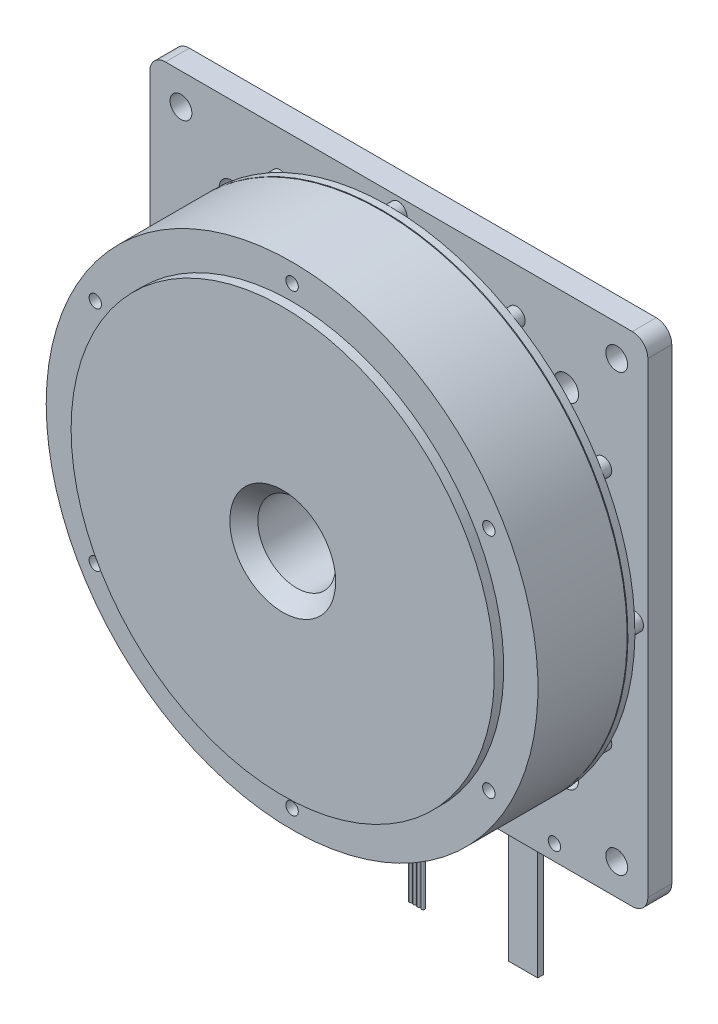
ISO-10303-21;
HEADER;
FILE_DESCRIPTION(('STEP AP214'),'2;1');
FILE_NAME('part.step','',(''),(''),'','','');
FILE_SCHEMA(('AUTOMOTIVE_DESIGN { 1 0 10303 214 1 1 1 1 }'));
ENDSEC;
DATA;
#1=APPLICATION_CONTEXT('core data for automotive mechanical design processes');
#2=APPLICATION_PROTOCOL_DEFINITION('international standard','automotive_design',2000,#1);
#3=PRODUCT_CONTEXT('',#1,'mechanical');
#4=PRODUCT('Part','Part','',(#3));
#5=PRODUCT_RELATED_PRODUCT_CATEGORY('part','',(#4));
#6=PRODUCT_DEFINITION_FORMATION('','',#4);
#7=PRODUCT_DEFINITION_CONTEXT('part definition',#1,'design');
#8=PRODUCT_DEFINITION('design','',#6,#7);
#9=PRODUCT_DEFINITION_SHAPE('','',#8);
#10=(LENGTH_UNIT() NAMED_UNIT(*) SI_UNIT(.MILLI.,.METRE.));
#11=(NAMED_UNIT(*) PLANE_ANGLE_UNIT() SI_UNIT($,.RADIAN.));
#12=(NAMED_UNIT(*) SI_UNIT($,.STERADIAN.) SOLID_ANGLE_UNIT());
#13=UNCERTAINTY_MEASURE_WITH_UNIT(LENGTH_MEASURE(1.E-05),#10,'distance_accuracy_value','');
#14=(GEOMETRIC_REPRESENTATION_CONTEXT(3) GLOBAL_UNCERTAINTY_ASSIGNED_CONTEXT((#13)) GLOBAL_UNIT_ASSIGNED_CONTEXT((#10,
#11,#12)) REPRESENTATION_CONTEXT('',''));
#15=CARTESIAN_POINT('',(0.,0.,0.));
#16=DIRECTION('',(0.,0.,1.));
#17=DIRECTION('',(1.,0.,0.));
#18=AXIS2_PLACEMENT_3D('',#15,#16,#17);
#19=CARTESIAN_POINT('',(-62.016281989,39.018648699,7.85));
#20=DIRECTION('',(0.,0.,-1.));
#21=DIRECTION('',(-0.499999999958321,-0.866025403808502,0.));
#22=AXIS2_PLACEMENT_3D('',#19,#20,#21);
#23=PLANE('',#22);
#24=CARTESIAN_POINT('',(-65.817930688,38.,7.85));
#25=DIRECTION('',(0.,0.,1.));
#26=DIRECTION('',(1.,0.,0.));
#27=AXIS2_PLACEMENT_3D('',#24,#25,#26);
#28=CIRCLE('',#27,2.75);
#29=CARTESIAN_POINT('',(-63.067930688,38.,7.85));
#30=VERTEX_POINT('',#29);
#31=EDGE_CURVE('E20',#30,#30,#28,.F.);
#32=ORIENTED_EDGE('',*,*,#31,.T.);
#33=EDGE_LOOP('',(#32));
#34=FACE_BOUND('',#33,.T.);
#35=ADVANCED_FACE('F16',(#34),#23,.T.);
#36=CARTESIAN_POINT('',(-64.799281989,-34.198351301,7.85));
#37=DIRECTION('',(0.,0.,-1.));
#38=DIRECTION('',(0.499999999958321,-0.866025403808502,0.));
#39=AXIS2_PLACEMENT_3D('',#36,#37,#38);
#40=PLANE('',#39);
#41=CARTESIAN_POINT('',(-65.817930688,-38.,7.85));
#42=DIRECTION('',(0.,0.,1.));
#43=DIRECTION('',(1.,0.,0.));
#44=AXIS2_PLACEMENT_3D('',#41,#42,#43);
#45=CIRCLE('',#44,2.75);
#46=CARTESIAN_POINT('',(-63.067930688,-38.,7.85));
#47=VERTEX_POINT('',#46);
#48=EDGE_CURVE('E297',#47,#47,#45,.F.);
#49=ORIENTED_EDGE('',*,*,#48,.T.);
#50=EDGE_LOOP('',(#49));
#51=FACE_BOUND('',#50,.T.);
#52=ADVANCED_FACE('F1083',(#51),#40,.T.);
#53=CARTESIAN_POINT('',(-2.783,-73.217,7.85));
#54=DIRECTION('',(0.,0.,-1.));
#55=DIRECTION('',(1.,0.,0.));
#56=AXIS2_PLACEMENT_3D('',#53,#54,#55);
#57=PLANE('',#56);
#58=CARTESIAN_POINT('',(0.,-76.,7.85));
#59=DIRECTION('',(0.,0.,1.));
#60=DIRECTION('',(1.,0.,0.));
#61=AXIS2_PLACEMENT_3D('',#58,#59,#60);
#62=CIRCLE('',#61,2.75);
#63=CARTESIAN_POINT('',(2.75,-76.,7.85));
#64=VERTEX_POINT('',#63);
#65=EDGE_CURVE('E295',#64,#64,#62,.F.);
#66=ORIENTED_EDGE('',*,*,#65,.T.);
#67=EDGE_LOOP('',(#66));
#68=FACE_BOUND('',#67,.T.);
#69=ADVANCED_FACE('F1080',(#68),#57,.T.);
#70=CARTESIAN_POINT('',(62.016281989,-39.018648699,7.85));
#71=DIRECTION('',(0.,0.,-1.));
#72=DIRECTION('',(0.499999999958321,0.866025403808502,0.));
#73=AXIS2_PLACEMENT_3D('',#70,#71,#72);
#74=PLANE('',#73);
#75=CARTESIAN_POINT('',(65.817930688,-38.,7.85));
#76=DIRECTION('',(0.,0.,1.));
#77=DIRECTION('',(1.,0.,0.));
#78=AXIS2_PLACEMENT_3D('',#75,#76,#77);
#79=CIRCLE('',#78,2.75);
#80=CARTESIAN_POINT('',(68.567930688,-38.,7.85));
#81=VERTEX_POINT('',#80);
#82=EDGE_CURVE('E292',#81,#81,#79,.F.);
#83=ORIENTED_EDGE('',*,*,#82,.T.);
#84=EDGE_LOOP('',(#83));
#85=FACE_BOUND('',#84,.T.);
#86=ADVANCED_FACE('F1082',(#85),#74,.T.);
#87=CARTESIAN_POINT('',(64.799281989,34.198351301,7.85));
#88=DIRECTION('',(0.,0.,-1.));
#89=DIRECTION('',(-0.499999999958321,0.866025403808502,0.));
#90=AXIS2_PLACEMENT_3D('',#87,#88,#89);
#91=PLANE('',#90);
#92=CARTESIAN_POINT('',(65.817930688,38.,7.85));
#93=DIRECTION('',(0.,0.,1.));
#94=DIRECTION('',(1.,0.,0.));
#95=AXIS2_PLACEMENT_3D('',#92,#93,#94);
#96=CIRCLE('',#95,2.75);
#97=CARTESIAN_POINT('',(68.567930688,38.,7.85));
#98=VERTEX_POINT('',#97);
#99=EDGE_CURVE('E289',#98,#98,#96,.F.);
#100=ORIENTED_EDGE('',*,*,#99,.T.);
#101=EDGE_LOOP('',(#100));
#102=FACE_BOUND('',#101,.T.);
#103=ADVANCED_FACE('F1089',(#102),#91,.T.);
#104=CARTESIAN_POINT('',(2.783,73.217,7.85));
#105=DIRECTION('',(0.,0.,-1.));
#106=DIRECTION('',(-1.,0.,0.));
#107=AXIS2_PLACEMENT_3D('',#104,#105,#106);
#108=PLANE('',#107);
#109=CARTESIAN_POINT('',(0.,76.,7.85));
#110=DIRECTION('',(0.,0.,1.));
#111=DIRECTION('',(1.,0.,0.));
#112=AXIS2_PLACEMENT_3D('',#109,#110,#111);
#113=CIRCLE('',#112,2.75);
#114=CARTESIAN_POINT('',(2.75,76.,7.85));
#115=VERTEX_POINT('',#114);
#116=EDGE_CURVE('E286',#115,#115,#113,.F.);
#117=ORIENTED_EDGE('',*,*,#116,.T.);
#118=EDGE_LOOP('',(#117));
#119=FACE_BOUND('',#118,.T.);
#120=ADVANCED_FACE('F1097',(#119),#108,.T.);
#121=CARTESIAN_POINT('',(39.018648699,62.016281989,7.85));
#122=DIRECTION('',(0.,0.,-1.));
#123=DIRECTION('',(-0.866025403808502,0.499999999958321,0.));
#124=AXIS2_PLACEMENT_3D('',#121,#122,#123);
#125=PLANE('',#124);
#126=CARTESIAN_POINT('',(38.,65.817930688,7.85));
#127=DIRECTION('',(0.,0.,1.));
#128=DIRECTION('',(1.,0.,0.));
#129=AXIS2_PLACEMENT_3D('',#126,#127,#128);
#130=CIRCLE('',#129,2.75);
#131=CARTESIAN_POINT('',(40.75,65.817930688,7.85));
#132=VERTEX_POINT('',#131);
#133=EDGE_CURVE('E283',#132,#132,#130,.F.);
#134=ORIENTED_EDGE('',*,*,#133,.T.);
#135=EDGE_LOOP('',(#134));
#136=FACE_BOUND('',#135,.T.);
#137=ADVANCED_FACE('F1101',(#136),#125,.T.);
#138=CARTESIAN_POINT('',(73.217,-2.783,7.85));
#139=DIRECTION('',(0.,0.,-1.));
#140=DIRECTION('',(0.,1.,0.));
#141=AXIS2_PLACEMENT_3D('',#138,#139,#140);
#142=PLANE('',#141);
#143=CARTESIAN_POINT('',(76.,0.,7.85));
#144=DIRECTION('',(0.,0.,1.));
#145=DIRECTION('',(1.,0.,0.));
#146=AXIS2_PLACEMENT_3D('',#143,#144,#145);
#147=CIRCLE('',#146,2.75);
#148=CARTESIAN_POINT('',(78.75,0.,7.85));
#149=VERTEX_POINT('',#148);
#150=EDGE_CURVE('E280',#149,#149,#147,.F.);
#151=ORIENTED_EDGE('',*,*,#150,.T.);
#152=EDGE_LOOP('',(#151));
#153=FACE_BOUND('',#152,.T.);
#154=ADVANCED_FACE('F1105',(#153),#142,.T.);
#155=CARTESIAN_POINT('',(34.198351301,-64.799281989,7.85));
#156=DIRECTION('',(0.,0.,-1.));
#157=DIRECTION('',(0.866025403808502,0.499999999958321,0.));
#158=AXIS2_PLACEMENT_3D('',#155,#156,#157);
#159=PLANE('',#158);
#160=CARTESIAN_POINT('',(38.,-65.817930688,7.85));
#161=DIRECTION('',(0.,0.,1.));
#162=DIRECTION('',(1.,0.,0.));
#163=AXIS2_PLACEMENT_3D('',#160,#161,#162);
#164=CIRCLE('',#163,2.75);
#165=CARTESIAN_POINT('',(40.75,-65.817930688,7.85));
#166=VERTEX_POINT('',#165);
#167=EDGE_CURVE('E277',#166,#166,#164,.F.);
#168=ORIENTED_EDGE('',*,*,#167,.T.);
#169=EDGE_LOOP('',(#168));
#170=FACE_BOUND('',#169,.T.);
#171=ADVANCED_FACE('F1109',(#170),#159,.T.);
#172=CARTESIAN_POINT('',(-39.018648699,-62.016281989,7.85));
#173=DIRECTION('',(0.,0.,-1.));
#174=DIRECTION('',(0.866025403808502,-0.499999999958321,0.));
#175=AXIS2_PLACEMENT_3D('',#172,#173,#174);
#176=PLANE('',#175);
#177=CARTESIAN_POINT('',(-38.,-65.817930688,7.85));
#178=DIRECTION('',(0.,0.,1.));
#179=DIRECTION('',(1.,0.,0.));
#180=AXIS2_PLACEMENT_3D('',#177,#178,#179);
#181=CIRCLE('',#180,2.75);
#182=CARTESIAN_POINT('',(-35.25,-65.817930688,7.85));
#183=VERTEX_POINT('',#182);
#184=EDGE_CURVE('E274',#183,#183,#181,.F.);
#185=ORIENTED_EDGE('',*,*,#184,.T.);
#186=EDGE_LOOP('',(#185));
#187=FACE_BOUND('',#186,.T.);
#188=ADVANCED_FACE('F1113',(#187),#176,.T.);
#189=CARTESIAN_POINT('',(-73.217,2.783,7.85));
#190=DIRECTION('',(0.,0.,-1.));
#191=DIRECTION('',(0.,-1.,0.));
#192=AXIS2_PLACEMENT_3D('',#189,#190,#191);
#193=PLANE('',#192);
#194=CARTESIAN_POINT('',(-76.,0.,7.85));
#195=DIRECTION('',(0.,0.,1.));
#196=DIRECTION('',(1.,0.,0.));
#197=AXIS2_PLACEMENT_3D('',#194,#195,#196);
#198=CIRCLE('',#197,2.75);
#199=CARTESIAN_POINT('',(-73.25,0.,7.85));
#200=VERTEX_POINT('',#199);
#201=EDGE_CURVE('E271',#200,#200,#198,.F.);
#202=ORIENTED_EDGE('',*,*,#201,.T.);
#203=EDGE_LOOP('',(#202));
#204=FACE_BOUND('',#203,.T.);
#205=ADVANCED_FACE('F1117',(#204),#193,.T.);
#206=CARTESIAN_POINT('',(-34.198351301,64.799281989,7.85));
#207=DIRECTION('',(0.,0.,-1.));
#208=DIRECTION('',(-0.866025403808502,-0.499999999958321,0.));
#209=AXIS2_PLACEMENT_3D('',#206,#207,#208);
#210=PLANE('',#209);
#211=CARTESIAN_POINT('',(-38.,65.817930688,7.85));
#212=DIRECTION('',(0.,0.,1.));
#213=DIRECTION('',(1.,0.,0.));
#214=AXIS2_PLACEMENT_3D('',#211,#212,#213);
#215=CIRCLE('',#214,2.75);
#216=CARTESIAN_POINT('',(-35.25,65.817930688,7.85));
#217=VERTEX_POINT('',#216);
#218=EDGE_CURVE('E268',#217,#217,#215,.F.);
#219=ORIENTED_EDGE('',*,*,#218,.T.);
#220=EDGE_LOOP('',(#219));
#221=FACE_BOUND('',#220,.T.);
#222=ADVANCED_FACE('F1121',(#221),#210,.T.);
#223=CARTESIAN_POINT('',(0.0934,-120.,2.3816));
#224=DIRECTION('',(0.,-1.,0.));
#225=DIRECTION('',(0.,0.,-1.));
#226=AXIS2_PLACEMENT_3D('',#223,#224,#225);
#227=PLANE('',#226);
#228=CARTESIAN_POINT('',(0.65,-120.,1.825));
#229=DIRECTION('',(0.,1.,0.));
#230=DIRECTION('',(-1.,0.,0.));
#231=AXIS2_PLACEMENT_3D('',#228,#229,#230);
#232=CIRCLE('',#231,0.549999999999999);
#233=CARTESIAN_POINT('',(0.100000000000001,-120.,1.825));
#234=VERTEX_POINT('',#233);
#235=EDGE_CURVE('E262',#234,#234,#232,.F.);
#236=ORIENTED_EDGE('',*,*,#235,.T.);
#237=EDGE_LOOP('',(#236));
#238=FACE_BOUND('',#237,.T.);
#239=ADVANCED_FACE('F1125',(#238),#227,.T.);
#240=CARTESIAN_POINT('',(-2.5066,-120.,2.3816));
#241=DIRECTION('',(0.,-1.,0.));
#242=DIRECTION('',(0.,0.,-1.));
#243=AXIS2_PLACEMENT_3D('',#240,#241,#242);
#244=PLANE('',#243);
#245=CARTESIAN_POINT('',(-1.95,-120.,1.825));
#246=DIRECTION('',(0.,1.,0.));
#247=DIRECTION('',(-1.,0.,0.));
#248=AXIS2_PLACEMENT_3D('',#245,#246,#247);
#249=CIRCLE('',#248,0.549999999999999);
#250=CARTESIAN_POINT('',(-2.5,-120.,1.825));
#251=VERTEX_POINT('',#250);
#252=EDGE_CURVE('E259',#251,#251,#249,.F.);
#253=ORIENTED_EDGE('',*,*,#252,.T.);
#254=EDGE_LOOP('',(#253));
#255=FACE_BOUND('',#254,.T.);
#256=ADVANCED_FACE('F1129',(#255),#244,.T.);
#257=CARTESIAN_POINT('',(-1.2066,-120.,2.3816));
#258=DIRECTION('',(0.,-1.,0.));
#259=DIRECTION('',(0.,0.,-1.));
#260=AXIS2_PLACEMENT_3D('',#257,#258,#259);
#261=PLANE('',#260);
#262=CARTESIAN_POINT('',(-0.65,-120.,1.825));
#263=DIRECTION('',(0.,1.,0.));
#264=DIRECTION('',(-1.,0.,0.));
#265=AXIS2_PLACEMENT_3D('',#262,#263,#264);
#266=CIRCLE('',#265,0.549999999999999);
#267=CARTESIAN_POINT('',(-1.2,-120.,1.825));
#268=VERTEX_POINT('',#267);
#269=EDGE_CURVE('E256',#268,#268,#266,.F.);
#270=ORIENTED_EDGE('',*,*,#269,.T.);
#271=EDGE_LOOP('',(#270));
#272=FACE_BOUND('',#271,.T.);
#273=ADVANCED_FACE('F1133',(#272),#261,.T.);
#274=CARTESIAN_POINT('',(1.3934,-120.,2.3816));
#275=DIRECTION('',(0.,-1.,0.));
#276=DIRECTION('',(0.,0.,-1.));
#277=AXIS2_PLACEMENT_3D('',#274,#275,#276);
#278=PLANE('',#277);
#279=CARTESIAN_POINT('',(1.95,-120.,1.825));
#280=DIRECTION('',(0.,1.,0.));
#281=DIRECTION('',(-1.,0.,0.));
#282=AXIS2_PLACEMENT_3D('',#279,#280,#281);
#283=CIRCLE('',#282,0.549999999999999);
#284=CARTESIAN_POINT('',(1.4,-120.,1.825));
#285=VERTEX_POINT('',#284);
#286=EDGE_CURVE('E253',#285,#285,#283,.F.);
#287=ORIENTED_EDGE('',*,*,#286,.T.);
#288=EDGE_LOOP('',(#287));
#289=FACE_BOUND('',#288,.T.);
#290=ADVANCED_FACE('F319',(#289),#278,.T.);
#291=CARTESIAN_POINT('',(0.,0.,13.1));
#292=DIRECTION('',(0.,0.,-1.));
#293=DIRECTION('',(0.,1.,0.));
#294=AXIS2_PLACEMENT_3D('',#291,#292,#293);
#295=CYLINDRICAL_SURFACE('',#294,79.);
#296=CARTESIAN_POINT('',(0.,0.,13.1));
#297=DIRECTION('',(0.,0.,-1.));
#298=DIRECTION('',(0.,1.,0.));
#299=AXIS2_PLACEMENT_3D('',#296,#297,#298);
#300=CIRCLE('',#299,79.);
#301=CARTESIAN_POINT('',(0.,79.,13.1));
#302=VERTEX_POINT('',#301);
#303=EDGE_CURVE('E265',#302,#302,#300,.T.);
#304=ORIENTED_EDGE('',*,*,#303,.T.);
#305=EDGE_LOOP('',(#304));
#306=FACE_BOUND('',#305,.T.);
#307=CARTESIAN_POINT('',(0.,0.,10.85));
#308=DIRECTION('',(0.,0.,-1.));
#309=DIRECTION('',(0.,1.,0.));
#310=AXIS2_PLACEMENT_3D('',#307,#308,#309);
#311=CIRCLE('',#310,79.);
#312=CARTESIAN_POINT('',(0.,79.,10.85));
#313=VERTEX_POINT('',#312);
#314=EDGE_CURVE('E250',#313,#313,#311,.T.);
#315=ORIENTED_EDGE('',*,*,#314,.F.);
#316=EDGE_LOOP('',(#315));
#317=FACE_BOUND('',#316,.T.);
#318=ADVANCED_FACE('F308',(#306,#317),#295,.T.);
#319=CARTESIAN_POINT('',(-65.817930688,38.,7.85));
#320=DIRECTION('',(0.,0.,1.));
#321=DIRECTION('',(1.,0.,0.));
#322=AXIS2_PLACEMENT_3D('',#319,#320,#321);
#323=CYLINDRICAL_SURFACE('',#322,2.75);
#324=CARTESIAN_POINT('',(-65.817930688,38.,10.85));
#325=DIRECTION('',(0.,0.,1.));
#326=DIRECTION('',(1.,0.,0.));
#327=AXIS2_PLACEMENT_3D('',#324,#325,#326);
#328=CIRCLE('',#327,2.75);
#329=CARTESIAN_POINT('',(-63.067930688,38.,10.85));
#330=VERTEX_POINT('',#329);
#331=EDGE_CURVE('E247',#330,#330,#328,.T.);
#332=ORIENTED_EDGE('',*,*,#331,.F.);
#333=EDGE_LOOP('',(#332));
#334=FACE_BOUND('',#333,.T.);
#335=ORIENTED_EDGE('',*,*,#31,.F.);
#336=EDGE_LOOP('',(#335));
#337=FACE_BOUND('',#336,.T.);
#338=ADVANCED_FACE('F305',(#334,#337),#323,.T.);
#339=CARTESIAN_POINT('',(-65.817930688,-38.,7.85));
#340=DIRECTION('',(0.,0.,1.));
#341=DIRECTION('',(1.,0.,0.));
#342=AXIS2_PLACEMENT_3D('',#339,#340,#341);
#343=CYLINDRICAL_SURFACE('',#342,2.75);
#344=CARTESIAN_POINT('',(-65.817930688,-38.,10.85));
#345=DIRECTION('',(0.,0.,1.));
#346=DIRECTION('',(1.,0.,0.));
#347=AXIS2_PLACEMENT_3D('',#344,#345,#346);
#348=CIRCLE('',#347,2.75);
#349=CARTESIAN_POINT('',(-63.067930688,-38.,10.85));
#350=VERTEX_POINT('',#349);
#351=EDGE_CURVE('E244',#350,#350,#348,.T.);
#352=ORIENTED_EDGE('',*,*,#351,.F.);
#353=EDGE_LOOP('',(#352));
#354=FACE_BOUND('',#353,.T.);
#355=ORIENTED_EDGE('',*,*,#48,.F.);
#356=EDGE_LOOP('',(#355));
#357=FACE_BOUND('',#356,.T.);
#358=ADVANCED_FACE('F307',(#354,#357),#343,.T.);
#359=CARTESIAN_POINT('',(0.,-76.,7.85));
#360=DIRECTION('',(0.,0.,1.));
#361=DIRECTION('',(1.,0.,0.));
#362=AXIS2_PLACEMENT_3D('',#359,#360,#361);
#363=CYLINDRICAL_SURFACE('',#362,2.75);
#364=CARTESIAN_POINT('',(0.,-76.,10.85));
#365=DIRECTION('',(0.,0.,1.));
#366=DIRECTION('',(1.,0.,0.));
#367=AXIS2_PLACEMENT_3D('',#364,#365,#366);
#368=CIRCLE('',#367,2.75);
#369=CARTESIAN_POINT('',(2.75,-76.,10.85));
#370=VERTEX_POINT('',#369);
#371=EDGE_CURVE('E241',#370,#370,#368,.T.);
#372=ORIENTED_EDGE('',*,*,#371,.F.);
#373=EDGE_LOOP('',(#372));
#374=FACE_BOUND('',#373,.T.);
#375=ORIENTED_EDGE('',*,*,#65,.F.);
#376=EDGE_LOOP('',(#375));
#377=FACE_BOUND('',#376,.T.);
#378=ADVANCED_FACE('F316',(#374,#377),#363,.T.);
#379=CARTESIAN_POINT('',(65.817930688,-38.,7.85));
#380=DIRECTION('',(0.,0.,1.));
#381=DIRECTION('',(1.,0.,0.));
#382=AXIS2_PLACEMENT_3D('',#379,#380,#381);
#383=CYLINDRICAL_SURFACE('',#382,2.75);
#384=CARTESIAN_POINT('',(65.817930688,-38.,10.85));
#385=DIRECTION('',(0.,0.,1.));
#386=DIRECTION('',(1.,0.,0.));
#387=AXIS2_PLACEMENT_3D('',#384,#385,#386);
#388=CIRCLE('',#387,2.75);
#389=CARTESIAN_POINT('',(68.567930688,-38.,10.85));
#390=VERTEX_POINT('',#389);
#391=EDGE_CURVE('E238',#390,#390,#388,.T.);
#392=ORIENTED_EDGE('',*,*,#391,.F.);
#393=EDGE_LOOP('',(#392));
#394=FACE_BOUND('',#393,.T.);
#395=ORIENTED_EDGE('',*,*,#82,.F.);
#396=EDGE_LOOP('',(#395));
#397=FACE_BOUND('',#396,.T.);
#398=ADVANCED_FACE('F1076',(#394,#397),#383,.T.);
#399=CARTESIAN_POINT('',(65.817930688,38.,7.85));
#400=DIRECTION('',(0.,0.,1.));
#401=DIRECTION('',(1.,0.,0.));
#402=AXIS2_PLACEMENT_3D('',#399,#400,#401);
#403=CYLINDRICAL_SURFACE('',#402,2.75);
#404=CARTESIAN_POINT('',(65.817930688,38.,10.85));
#405=DIRECTION('',(0.,0.,1.));
#406=DIRECTION('',(1.,0.,0.));
#407=AXIS2_PLACEMENT_3D('',#404,#405,#406);
#408=CIRCLE('',#407,2.75);
#409=CARTESIAN_POINT('',(68.567930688,38.,10.85));
#410=VERTEX_POINT('',#409);
#411=EDGE_CURVE('E235',#410,#410,#408,.T.);
#412=ORIENTED_EDGE('',*,*,#411,.F.);
#413=EDGE_LOOP('',(#412));
#414=FACE_BOUND('',#413,.T.);
#415=ORIENTED_EDGE('',*,*,#99,.F.);
#416=EDGE_LOOP('',(#415));
#417=FACE_BOUND('',#416,.T.);
#418=ADVANCED_FACE('F1598',(#414,#417),#403,.T.);
#419=CARTESIAN_POINT('',(0.,76.,7.85));
#420=DIRECTION('',(0.,0.,1.));
#421=DIRECTION('',(1.,0.,0.));
#422=AXIS2_PLACEMENT_3D('',#419,#420,#421);
#423=CYLINDRICAL_SURFACE('',#422,2.75);
#424=CARTESIAN_POINT('',(0.,76.,10.85));
#425=DIRECTION('',(0.,0.,1.));
#426=DIRECTION('',(1.,0.,0.));
#427=AXIS2_PLACEMENT_3D('',#424,#425,#426);
#428=CIRCLE('',#427,2.75);
#429=CARTESIAN_POINT('',(2.75,76.,10.85));
#430=VERTEX_POINT('',#429);
#431=EDGE_CURVE('E232',#430,#430,#428,.T.);
#432=ORIENTED_EDGE('',*,*,#431,.F.);
#433=EDGE_LOOP('',(#432));
#434=FACE_BOUND('',#433,.T.);
#435=ORIENTED_EDGE('',*,*,#116,.F.);
#436=EDGE_LOOP('',(#435));
#437=FACE_BOUND('',#436,.T.);
#438=ADVANCED_FACE('F1590',(#434,#437),#423,.T.);
#439=CARTESIAN_POINT('',(38.,65.817930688,7.85));
#440=DIRECTION('',(0.,0.,1.));
#441=DIRECTION('',(1.,0.,0.));
#442=AXIS2_PLACEMENT_3D('',#439,#440,#441);
#443=CYLINDRICAL_SURFACE('',#442,2.75);
#444=CARTESIAN_POINT('',(38.,65.817930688,10.85));
#445=DIRECTION('',(0.,0.,1.));
#446=DIRECTION('',(1.,0.,0.));
#447=AXIS2_PLACEMENT_3D('',#444,#445,#446);
#448=CIRCLE('',#447,2.75);
#449=CARTESIAN_POINT('',(40.75,65.817930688,10.85));
#450=VERTEX_POINT('',#449);
#451=EDGE_CURVE('E229',#450,#450,#448,.T.);
#452=ORIENTED_EDGE('',*,*,#451,.F.);
#453=EDGE_LOOP('',(#452));
#454=FACE_BOUND('',#453,.T.);
#455=ORIENTED_EDGE('',*,*,#133,.F.);
#456=EDGE_LOOP('',(#455));
#457=FACE_BOUND('',#456,.T.);
#458=ADVANCED_FACE('F1582',(#454,#457),#443,.T.);
#459=CARTESIAN_POINT('',(76.,0.,7.85));
#460=DIRECTION('',(0.,0.,1.));
#461=DIRECTION('',(1.,0.,0.));
#462=AXIS2_PLACEMENT_3D('',#459,#460,#461);
#463=CYLINDRICAL_SURFACE('',#462,2.75);
#464=CARTESIAN_POINT('',(76.,0.,10.85));
#465=DIRECTION('',(0.,0.,1.));
#466=DIRECTION('',(1.,0.,0.));
#467=AXIS2_PLACEMENT_3D('',#464,#465,#466);
#468=CIRCLE('',#467,2.75);
#469=CARTESIAN_POINT('',(78.75,0.,10.85));
#470=VERTEX_POINT('',#469);
#471=EDGE_CURVE('E226',#470,#470,#468,.T.);
#472=ORIENTED_EDGE('',*,*,#471,.F.);
#473=EDGE_LOOP('',(#472));
#474=FACE_BOUND('',#473,.T.);
#475=ORIENTED_EDGE('',*,*,#150,.F.);
#476=EDGE_LOOP('',(#475));
#477=FACE_BOUND('',#476,.T.);
#478=ADVANCED_FACE('F1574',(#474,#477),#463,.T.);
#479=CARTESIAN_POINT('',(38.,-65.817930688,7.85));
#480=DIRECTION('',(0.,0.,1.));
#481=DIRECTION('',(1.,0.,0.));
#482=AXIS2_PLACEMENT_3D('',#479,#480,#481);
#483=CYLINDRICAL_SURFACE('',#482,2.75);
#484=CARTESIAN_POINT('',(38.,-65.817930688,10.85));
#485=DIRECTION('',(0.,0.,1.));
#486=DIRECTION('',(1.,0.,0.));
#487=AXIS2_PLACEMENT_3D('',#484,#485,#486);
#488=CIRCLE('',#487,2.75);
#489=CARTESIAN_POINT('',(40.75,-65.817930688,10.85));
#490=VERTEX_POINT('',#489);
#491=EDGE_CURVE('E223',#490,#490,#488,.T.);
#492=ORIENTED_EDGE('',*,*,#491,.F.);
#493=EDGE_LOOP('',(#492));
#494=FACE_BOUND('',#493,.T.);
#495=ORIENTED_EDGE('',*,*,#167,.F.);
#496=EDGE_LOOP('',(#495));
#497=FACE_BOUND('',#496,.T.);
#498=ADVANCED_FACE('F1566',(#494,#497),#483,.T.);
#499=CARTESIAN_POINT('',(-38.,-65.817930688,7.85));
#500=DIRECTION('',(0.,0.,1.));
#501=DIRECTION('',(1.,0.,0.));
#502=AXIS2_PLACEMENT_3D('',#499,#500,#501);
#503=CYLINDRICAL_SURFACE('',#502,2.75);
#504=CARTESIAN_POINT('',(-38.,-65.817930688,10.85));
#505=DIRECTION('',(0.,0.,1.));
#506=DIRECTION('',(1.,0.,0.));
#507=AXIS2_PLACEMENT_3D('',#504,#505,#506);
#508=CIRCLE('',#507,2.75);
#509=CARTESIAN_POINT('',(-35.25,-65.817930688,10.85));
#510=VERTEX_POINT('',#509);
#511=EDGE_CURVE('E220',#510,#510,#508,.T.);
#512=ORIENTED_EDGE('',*,*,#511,.F.);
#513=EDGE_LOOP('',(#512));
#514=FACE_BOUND('',#513,.T.);
#515=ORIENTED_EDGE('',*,*,#184,.F.);
#516=EDGE_LOOP('',(#515));
#517=FACE_BOUND('',#516,.T.);
#518=ADVANCED_FACE('F1558',(#514,#517),#503,.T.);
#519=CARTESIAN_POINT('',(-76.,0.,7.85));
#520=DIRECTION('',(0.,0.,1.));
#521=DIRECTION('',(1.,0.,0.));
#522=AXIS2_PLACEMENT_3D('',#519,#520,#521);
#523=CYLINDRICAL_SURFACE('',#522,2.75);
#524=CARTESIAN_POINT('',(-76.,0.,10.85));
#525=DIRECTION('',(0.,0.,1.));
#526=DIRECTION('',(1.,0.,0.));
#527=AXIS2_PLACEMENT_3D('',#524,#525,#526);
#528=CIRCLE('',#527,2.75);
#529=CARTESIAN_POINT('',(-73.25,0.,10.85));
#530=VERTEX_POINT('',#529);
#531=EDGE_CURVE('E217',#530,#530,#528,.T.);
#532=ORIENTED_EDGE('',*,*,#531,.F.);
#533=EDGE_LOOP('',(#532));
#534=FACE_BOUND('',#533,.T.);
#535=ORIENTED_EDGE('',*,*,#201,.F.);
#536=EDGE_LOOP('',(#535));
#537=FACE_BOUND('',#536,.T.);
#538=ADVANCED_FACE('F1550',(#534,#537),#523,.T.);
#539=CARTESIAN_POINT('',(-38.,65.817930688,7.85));
#540=DIRECTION('',(0.,0.,1.));
#541=DIRECTION('',(1.,0.,0.));
#542=AXIS2_PLACEMENT_3D('',#539,#540,#541);
#543=CYLINDRICAL_SURFACE('',#542,2.75);
#544=CARTESIAN_POINT('',(-38.,65.817930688,10.85));
#545=DIRECTION('',(0.,0.,1.));
#546=DIRECTION('',(1.,0.,0.));
#547=AXIS2_PLACEMENT_3D('',#544,#545,#546);
#548=CIRCLE('',#547,2.75);
#549=CARTESIAN_POINT('',(-35.25,65.817930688,10.85));
#550=VERTEX_POINT('',#549);
#551=EDGE_CURVE('E214',#550,#550,#548,.T.);
#552=ORIENTED_EDGE('',*,*,#551,.F.);
#553=EDGE_LOOP('',(#552));
#554=FACE_BOUND('',#553,.T.);
#555=ORIENTED_EDGE('',*,*,#218,.F.);
#556=EDGE_LOOP('',(#555));
#557=FACE_BOUND('',#556,.T.);
#558=ADVANCED_FACE('F1144',(#554,#557),#543,.T.);
#559=CARTESIAN_POINT('',(79.948,-79.948,13.1));
#560=DIRECTION('',(0.,0.,-1.));
#561=DIRECTION('',(-1.,0.,0.));
#562=AXIS2_PLACEMENT_3D('',#559,#560,#561);
#563=PLANE('',#562);
#564=CARTESIAN_POINT('',(0.,0.,13.1));
#565=DIRECTION('',(0.,0.,-1.));
#566=DIRECTION('',(-1.,0.,0.));
#567=AXIS2_PLACEMENT_3D('',#564,#565,#566);
#568=CIRCLE('',#567,78.);
#569=CARTESIAN_POINT('',(-78.,0.,13.1));
#570=VERTEX_POINT('',#569);
#571=EDGE_CURVE('E211',#570,#570,#568,.T.);
#572=ORIENTED_EDGE('',*,*,#571,.T.);
#573=EDGE_LOOP('',(#572));
#574=FACE_BOUND('',#573,.T.);
#575=ORIENTED_EDGE('',*,*,#303,.F.);
#576=EDGE_LOOP('',(#575));
#577=FACE_BOUND('',#576,.T.);
#578=ADVANCED_FACE('F1141',(#574,#577),#563,.F.);
#579=CARTESIAN_POINT('',(0.65,-120.,1.825));
#580=DIRECTION('',(0.,1.,0.));
#581=DIRECTION('',(-1.,0.,0.));
#582=AXIS2_PLACEMENT_3D('',#579,#580,#581);
#583=CYLINDRICAL_SURFACE('',#582,0.549999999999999);
#584=CARTESIAN_POINT('',(0.649999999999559,-85.,1.825));
#585=DIRECTION('',(0.,1.,0.));
#586=DIRECTION('',(-1.,0.,0.));
#587=AXIS2_PLACEMENT_3D('',#584,#585,#586);
#588=CIRCLE('',#587,0.549999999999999);
#589=CARTESIAN_POINT('',(0.0999999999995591,-85.,1.825));
#590=VERTEX_POINT('',#589);
#591=EDGE_CURVE('E208',#590,#590,#588,.T.);
#592=ORIENTED_EDGE('',*,*,#591,.F.);
#593=EDGE_LOOP('',(#592));
#594=FACE_BOUND('',#593,.T.);
#595=ORIENTED_EDGE('',*,*,#235,.F.);
#596=EDGE_LOOP('',(#595));
#597=FACE_BOUND('',#596,.T.);
#598=ADVANCED_FACE('F1143',(#594,#597),#583,.T.);
#599=CARTESIAN_POINT('',(-1.95,-120.,1.825));
#600=DIRECTION('',(0.,1.,0.));
#601=DIRECTION('',(-1.,0.,0.));
#602=AXIS2_PLACEMENT_3D('',#599,#600,#601);
#603=CYLINDRICAL_SURFACE('',#602,0.549999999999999);
#604=CARTESIAN_POINT('',(-1.95000000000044,-85.,1.825));
#605=DIRECTION('',(0.,1.,0.));
#606=DIRECTION('',(-1.,0.,0.));
#607=AXIS2_PLACEMENT_3D('',#604,#605,#606);
#608=CIRCLE('',#607,0.549999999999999);
#609=CARTESIAN_POINT('',(-2.50000000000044,-85.,1.825));
#610=VERTEX_POINT('',#609);
#611=EDGE_CURVE('E205',#610,#610,#608,.T.);
#612=ORIENTED_EDGE('',*,*,#611,.F.);
#613=EDGE_LOOP('',(#612));
#614=FACE_BOUND('',#613,.T.);
#615=ORIENTED_EDGE('',*,*,#252,.F.);
#616=EDGE_LOOP('',(#615));
#617=FACE_BOUND('',#616,.T.);
#618=ADVANCED_FACE('F1524',(#614,#617),#603,.T.);
#619=CARTESIAN_POINT('',(-0.65,-120.,1.825));
#620=DIRECTION('',(0.,1.,0.));
#621=DIRECTION('',(-1.,0.,0.));
#622=AXIS2_PLACEMENT_3D('',#619,#620,#621);
#623=CYLINDRICAL_SURFACE('',#622,0.549999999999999);
#624=CARTESIAN_POINT('',(-0.650000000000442,-85.,1.825));
#625=DIRECTION('',(0.,1.,0.));
#626=DIRECTION('',(-1.,0.,0.));
#627=AXIS2_PLACEMENT_3D('',#624,#625,#626);
#628=CIRCLE('',#627,0.549999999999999);
#629=CARTESIAN_POINT('',(-1.20000000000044,-85.,1.825));
#630=VERTEX_POINT('',#629);
#631=EDGE_CURVE('E202',#630,#630,#628,.T.);
#632=ORIENTED_EDGE('',*,*,#631,.F.);
#633=EDGE_LOOP('',(#632));
#634=FACE_BOUND('',#633,.T.);
#635=ORIENTED_EDGE('',*,*,#269,.F.);
#636=EDGE_LOOP('',(#635));
#637=FACE_BOUND('',#636,.T.);
#638=ADVANCED_FACE('F1517',(#634,#637),#623,.T.);
#639=CARTESIAN_POINT('',(1.95,-120.,1.825));
#640=DIRECTION('',(0.,1.,0.));
#641=DIRECTION('',(-1.,0.,0.));
#642=AXIS2_PLACEMENT_3D('',#639,#640,#641);
#643=CYLINDRICAL_SURFACE('',#642,0.549999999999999);
#644=CARTESIAN_POINT('',(1.94999999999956,-85.,1.825));
#645=DIRECTION('',(0.,1.,0.));
#646=DIRECTION('',(-1.,0.,0.));
#647=AXIS2_PLACEMENT_3D('',#644,#645,#646);
#648=CIRCLE('',#647,0.549999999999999);
#649=CARTESIAN_POINT('',(1.39999999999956,-85.,1.825));
#650=VERTEX_POINT('',#649);
#651=EDGE_CURVE('E199',#650,#650,#648,.T.);
#652=ORIENTED_EDGE('',*,*,#651,.F.);
#653=EDGE_LOOP('',(#652));
#654=FACE_BOUND('',#653,.T.);
#655=ORIENTED_EDGE('',*,*,#286,.F.);
#656=EDGE_LOOP('',(#655));
#657=FACE_BOUND('',#656,.T.);
#658=ADVANCED_FACE('F1056',(#654,#657),#643,.T.);
#659=CARTESIAN_POINT('',(79.948,-79.948,10.85));
#660=DIRECTION('',(0.,0.,-1.));
#661=DIRECTION('',(-1.,0.,0.));
#662=AXIS2_PLACEMENT_3D('',#659,#660,#661);
#663=PLANE('',#662);
#664=ORIENTED_EDGE('',*,*,#551,.T.);
#665=EDGE_LOOP('',(#664));
#666=FACE_BOUND('',#665,.T.);
#667=ORIENTED_EDGE('',*,*,#531,.T.);
#668=EDGE_LOOP('',(#667));
#669=FACE_BOUND('',#668,.T.);
#670=ORIENTED_EDGE('',*,*,#511,.T.);
#671=EDGE_LOOP('',(#670));
#672=FACE_BOUND('',#671,.T.);
#673=ORIENTED_EDGE('',*,*,#491,.T.);
#674=EDGE_LOOP('',(#673));
#675=FACE_BOUND('',#674,.T.);
#676=ORIENTED_EDGE('',*,*,#471,.T.);
#677=EDGE_LOOP('',(#676));
#678=FACE_BOUND('',#677,.T.);
#679=ORIENTED_EDGE('',*,*,#451,.T.);
#680=EDGE_LOOP('',(#679));
#681=FACE_BOUND('',#680,.T.);
#682=CARTESIAN_POINT('',(0.,0.,10.85));
#683=DIRECTION('',(0.,0.,-1.));
#684=DIRECTION('',(-1.,0.,0.));
#685=AXIS2_PLACEMENT_3D('',#682,#683,#684);
#686=CIRCLE('',#685,72.5);
#687=CARTESIAN_POINT('',(-72.5,0.,10.85));
#688=VERTEX_POINT('',#687);
#689=EDGE_CURVE('E181',#688,#688,#686,.F.);
#690=ORIENTED_EDGE('',*,*,#689,.T.);
#691=EDGE_LOOP('',(#690));
#692=FACE_BOUND('',#691,.T.);
#693=ORIENTED_EDGE('',*,*,#431,.T.);
#694=EDGE_LOOP('',(#693));
#695=FACE_BOUND('',#694,.T.);
#696=ORIENTED_EDGE('',*,*,#411,.T.);
#697=EDGE_LOOP('',(#696));
#698=FACE_BOUND('',#697,.T.);
#699=ORIENTED_EDGE('',*,*,#391,.T.);
#700=EDGE_LOOP('',(#699));
#701=FACE_BOUND('',#700,.T.);
#702=ORIENTED_EDGE('',*,*,#371,.T.);
#703=EDGE_LOOP('',(#702));
#704=FACE_BOUND('',#703,.T.);
#705=ORIENTED_EDGE('',*,*,#351,.T.);
#706=EDGE_LOOP('',(#705));
#707=FACE_BOUND('',#706,.T.);
#708=ORIENTED_EDGE('',*,*,#331,.T.);
#709=EDGE_LOOP('',(#708));
#710=FACE_BOUND('',#709,.T.);
#711=ORIENTED_EDGE('',*,*,#314,.T.);
#712=EDGE_LOOP('',(#711));
#713=FACE_BOUND('',#712,.T.);
#714=ADVANCED_FACE('F1053',(#666,#669,#672,#675,#678,#681,#692,#695,#698,#701,#704,#707,#710,
#713),#663,.T.);
#715=CARTESIAN_POINT('',(0.,0.,35.1));
#716=DIRECTION('',(0.,0.,-1.));
#717=DIRECTION('',(0.,1.,0.));
#718=AXIS2_PLACEMENT_3D('',#715,#716,#717);
#719=CYLINDRICAL_SURFACE('',#718,79.1);
#720=DIRECTION('',(0.,0.,1.));
#721=VECTOR('',#720,1.);
#722=CARTESIAN_POINT('',(-70.409707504,36.04556962,25.1));
#723=LINE('',#722,#721);
#724=CARTESIAN_POINT('',(-70.409707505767,36.0455696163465,15.1));
#725=VERTEX_POINT('',#724);
#726=CARTESIAN_POINT('',(-70.4097075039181,36.0455696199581,35.1));
#727=VERTEX_POINT('',#726);
#728=EDGE_CURVE('E189',#725,#727,#723,.T.);
#729=ORIENTED_EDGE('',*,*,#728,.F.);
#730=CARTESIAN_POINT('',(0.,0.,15.1));
#731=DIRECTION('',(0.,0.,-1.));
#732=DIRECTION('',(0.,1.,0.));
#733=AXIS2_PLACEMENT_3D('',#730,#731,#732);
#734=CIRCLE('',#733,79.1);
#735=CARTESIAN_POINT('',(-79.0603830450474,2.50316455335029,15.1));
#736=VERTEX_POINT('',#735);
#737=EDGE_CURVE('E175',#736,#725,#734,.T.);
#738=ORIENTED_EDGE('',*,*,#737,.F.);
#739=DIRECTION('',(0.,0.,1.));
#740=VECTOR('',#739,1.);
#741=CARTESIAN_POINT('',(-79.060383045,2.503164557,25.1));
#742=LINE('',#741,#740);
#743=CARTESIAN_POINT('',(-79.0603830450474,2.50316455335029,35.1));
#744=VERTEX_POINT('',#743);
#745=EDGE_CURVE('E169',#736,#744,#742,.T.);
#746=ORIENTED_EDGE('',*,*,#745,.T.);
#747=CARTESIAN_POINT('',(0.,0.,35.1));
#748=DIRECTION('',(0.,0.,-1.));
#749=DIRECTION('',(0.,1.,0.));
#750=AXIS2_PLACEMENT_3D('',#747,#748,#749);
#751=CIRCLE('',#750,79.1);
#752=EDGE_CURVE('E172',#727,#744,#751,.F.);
#753=ORIENTED_EDGE('',*,*,#752,.F.);
#754=EDGE_LOOP('',(#729,#738,#746,#753));
#755=FACE_BOUND('',#754,.T.);
#756=ADVANCED_FACE('F171',(#755),#719,.T.);
#757=CARTESIAN_POINT('',(0.,0.,32.404469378));
#758=DIRECTION('',(0.,0.,-1.));
#759=DIRECTION('',(-1.,0.,0.));
#760=AXIS2_PLACEMENT_3D('',#757,#758,#759);
#761=CYLINDRICAL_SURFACE('',#760,79.1);
#762=CARTESIAN_POINT('',(-74.5879868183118,-26.3332911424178,15.1));
#763=CARTESIAN_POINT('',(-74.5767428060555,-26.3651396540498,15.1000005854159));
#764=CARTESIAN_POINT('',(-74.565482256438,-26.3969693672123,15.1012669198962));
#765=CARTESIAN_POINT('',(-74.542966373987,-26.4604856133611,15.106324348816));
#766=CARTESIAN_POINT('',(-74.5317110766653,-26.4921718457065,15.1101193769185));
#767=CARTESIAN_POINT('',(-74.4978417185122,-26.5873302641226,15.1253813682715));
#768=CARTESIAN_POINT('',(-74.4753491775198,-26.6502649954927,15.1407253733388));
#769=CARTESIAN_POINT('',(-74.4312386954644,-26.7732138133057,15.1814643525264));
#770=CARTESIAN_POINT('',(-74.4096217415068,-26.8332246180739,15.2068703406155));
#771=CARTESIAN_POINT('',(-74.3772842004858,-26.9226808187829,15.2536846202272));
#772=CARTESIAN_POINT('',(-74.3660384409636,-26.9537263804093,15.2717454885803));
#773=CARTESIAN_POINT('',(-74.3440838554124,-27.0142226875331,15.3106426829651));
#774=CARTESIAN_POINT('',(-74.3333748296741,-27.0436740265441,15.3314779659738));
#775=CARTESIAN_POINT('',(-74.312606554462,-27.100690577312,15.3758815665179));
#776=CARTESIAN_POINT('',(-74.3025473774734,-27.1282555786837,15.3994501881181));
#777=CARTESIAN_POINT('',(-74.2831625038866,-27.1812907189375,15.4491116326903));
#778=CARTESIAN_POINT('',(-74.2738368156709,-27.2067608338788,15.4752044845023));
#779=CARTESIAN_POINT('',(-74.2564056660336,-27.2542992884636,15.5285423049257));
#780=CARTESIAN_POINT('',(-74.2482645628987,-27.2764680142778,15.5556860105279));
#781=CARTESIAN_POINT('',(-74.2328476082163,-27.3183973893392,15.6119919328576));
#782=CARTESIAN_POINT('',(-74.2255715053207,-27.3381587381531,15.6411535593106));
#783=CARTESIAN_POINT('',(-74.2119433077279,-27.3751321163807,15.7012245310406));
#784=CARTESIAN_POINT('',(-74.2055905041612,-27.3923461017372,15.7321325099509));
#785=CARTESIAN_POINT('',(-74.1938706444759,-27.4240741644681,15.7955187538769));
#786=CARTESIAN_POINT('',(-74.1885046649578,-27.4385852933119,15.8279986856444));
#787=CARTESIAN_POINT('',(-74.1746796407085,-27.4759455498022,15.9229340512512));
#788=CARTESIAN_POINT('',(-74.1675494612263,-27.4951781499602,15.9870608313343));
#789=CARTESIAN_POINT('',(-74.1573175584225,-27.5227627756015,16.1178754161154));
#790=CARTESIAN_POINT('',(-74.1542144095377,-27.531118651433,16.1845623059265));
#791=CARTESIAN_POINT('',(-74.1522475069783,-27.5364158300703,16.3153839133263));
#792=CARTESIAN_POINT('',(-74.1531957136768,-27.5338634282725,16.3794952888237));
#793=CARTESIAN_POINT('',(-74.1588674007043,-27.5185837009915,16.5063432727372));
#794=CARTESIAN_POINT('',(-74.1635919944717,-27.5058533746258,16.5690794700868));
#795=CARTESIAN_POINT('',(-74.1757171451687,-27.473136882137,16.6831951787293));
#796=CARTESIAN_POINT('',(-74.1826753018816,-27.4543488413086,16.7349713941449));
#797=CARTESIAN_POINT('',(-74.1990349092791,-27.4101029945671,16.8351023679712));
#798=CARTESIAN_POINT('',(-74.2084332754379,-27.3846536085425,16.8834613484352));
#799=CARTESIAN_POINT('',(-74.2189524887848,-27.3561161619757,16.9296606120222));
#800=B_SPLINE_CURVE_WITH_KNOTS('',3,(#762,#763,#764,#765,#766,#767,#768,#769,#770,#771,#772,
#773,#774,#775,#776,#777,#778,#779,#780,#781,#782,#783,#784,#785,#786,#787,#788,#789,#790,#791,
#792,#793,#794,#795,#796,#797,#798,#799),.UNSPECIFIED.,.F.,.F.,(4,2,2,2,2,2,2,2,2,2,2,2,2,2,2,2,
2,2,4),(0.,0.101277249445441,0.202712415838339,0.407589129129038,0.612690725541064,
0.725478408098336,0.838223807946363,0.950981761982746,1.06374100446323,1.17153707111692,
1.27930173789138,1.38698322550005,1.49478150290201,1.69564053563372,1.89642844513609,
2.08800074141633,2.27962954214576,2.44562937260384,2.6114203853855),.UNSPECIFIED.);
#801=CARTESIAN_POINT('',(-74.5879868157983,-26.3332911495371,15.1));
#802=VERTEX_POINT('',#801);
#803=CARTESIAN_POINT('',(-74.2189524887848,-27.3561161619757,16.9296606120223));
#804=VERTEX_POINT('',#803);
#805=EDGE_CURVE('E527',#802,#804,#800,.T.);
#806=ORIENTED_EDGE('',*,*,#805,.T.);
#807=CARTESIAN_POINT('',(-76.6926874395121,-19.3659932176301,29.8760696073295));
#808=CARTESIAN_POINT('',(-76.6839173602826,-19.4007242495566,29.8197948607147));
#809=CARTESIAN_POINT('',(-76.6751226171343,-19.435453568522,29.7635228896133));
#810=CARTESIAN_POINT('',(-76.6310254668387,-19.6090916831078,29.4821767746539));
#811=CARTESIAN_POINT('',(-76.59535286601,-19.7479746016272,29.2571445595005));
#812=CARTESIAN_POINT('',(-76.5232159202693,-20.0256836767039,28.8071721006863));
#813=CARTESIAN_POINT('',(-76.4867515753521,-20.1645098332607,28.582231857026));
#814=CARTESIAN_POINT('',(-76.413029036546,-20.4421040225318,28.1324455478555));
#815=CARTESIAN_POINT('',(-76.3757708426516,-20.5808720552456,27.907599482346));
#816=CARTESIAN_POINT('',(-76.3004584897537,-20.8583484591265,27.4580040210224));
#817=CARTESIAN_POINT('',(-76.2624043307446,-20.997056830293,27.2332546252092));
#818=CARTESIAN_POINT('',(-76.1470442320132,-21.4130917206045,26.5591526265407));
#819=CARTESIAN_POINT('',(-76.0685409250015,-21.6903270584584,26.1099477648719));
#820=CARTESIAN_POINT('',(-75.9483781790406,-22.1059868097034,25.4364536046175));
#821=CARTESIAN_POINT('',(-75.9079227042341,-22.2445076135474,25.2120081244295));
#822=CARTESIAN_POINT('',(-75.8262066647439,-22.5214837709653,24.7632232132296));
#823=CARTESIAN_POINT('',(-75.7849461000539,-22.6599391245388,24.5388837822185));
#824=CARTESIAN_POINT('',(-75.7016174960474,-22.9367827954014,24.0903135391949));
#825=CARTESIAN_POINT('',(-75.6595494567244,-23.0751711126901,23.8660827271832));
#826=CARTESIAN_POINT('',(-75.5746034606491,-23.3518790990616,23.4177323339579));
#827=CARTESIAN_POINT('',(-75.53172550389,-23.4901987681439,23.1936127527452));
#828=CARTESIAN_POINT('',(-75.4018725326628,-23.9050539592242,22.52142222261));
#829=CARTESIAN_POINT('',(-75.3136787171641,-24.181484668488,22.0735211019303));
#830=CARTESIAN_POINT('',(-75.1789354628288,-24.5959094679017,21.4020279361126));
#831=CARTESIAN_POINT('',(-75.1336123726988,-24.7340139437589,21.1782570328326));
#832=CARTESIAN_POINT('',(-75.0421458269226,-25.0101480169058,20.7308365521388));
#833=CARTESIAN_POINT('',(-74.9960023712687,-25.1481776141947,20.5071869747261));
#834=CARTESIAN_POINT('',(-74.9028923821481,-25.4241601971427,20.0600119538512));
#835=CARTESIAN_POINT('',(-74.8559258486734,-25.562113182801,19.8364865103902));
#836=CARTESIAN_POINT('',(-74.7611668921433,-25.8379409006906,19.3895624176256));
#837=CARTESIAN_POINT('',(-74.7133744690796,-25.9758156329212,19.1661637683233));
#838=CARTESIAN_POINT('',(-74.6169608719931,-26.2514851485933,18.7194960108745));
#839=CARTESIAN_POINT('',(-74.5683396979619,-26.3892799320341,18.4962269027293));
#840=CARTESIAN_POINT('',(-74.4700844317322,-26.6652969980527,18.0489960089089));
#841=CARTESIAN_POINT('',(-74.4204472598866,-26.8035189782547,17.8250347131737));
#842=CARTESIAN_POINT('',(-74.3203315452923,-27.0798803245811,17.3772459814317));
#843=CARTESIAN_POINT('',(-74.2698529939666,-27.2180196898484,17.1534185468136));
#844=CARTESIAN_POINT('',(-74.2189524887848,-27.3561161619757,16.9296606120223));
#845=B_SPLINE_CURVE_WITH_KNOTS('',3,(#807,#808,#809,#810,#811,#812,#813,#814,#815,#816,#817,
#818,#819,#820,#821,#822,#823,#824,#825,#826,#827,#828,#829,#830,#831,#832,#833,#834,#835,#836,
#837,#838,#839,#840,#841,#842,#843,#844),.UNSPECIFIED.,.F.,.F.,(4,2,2,2,2,2,2,2,2,2,2,2,2,2,2,2,
2,2,4),(0.,0.200125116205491,1.00062641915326,1.80112772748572,2.60162904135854,
3.40213036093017,5.00313852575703,5.8036398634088,6.60414120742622,7.40464255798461,
8.20514391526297,9.80615239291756,10.6066537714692,11.4071551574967,12.2076565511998,
13.0081579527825,13.8086593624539,14.6121195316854,15.4155878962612),.UNSPECIFIED.);
#846=CARTESIAN_POINT('',(-76.6926874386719,-19.3659932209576,29.8760696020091));
#847=VERTEX_POINT('',#846);
#848=EDGE_CURVE('E521',#847,#804,#845,.T.);
#849=ORIENTED_EDGE('',*,*,#848,.F.);
#850=CARTESIAN_POINT('',(-76.6926874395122,-19.36599321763,29.8760696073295));
#851=CARTESIAN_POINT('',(-76.701539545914,-19.3309369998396,29.9328833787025));
#852=CARTESIAN_POINT('',(-76.7106425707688,-19.2947864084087,29.9889944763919));
#853=CARTESIAN_POINT('',(-76.7387337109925,-19.1828749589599,30.1554616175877));
#854=CARTESIAN_POINT('',(-76.7584454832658,-19.1038839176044,30.2635448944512));
#855=CARTESIAN_POINT('',(-76.7996123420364,-18.9377101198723,30.4729446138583));
#856=CARTESIAN_POINT('',(-76.8210683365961,-18.8505230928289,30.5742574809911));
#857=CARTESIAN_POINT('',(-76.8654603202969,-18.6686841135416,30.7695416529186));
#858=CARTESIAN_POINT('',(-76.8883959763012,-18.5740338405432,30.8635145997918));
#859=CARTESIAN_POINT('',(-76.9354967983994,-18.3779622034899,31.0436990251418));
#860=CARTESIAN_POINT('',(-76.9596613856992,-18.2765440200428,31.1299141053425));
#861=CARTESIAN_POINT('',(-76.996652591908,-18.1198333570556,31.252818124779));
#862=CARTESIAN_POINT('',(-77.0090905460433,-18.0669037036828,31.2926691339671));
#863=CARTESIAN_POINT('',(-77.0341946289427,-17.959562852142,31.3702478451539));
#864=CARTESIAN_POINT('',(-77.0468607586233,-17.9051516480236,31.4079755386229));
#865=CARTESIAN_POINT('',(-77.0852259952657,-17.7395260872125,31.5180808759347));
#866=CARTESIAN_POINT('',(-77.111230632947,-17.6261791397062,31.5871774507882));
#867=CARTESIAN_POINT('',(-77.1638020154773,-17.394590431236,31.7164674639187));
#868=CARTESIAN_POINT('',(-77.190368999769,-17.2763465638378,31.7766570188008));
#869=CARTESIAN_POINT('',(-77.2438669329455,-17.035557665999,31.8875614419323));
#870=CARTESIAN_POINT('',(-77.2707979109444,-16.9130122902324,31.9382755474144));
#871=CARTESIAN_POINT('',(-77.324792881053,-16.6644102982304,32.0299264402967));
#872=CARTESIAN_POINT('',(-77.3518567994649,-16.5383554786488,32.0708681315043));
#873=CARTESIAN_POINT('',(-77.3923572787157,-16.3473930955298,32.1248616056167));
#874=CARTESIAN_POINT('',(-77.4058233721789,-16.2835133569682,32.1416052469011));
#875=CARTESIAN_POINT('',(-77.4327189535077,-16.1551335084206,32.1726501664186));
#876=CARTESIAN_POINT('',(-77.4461484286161,-16.090633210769,32.1869506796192));
#877=CARTESIAN_POINT('',(-77.4867119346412,-15.8945723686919,32.2264349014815));
#878=CARTESIAN_POINT('',(-77.5137540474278,-15.7621809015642,32.2477097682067));
#879=CARTESIAN_POINT('',(-77.5674082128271,-15.4959878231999,32.2796680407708));
#880=CARTESIAN_POINT('',(-77.5940200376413,-15.3621855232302,32.2903460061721));
#881=CARTESIAN_POINT('',(-77.6466812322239,-15.0937608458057,32.3012349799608));
#882=CARTESIAN_POINT('',(-77.6727293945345,-14.959137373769,32.3014253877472));
#883=CARTESIAN_POINT('',(-77.7240420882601,-14.6902034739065,32.2912750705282));
#884=CARTESIAN_POINT('',(-77.7493067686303,-14.5558929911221,32.2809363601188));
#885=CARTESIAN_POINT('',(-77.8237404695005,-14.1544724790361,32.2337666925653));
#886=CARTESIAN_POINT('',(-77.8715712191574,-13.8887608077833,32.1807870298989));
#887=CARTESIAN_POINT('',(-77.9397692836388,-13.4988866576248,32.0707177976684));
#888=CARTESIAN_POINT('',(-77.9619011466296,-13.3704352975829,32.0289546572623));
#889=CARTESIAN_POINT('',(-78.0049229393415,-13.1171048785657,31.9352029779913));
#890=CARTESIAN_POINT('',(-78.0258133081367,-12.9922245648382,31.8832180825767));
#891=CARTESIAN_POINT('',(-78.0674353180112,-12.739813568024,31.76613630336));
#892=CARTESIAN_POINT('',(-78.0880895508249,-12.6125397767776,31.7004595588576));
#893=CARTESIAN_POINT('',(-78.1278867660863,-12.3636237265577,31.5586245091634));
#894=CARTESIAN_POINT('',(-78.1470289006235,-12.2419846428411,31.4824603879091));
#895=CARTESIAN_POINT('',(-78.1836348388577,-12.0059755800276,31.3203129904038));
#896=CARTESIAN_POINT('',(-78.2011057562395,-11.8915755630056,31.2343750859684));
#897=CARTESIAN_POINT('',(-78.2344431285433,-11.6702377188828,31.0529829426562));
#898=CARTESIAN_POINT('',(-78.2503087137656,-11.5633039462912,30.957523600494));
#899=CARTESIAN_POINT('',(-78.2804235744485,-11.3576438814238,30.7579649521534));
#900=CARTESIAN_POINT('',(-78.2946732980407,-11.2589153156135,30.6538680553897));
#901=CARTESIAN_POINT('',(-78.3215208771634,-11.0706104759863,30.4375967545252));
#902=CARTESIAN_POINT('',(-78.3341198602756,-10.9810279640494,30.3254279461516));
#903=CARTESIAN_POINT('',(-78.3514039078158,-10.8567538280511,30.1555180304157));
#904=CARTESIAN_POINT('',(-78.3567304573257,-10.8182356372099,30.1006021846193));
#905=CARTESIAN_POINT('',(-78.3670203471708,-10.7434417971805,29.9893794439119));
#906=CARTESIAN_POINT('',(-78.3719843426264,-10.7071621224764,29.9330753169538));
#907=CARTESIAN_POINT('',(-78.3767747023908,-10.6719814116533,29.8760695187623));
#908=B_SPLINE_CURVE_WITH_KNOTS('',3,(#850,#851,#852,#853,#854,#855,#856,#857,#858,#859,#860,
#861,#862,#863,#864,#865,#866,#867,#868,#869,#870,#871,#872,#873,#874,#875,#876,#877,#878,#879,
#880,#881,#882,#883,#884,#885,#886,#887,#888,#889,#890,#891,#892,#893,#894,#895,#896,#897,#898,
#899,#900,#901,#902,#903,#904,#905,#906,#907),.UNSPECIFIED.,.F.,.F.,(4,2,2,2,2,2,2,2,2,2,2,2,2,
2,2,2,2,2,2,2,2,2,2,2,2,2,2,2,4),(0.,0.202041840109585,0.607533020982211,1.01323667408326,
1.41884930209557,1.82427263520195,2.02646396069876,2.22865609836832,2.63404326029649,
3.03960665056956,3.44520267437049,3.85059473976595,4.05274415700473,4.25495675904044,
4.66487142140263,5.07499642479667,5.48592700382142,5.8967789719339,6.71814208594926,
7.12844168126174,7.53859529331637,7.97220632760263,8.40605880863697,8.83797368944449,
9.27012132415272,9.70214881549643,10.1338796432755,10.3357015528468,10.5371492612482),.UNSPECIFIED.);
#909=CARTESIAN_POINT('',(-78.3767747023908,-10.6719814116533,29.8760695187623));
#910=VERTEX_POINT('',#909);
#911=EDGE_CURVE('E550',#847,#910,#908,.T.);
#912=ORIENTED_EDGE('',*,*,#911,.T.);
#913=CARTESIAN_POINT('',(-79.0545231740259,-2.68185863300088,16.929660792));
#914=CARTESIAN_POINT('',(-79.0533348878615,-2.71688635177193,16.9864162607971));
#915=CARTESIAN_POINT('',(-79.0521233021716,-2.75191385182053,17.0431713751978));
#916=CARTESIAN_POINT('',(-79.0459488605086,-2.92705035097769,17.3269453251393));
#917=CARTESIAN_POINT('',(-79.0406364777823,-3.06715596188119,17.553958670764));
#918=CARTESIAN_POINT('',(-79.0235803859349,-3.48746140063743,18.2349802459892));
#919=CARTESIAN_POINT('',(-79.0107177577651,-3.76764901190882,18.6889686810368));
#920=CARTESIAN_POINT('',(-78.989183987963,-4.18789771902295,19.3698983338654));
#921=CARTESIAN_POINT('',(-78.9816327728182,-4.3279749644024,19.5968657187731));
#922=CARTESIAN_POINT('',(-78.9657833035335,-4.60811785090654,20.0507816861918));
#923=CARTESIAN_POINT('',(-78.9574850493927,-4.74818349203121,20.2777302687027));
#924=CARTESIAN_POINT('',(-78.9401410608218,-5.02830200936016,20.7316067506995));
#925=CARTESIAN_POINT('',(-78.9310953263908,-5.16835488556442,20.9585346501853));
#926=CARTESIAN_POINT('',(-78.9122558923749,-5.44844670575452,21.4123678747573));
#927=CARTESIAN_POINT('',(-78.9024621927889,-5.58848564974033,21.6392731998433));
#928=CARTESIAN_POINT('',(-78.8719582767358,-6.00858115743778,22.3199546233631));
#929=CARTESIAN_POINT('',(-78.850125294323,-6.28861556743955,22.7736948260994));
#930=CARTESIAN_POINT('',(-78.8151269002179,-6.70861441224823,23.4542196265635));
#931=CARTESIAN_POINT('',(-78.8030859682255,-6.84860502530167,23.6810466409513));
#932=CARTESIAN_POINT('',(-78.7782537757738,-7.12856795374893,24.1346710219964));
#933=CARTESIAN_POINT('',(-78.765462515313,-7.2685402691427,24.3614683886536));
#934=CARTESIAN_POINT('',(-78.7391289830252,-7.54846539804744,24.8150315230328));
#935=CARTESIAN_POINT('',(-78.7255867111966,-7.68841821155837,25.0417972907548));
#936=CARTESIAN_POINT('',(-78.6977504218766,-7.96830321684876,25.4952954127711));
#937=CARTESIAN_POINT('',(-78.6834564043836,-8.10823540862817,25.7220277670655));
#938=CARTESIAN_POINT('',(-78.6541158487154,-8.38807804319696,26.1754572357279));
#939=CARTESIAN_POINT('',(-78.6390693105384,-8.52798848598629,26.402154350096));
#940=CARTESIAN_POINT('',(-78.6082229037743,-8.80778641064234,26.8555113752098));
#941=CARTESIAN_POINT('',(-78.5924230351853,-8.94767389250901,27.0821712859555));
#942=CARTESIAN_POINT('',(-78.5456953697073,-9.35170854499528,27.7368292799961));
#943=CARTESIAN_POINT('',(-78.5137997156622,-9.61582509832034,28.1647777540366));
#944=CARTESIAN_POINT('',(-78.4639338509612,-10.0119326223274,28.8065914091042));
#945=CARTESIAN_POINT('',(-78.4469745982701,-10.1439589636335,29.0205139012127));
#946=CARTESIAN_POINT('',(-78.412381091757,-10.407988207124,29.4483209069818));
#947=CARTESIAN_POINT('',(-78.3947468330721,-10.5399911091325,29.6622054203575));
#948=CARTESIAN_POINT('',(-78.3767747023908,-10.6719814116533,29.8760695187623));
#949=B_SPLINE_CURVE_WITH_KNOTS('',3,(#913,#914,#915,#916,#917,#918,#919,#920,#921,#922,#923,
#924,#925,#926,#927,#928,#929,#930,#931,#932,#933,#934,#935,#936,#937,#938,#939,#940,#941,#942,
#943,#944,#945,#946,#947,#948),.UNSPECIFIED.,.F.,.F.,(4,2,2,2,2,2,2,2,2,2,2,2,2,2,2,2,2,4),(0.,
0.200114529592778,1.0005733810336,2.60149578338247,3.40195463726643,4.20241349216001,
5.00287234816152,5.80333120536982,7.40425366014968,8.20471252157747,9.0051713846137,
9.80563024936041,10.6060891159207,11.4065479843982,12.2070068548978,13.7186970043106,
14.4745617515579,15.2304319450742),.UNSPECIFIED.);
#950=CARTESIAN_POINT('',(-79.0545231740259,-2.68185863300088,16.929660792));
#951=VERTEX_POINT('',#950);
#952=EDGE_CURVE('E500',#951,#910,#949,.T.);
#953=ORIENTED_EDGE('',*,*,#952,.F.);
#954=CARTESIAN_POINT('',(-79.0545231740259,-2.68185863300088,16.929660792));
#955=CARTESIAN_POINT('',(-79.0551255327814,-2.66410031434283,16.9009129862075));
#956=CARTESIAN_POINT('',(-79.0556808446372,-2.64755664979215,16.8714112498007));
#957=CARTESIAN_POINT('',(-79.0566984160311,-2.61699694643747,16.8110581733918));
#958=CARTESIAN_POINT('',(-79.0571605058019,-2.60298552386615,16.7802044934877));
#959=CARTESIAN_POINT('',(-79.0579903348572,-2.577658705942,16.7174236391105));
#960=CARTESIAN_POINT('',(-79.0583581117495,-2.56634223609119,16.6854968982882));
#961=CARTESIAN_POINT('',(-79.0590028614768,-2.5464025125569,16.6208090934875));
#962=CARTESIAN_POINT('',(-79.0592798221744,-2.53777961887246,16.5880479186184));
#963=CARTESIAN_POINT('',(-79.0597419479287,-2.5233422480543,16.5218822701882));
#964=CARTESIAN_POINT('',(-79.0599270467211,-2.51752979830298,16.4884773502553));
#965=CARTESIAN_POINT('',(-79.0602048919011,-2.50878850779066,16.4212883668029));
#966=CARTESIAN_POINT('',(-79.0602975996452,-2.5058608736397,16.3875041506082));
#967=CARTESIAN_POINT('',(-79.0604397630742,-2.5013770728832,16.2863939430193));
#968=CARTESIAN_POINT('',(-79.0603565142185,-2.50401712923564,16.2188300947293));
#969=CARTESIAN_POINT('',(-79.0598287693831,-2.52062275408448,16.0851382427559));
#970=CARTESIAN_POINT('',(-79.0593842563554,-2.53458885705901,16.0190103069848));
#971=CARTESIAN_POINT('',(-79.0581289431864,-2.57344594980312,15.889960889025));
#972=CARTESIAN_POINT('',(-79.0573177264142,-2.59834936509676,15.8270431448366));
#973=CARTESIAN_POINT('',(-79.0553225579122,-2.65835895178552,15.7062785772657));
#974=CARTESIAN_POINT('',(-79.0541385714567,-2.69346607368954,15.6484322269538));
#975=CARTESIAN_POINT('',(-79.0513935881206,-2.77285815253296,15.5394996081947));
#976=CARTESIAN_POINT('',(-79.0498328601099,-2.81713656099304,15.4884085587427));
#977=CARTESIAN_POINT('',(-79.0463363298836,-2.91359528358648,15.3943492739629));
#978=CARTESIAN_POINT('',(-79.0444005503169,-2.96577512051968,15.3513805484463));
#979=CARTESIAN_POINT('',(-79.0401578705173,-3.07677309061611,15.2746786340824));
#980=CARTESIAN_POINT('',(-79.0378497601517,-3.13561267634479,15.2409765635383));
#981=CARTESIAN_POINT('',(-79.0328950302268,-3.25810622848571,15.1839388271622));
#982=CARTESIAN_POINT('',(-79.0302484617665,-3.3217594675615,15.1606015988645));
#983=CARTESIAN_POINT('',(-79.0252398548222,-3.43862484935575,15.128590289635));
#984=CARTESIAN_POINT('',(-79.0229311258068,-3.49129424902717,15.1178883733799));
#985=CARTESIAN_POINT('',(-79.0181665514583,-3.59753110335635,15.1035887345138));
#986=CARTESIAN_POINT('',(-79.0157108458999,-3.65109767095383,15.0999843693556));
#987=CARTESIAN_POINT('',(-79.0131971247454,-3.70468353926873,15.1));
#988=B_SPLINE_CURVE_WITH_KNOTS('',3,(#954,#955,#956,#957,#958,#959,#960,#961,#962,#963,#964,
#965,#966,#967,#968,#969,#970,#971,#972,#973,#974,#975,#976,#977,#978,#979,#980,#981,#982,#983,
#984,#985,#986,#987),.UNSPECIFIED.,.F.,.F.,(4,2,2,2,2,2,2,2,2,2,2,2,2,2,2,2,4),(0.,
0.101361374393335,0.202905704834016,0.30440948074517,0.405926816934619,0.507517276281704,
0.609150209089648,0.810960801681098,1.01278091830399,1.21483091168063,1.41689973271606,
1.61882476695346,1.82073761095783,2.02332043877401,2.2258727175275,2.38679668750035,
2.54756997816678),.UNSPECIFIED.);
#989=CARTESIAN_POINT('',(-79.0131971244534,-3.70468354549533,15.1));
#990=VERTEX_POINT('',#989);
#991=EDGE_CURVE('E492',#951,#990,#988,.T.);
#992=ORIENTED_EDGE('',*,*,#991,.T.);
#993=CARTESIAN_POINT('',(0.,0.,15.1));
#994=DIRECTION('',(0.,0.,-1.));
#995=DIRECTION('',(-1.,0.,0.));
#996=AXIS2_PLACEMENT_3D('',#993,#994,#995);
#997=CIRCLE('',#996,79.1);
#998=EDGE_CURVE('E533',#802,#990,#997,.T.);
#999=ORIENTED_EDGE('',*,*,#998,.F.);
#1000=EDGE_LOOP('',(#806,#849,#912,#953,#992,#999));
#1001=FACE_BOUND('',#1000,.T.);
#1002=ADVANCED_FACE('F507',(#1001),#761,.T.);
#1003=CARTESIAN_POINT('',(0.,0.,13.35));
#1004=DIRECTION('',(0.,0.,-1.));
#1005=DIRECTION('',(-1.,0.,0.));
#1006=AXIS2_PLACEMENT_3D('',#1003,#1004,#1005);
#1007=CYLINDRICAL_SURFACE('',#1006,78.);
#1008=ORIENTED_EDGE('',*,*,#571,.F.);
#1009=EDGE_LOOP('',(#1008));
#1010=FACE_BOUND('',#1009,.T.);
#1011=CARTESIAN_POINT('',(0.,0.,13.35));
#1012=DIRECTION('',(0.,0.,-1.));
#1013=DIRECTION('',(-1.,0.,0.));
#1014=AXIS2_PLACEMENT_3D('',#1011,#1012,#1013);
#1015=CIRCLE('',#1014,78.);
#1016=CARTESIAN_POINT('',(-78.,0.,13.35));
#1017=VERTEX_POINT('',#1016);
#1018=EDGE_CURVE('E1001',#1017,#1017,#1015,.T.);
#1019=ORIENTED_EDGE('',*,*,#1018,.T.);
#1020=EDGE_LOOP('',(#1019));
#1021=FACE_BOUND('',#1020,.T.);
#1022=ADVANCED_FACE('F512',(#1010,#1021),#1007,.T.);
#1023=CARTESIAN_POINT('',(-2.915,-85.,2.785));
#1024=DIRECTION('',(0.,-1.,0.));
#1025=DIRECTION('',(0.,0.,-1.));
#1026=AXIS2_PLACEMENT_3D('',#1023,#1024,#1025);
#1027=PLANE('',#1026);
#1028=ORIENTED_EDGE('',*,*,#651,.T.);
#1029=EDGE_LOOP('',(#1028));
#1030=FACE_BOUND('',#1029,.T.);
#1031=ORIENTED_EDGE('',*,*,#631,.T.);
#1032=EDGE_LOOP('',(#1031));
#1033=FACE_BOUND('',#1032,.T.);
#1034=ORIENTED_EDGE('',*,*,#611,.T.);
#1035=EDGE_LOOP('',(#1034));
#1036=FACE_BOUND('',#1035,.T.);
#1037=ORIENTED_EDGE('',*,*,#591,.T.);
#1038=EDGE_LOOP('',(#1037));
#1039=FACE_BOUND('',#1038,.T.);
#1040=DIRECTION('',(0.,0.,-1.));
#1041=VECTOR('',#1040,1.);
#1042=CARTESIAN_POINT('',(-2.915,-85.,1.83));
#1043=LINE('',#1042,#1041);
#1044=CARTESIAN_POINT('',(-2.915,-85.,2.785));
#1045=VERTEX_POINT('',#1044);
#1046=CARTESIAN_POINT('',(-2.915,-85.,0.875));
#1047=VERTEX_POINT('',#1046);
#1048=EDGE_CURVE('E992',#1045,#1047,#1043,.T.);
#1049=ORIENTED_EDGE('',*,*,#1048,.T.);
#1050=DIRECTION('',(1.,0.,0.));
#1051=VECTOR('',#1050,1.);
#1052=CARTESIAN_POINT('',(0.,-85.,0.875));
#1053=LINE('',#1052,#1051);
#1054=CARTESIAN_POINT('',(2.915,-85.,0.875));
#1055=VERTEX_POINT('',#1054);
#1056=EDGE_CURVE('E986',#1047,#1055,#1053,.T.);
#1057=ORIENTED_EDGE('',*,*,#1056,.T.);
#1058=DIRECTION('',(0.,0.,1.));
#1059=VECTOR('',#1058,1.);
#1060=CARTESIAN_POINT('',(2.915,-85.,1.83));
#1061=LINE('',#1060,#1059);
#1062=CARTESIAN_POINT('',(2.915,-85.,2.785));
#1063=VERTEX_POINT('',#1062);
#1064=EDGE_CURVE('E980',#1055,#1063,#1061,.T.);
#1065=ORIENTED_EDGE('',*,*,#1064,.T.);
#1066=DIRECTION('',(-1.,0.,0.));
#1067=VECTOR('',#1066,1.);
#1068=CARTESIAN_POINT('',(0.,-85.,2.785));
#1069=LINE('',#1068,#1067);
#1070=EDGE_CURVE('E998',#1063,#1045,#1069,.T.);
#1071=ORIENTED_EDGE('',*,*,#1070,.T.);
#1072=EDGE_LOOP('',(#1049,#1057,#1065,#1071));
#1073=FACE_BOUND('',#1072,.T.);
#1074=ADVANCED_FACE('F1147',(#1030,#1033,#1036,#1039,#1073),#1027,.T.);
#1075=CARTESIAN_POINT('',(30.3,-120.,2.785));
#1076=DIRECTION('',(0.,-1.,0.));
#1077=DIRECTION('',(0.,0.,-1.));
#1078=AXIS2_PLACEMENT_3D('',#1075,#1076,#1077);
#1079=PLANE('',#1078);
#1080=DIRECTION('',(0.,0.,-1.));
#1081=VECTOR('',#1080,1.);
#1082=CARTESIAN_POINT('',(30.3,-120.,1.83));
#1083=LINE('',#1082,#1081);
#1084=CARTESIAN_POINT('',(30.3,-120.,2.785));
#1085=VERTEX_POINT('',#1084);
#1086=CARTESIAN_POINT('',(30.3,-120.,0.875));
#1087=VERTEX_POINT('',#1086);
#1088=EDGE_CURVE('E968',#1085,#1087,#1083,.T.);
#1089=ORIENTED_EDGE('',*,*,#1088,.T.);
#1090=DIRECTION('',(1.,0.,0.));
#1091=VECTOR('',#1090,1.);
#1092=CARTESIAN_POINT('',(35.,-120.,0.875));
#1093=LINE('',#1092,#1091);
#1094=CARTESIAN_POINT('',(39.7,-120.,0.875));
#1095=VERTEX_POINT('',#1094);
#1096=EDGE_CURVE('E962',#1087,#1095,#1093,.T.);
#1097=ORIENTED_EDGE('',*,*,#1096,.T.);
#1098=DIRECTION('',(0.,0.,1.));
#1099=VECTOR('',#1098,1.);
#1100=CARTESIAN_POINT('',(39.7,-120.,1.83));
#1101=LINE('',#1100,#1099);
#1102=CARTESIAN_POINT('',(39.7,-120.,2.785));
#1103=VERTEX_POINT('',#1102);
#1104=EDGE_CURVE('E956',#1095,#1103,#1101,.T.);
#1105=ORIENTED_EDGE('',*,*,#1104,.T.);
#1106=DIRECTION('',(-1.,0.,0.));
#1107=VECTOR('',#1106,1.);
#1108=CARTESIAN_POINT('',(35.,-120.,2.785));
#1109=LINE('',#1108,#1107);
#1110=EDGE_CURVE('E974',#1103,#1085,#1109,.T.);
#1111=ORIENTED_EDGE('',*,*,#1110,.T.);
#1112=EDGE_LOOP('',(#1089,#1097,#1105,#1111));
#1113=FACE_BOUND('',#1112,.T.);
#1114=ADVANCED_FACE('F1050',(#1113),#1079,.T.);
#1115=CARTESIAN_POINT('',(0.,0.,10.85));
#1116=DIRECTION('',(0.,0.,-1.));
#1117=DIRECTION('',(-1.,0.,0.));
#1118=AXIS2_PLACEMENT_3D('',#1115,#1116,#1117);
#1119=CYLINDRICAL_SURFACE('',#1118,72.5);
#1120=CARTESIAN_POINT('',(0.,0.,7.7));
#1121=DIRECTION('',(0.,0.,-1.));
#1122=DIRECTION('',(-1.,0.,0.));
#1123=AXIS2_PLACEMENT_3D('',#1120,#1121,#1122);
#1124=CIRCLE('',#1123,72.5);
#1125=CARTESIAN_POINT('',(-52.5850874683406,-49.9105056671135,7.7));
#1126=VERTEX_POINT('',#1125);
#1127=CARTESIAN_POINT('',(-52.5850874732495,49.9105056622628,7.7));
#1128=VERTEX_POINT('',#1127);
#1129=EDGE_CURVE('E557',#1126,#1128,#1124,.T.);
#1130=ORIENTED_EDGE('',*,*,#1129,.F.);
#1131=CARTESIAN_POINT('',(0.,0.,7.7));
#1132=DIRECTION('',(0.,0.,-1.));
#1133=DIRECTION('',(-1.,0.,0.));
#1134=AXIS2_PLACEMENT_3D('',#1131,#1132,#1133);
#1135=CIRCLE('',#1134,72.5);
#1136=CARTESIAN_POINT('',(-49.9105056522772,-52.5850874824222,7.7));
#1137=VERTEX_POINT('',#1136);
#1138=EDGE_CURVE('E1011',#1137,#1126,#1135,.T.);
#1139=ORIENTED_EDGE('',*,*,#1138,.F.);
#1140=CARTESIAN_POINT('',(0.,0.,7.7));
#1141=DIRECTION('',(0.,0.,-1.));
#1142=DIRECTION('',(-1.,0.,0.));
#1143=AXIS2_PLACEMENT_3D('',#1140,#1141,#1142);
#1144=CIRCLE('',#1143,72.5);
#1145=CARTESIAN_POINT('',(49.9105056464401,-52.5850874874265,7.7));
#1146=VERTEX_POINT('',#1145);
#1147=EDGE_CURVE('E1025',#1146,#1137,#1144,.T.);
#1148=ORIENTED_EDGE('',*,*,#1147,.F.);
#1149=CARTESIAN_POINT('',(0.,0.,7.7));
#1150=DIRECTION('',(0.,0.,-1.));
#1151=DIRECTION('',(-1.,0.,0.));
#1152=AXIS2_PLACEMENT_3D('',#1149,#1150,#1151);
#1153=CIRCLE('',#1152,72.5);
#1154=CARTESIAN_POINT('',(52.5850874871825,-49.9105056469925,7.7));
#1155=VERTEX_POINT('',#1154);
#1156=EDGE_CURVE('E1014',#1155,#1146,#1153,.T.);
#1157=ORIENTED_EDGE('',*,*,#1156,.F.);
#1158=CARTESIAN_POINT('',(0.,0.,7.7));
#1159=DIRECTION('',(0.,0.,-1.));
#1160=DIRECTION('',(-1.,0.,0.));
#1161=AXIS2_PLACEMENT_3D('',#1158,#1159,#1160);
#1162=CIRCLE('',#1161,72.5);
#1163=CARTESIAN_POINT('',(52.5850874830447,49.9105056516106,7.7));
#1164=VERTEX_POINT('',#1163);
#1165=EDGE_CURVE('E1022',#1164,#1155,#1162,.T.);
#1166=ORIENTED_EDGE('',*,*,#1165,.F.);
#1167=CARTESIAN_POINT('',(0.,0.,7.7));
#1168=DIRECTION('',(0.,0.,-1.));
#1169=DIRECTION('',(-1.,0.,0.));
#1170=AXIS2_PLACEMENT_3D('',#1167,#1168,#1169);
#1171=CIRCLE('',#1170,72.5);
#1172=CARTESIAN_POINT('',(49.910505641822,52.5850874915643,7.7));
#1173=VERTEX_POINT('',#1172);
#1174=EDGE_CURVE('E1016',#1173,#1164,#1171,.T.);
#1175=ORIENTED_EDGE('',*,*,#1174,.F.);
#1176=CARTESIAN_POINT('',(0.,0.,7.7));
#1177=DIRECTION('',(0.,0.,-1.));
#1178=DIRECTION('',(-1.,0.,0.));
#1179=AXIS2_PLACEMENT_3D('',#1176,#1177,#1178);
#1180=CIRCLE('',#1179,72.5);
#1181=CARTESIAN_POINT('',(-49.9105056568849,52.585087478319,7.7));
#1182=VERTEX_POINT('',#1181);
#1183=EDGE_CURVE('E1019',#1182,#1173,#1180,.T.);
#1184=ORIENTED_EDGE('',*,*,#1183,.F.);
#1185=CARTESIAN_POINT('',(0.,0.,7.7));
#1186=DIRECTION('',(0.,0.,-1.));
#1187=DIRECTION('',(-1.,0.,0.));
#1188=AXIS2_PLACEMENT_3D('',#1185,#1186,#1187);
#1189=CIRCLE('',#1188,72.5);
#1190=EDGE_CURVE('E955',#1128,#1182,#1189,.T.);
#1191=ORIENTED_EDGE('',*,*,#1190,.F.);
#1192=EDGE_LOOP('',(#1130,#1139,#1148,#1157,#1166,#1175,#1184,#1191));
#1193=FACE_BOUND('',#1192,.T.);
#1194=ORIENTED_EDGE('',*,*,#689,.F.);
#1195=EDGE_LOOP('',(#1194));
#1196=FACE_BOUND('',#1195,.T.);
#1197=ADVANCED_FACE('F744',(#1193,#1196),#1119,.T.);
#1198=CARTESIAN_POINT('',(-78.96043313,2.5,35.1));
#1199=DIRECTION('',(0.0316455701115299,0.999499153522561,0.));
#1200=DIRECTION('',(0.,0.,-1.));
#1201=AXIS2_PLACEMENT_3D('',#1198,#1199,#1200);
#1202=PLANE('',#1201);
#1203=DIRECTION('',(0.,0.,-1.));
#1204=VECTOR('',#1203,1.);
#1205=CARTESIAN_POINT('',(-78.9604331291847,2.50000001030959,27.675));
#1206=LINE('',#1205,#1204);
#1207=CARTESIAN_POINT('',(-78.9604331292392,2.50000000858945,15.0999999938));
#1208=VERTEX_POINT('',#1207);
#1209=CARTESIAN_POINT('',(-78.9604331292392,2.50000000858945,35.1000000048));
#1210=VERTEX_POINT('',#1209);
#1211=EDGE_CURVE('E193',#1208,#1210,#1206,.F.);
#1212=ORIENTED_EDGE('',*,*,#1211,.T.);
#1213=DIRECTION('',(0.999499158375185,-0.0316454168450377,0.));
#1214=VECTOR('',#1213,1.);
#1215=CARTESIAN_POINT('',(-79.0603830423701,2.5031645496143,35.1));
#1216=LINE('',#1215,#1214);
#1217=EDGE_CURVE('E180',#744,#1210,#1216,.T.);
#1218=ORIENTED_EDGE('',*,*,#1217,.F.);
#1219=ORIENTED_EDGE('',*,*,#745,.F.);
#1220=DIRECTION('',(-0.999499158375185,0.0316454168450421,0.));
#1221=VECTOR('',#1220,1.);
#1222=CARTESIAN_POINT('',(-78.9604331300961,2.50000000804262,15.1));
#1223=LINE('',#1222,#1221);
#1224=EDGE_CURVE('E756',#1208,#736,#1223,.T.);
#1225=ORIENTED_EDGE('',*,*,#1224,.F.);
#1226=EDGE_LOOP('',(#1212,#1218,#1219,#1225));
#1227=FACE_BOUND('',#1226,.T.);
#1228=ADVANCED_FACE('F192',(#1227),#1202,.F.);
#1229=CARTESIAN_POINT('',(-79.112821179,2.298726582,35.1));
#1230=DIRECTION('',(0.,0.,1.));
#1231=DIRECTION('',(1.,0.,0.));
#1232=AXIS2_PLACEMENT_3D('',#1229,#1230,#1231);
#1233=PLANE('',#1232);
#1234=DIRECTION('',(0.890135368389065,-0.455696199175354,0.));
#1235=VECTOR('',#1234,1.);
#1236=CARTESIAN_POINT('',(-70.3652007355,36.02278481,35.1));
#1237=LINE('',#1236,#1235);
#1238=CARTESIAN_POINT('',(-70.320693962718,36.0000000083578,35.1000000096));
#1239=VERTEX_POINT('',#1238);
#1240=EDGE_CURVE('E188',#727,#1239,#1237,.T.);
#1241=ORIENTED_EDGE('',*,*,#1240,.F.);
#1242=ORIENTED_EDGE('',*,*,#752,.T.);
#1243=ORIENTED_EDGE('',*,*,#1217,.T.);
#1244=CARTESIAN_POINT('',(0.,0.,35.1000000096));
#1245=DIRECTION('',(0.,0.,-1.));
#1246=DIRECTION('',(-1.,0.,0.));
#1247=AXIS2_PLACEMENT_3D('',#1244,#1245,#1246);
#1248=CIRCLE('',#1247,79.);
#1249=EDGE_CURVE('E555',#1210,#1239,#1248,.T.);
#1250=ORIENTED_EDGE('',*,*,#1249,.T.);
#1251=EDGE_LOOP('',(#1241,#1242,#1243,#1250));
#1252=FACE_BOUND('',#1251,.T.);
#1253=ADVANCED_FACE('F185',(#1252),#1233,.T.);
#1254=CARTESIAN_POINT('',(-70.320693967,36.,35.1));
#1255=DIRECTION('',(0.455696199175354,0.890135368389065,0.));
#1256=DIRECTION('',(0.,0.,-1.));
#1257=AXIS2_PLACEMENT_3D('',#1254,#1255,#1256);
#1258=PLANE('',#1257);
#1259=ORIENTED_EDGE('',*,*,#728,.T.);
#1260=ORIENTED_EDGE('',*,*,#1240,.T.);
#1261=DIRECTION('',(0.,0.,1.));
#1262=VECTOR('',#1261,1.);
#1263=CARTESIAN_POINT('',(-70.3206939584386,36.0000000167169,27.675));
#1264=LINE('',#1263,#1262);
#1265=CARTESIAN_POINT('',(-70.3206939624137,36.0000000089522,15.0999999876));
#1266=VERTEX_POINT('',#1265);
#1267=EDGE_CURVE('E551',#1239,#1266,#1264,.F.);
#1268=ORIENTED_EDGE('',*,*,#1267,.T.);
#1269=DIRECTION('',(0.890135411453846,-0.45569611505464,0.));
#1270=VECTOR('',#1269,1.);
#1271=CARTESIAN_POINT('',(-70.4097075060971,36.0455696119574,15.1));
#1272=LINE('',#1271,#1270);
#1273=EDGE_CURVE('E558',#725,#1266,#1272,.T.);
#1274=ORIENTED_EDGE('',*,*,#1273,.F.);
#1275=EDGE_LOOP('',(#1259,#1260,#1268,#1274));
#1276=FACE_BOUND('',#1275,.T.);
#1277=ADVANCED_FACE('F762',(#1276),#1258,.T.);
#1278=CARTESIAN_POINT('',(-79.112821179,2.298726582,15.1));
#1279=DIRECTION('',(0.,0.,-1.));
#1280=DIRECTION('',(0.,1.,0.));
#1281=AXIS2_PLACEMENT_3D('',#1278,#1279,#1280);
#1282=PLANE('',#1281);
#1283=ORIENTED_EDGE('',*,*,#1224,.T.);
#1284=ORIENTED_EDGE('',*,*,#737,.T.);
#1285=ORIENTED_EDGE('',*,*,#1273,.T.);
#1286=CARTESIAN_POINT('',(0.,0.,15.0999999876));
#1287=DIRECTION('',(0.,0.,-1.));
#1288=DIRECTION('',(-1.,0.,0.));
#1289=AXIS2_PLACEMENT_3D('',#1286,#1287,#1288);
#1290=CIRCLE('',#1289,79.);
#1291=EDGE_CURVE('E554',#1266,#1208,#1290,.F.);
#1292=ORIENTED_EDGE('',*,*,#1291,.T.);
#1293=EDGE_LOOP('',(#1283,#1284,#1285,#1292));
#1294=FACE_BOUND('',#1293,.T.);
#1295=ADVANCED_FACE('F743',(#1294),#1282,.T.);
#1296=CARTESIAN_POINT('',(-78.3853128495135,-10.6167619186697,29.786377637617));
#1297=CARTESIAN_POINT('',(-78.3828003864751,-10.6352138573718,29.8162749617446));
#1298=CARTESIAN_POINT('',(-78.3802879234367,-10.6536657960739,29.8461722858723));
#1299=CARTESIAN_POINT('',(-78.3777754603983,-10.672117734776,29.87606961));
#1300=CARTESIAN_POINT('',(-78.3463696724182,-10.9027669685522,30.249786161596));
#1301=CARTESIAN_POINT('',(-78.3079683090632,-11.1774345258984,30.588369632));
#1302=CARTESIAN_POINT('',(-78.237954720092,-11.6540986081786,31.042303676));
#1303=CARTESIAN_POINT('',(-78.2129052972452,-11.8212832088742,31.182292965));
#1304=CARTESIAN_POINT('',(-78.1590626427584,-12.172190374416,31.439627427));
#1305=CARTESIAN_POINT('',(-78.1301568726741,-12.3566133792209,31.557359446));
#1306=CARTESIAN_POINT('',(-78.0686995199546,-12.7391311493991,31.768631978));
#1307=CARTESIAN_POINT('',(-78.0364265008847,-12.9355198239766,31.8613432));
#1308=CARTESIAN_POINT('',(-77.9855238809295,-13.237759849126,31.981022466));
#1309=CARTESIAN_POINT('',(-77.9681407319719,-13.3397826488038,32.017684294));
#1310=CARTESIAN_POINT('',(-77.9325126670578,-13.5463736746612,32.084545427));
#1311=CARTESIAN_POINT('',(-77.9141558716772,-13.6515754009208,32.114906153));
#1312=CARTESIAN_POINT('',(-77.8584171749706,-13.9671869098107,32.195326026));
#1313=CARTESIAN_POINT('',(-77.8200796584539,-14.1792895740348,32.235320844));
#1314=CARTESIAN_POINT('',(-77.7409599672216,-14.6068543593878,32.288073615));
#1315=CARTESIAN_POINT('',(-77.6999988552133,-14.8232404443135,32.300827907));
#1316=CARTESIAN_POINT('',(-77.5743885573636,-15.4718456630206,32.298257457));
#1317=CARTESIAN_POINT('',(-77.4884744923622,-15.8962144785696,32.242839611));
#1318=CARTESIAN_POINT('',(-77.3559299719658,-16.5250042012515,32.078034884));
#1319=CARTESIAN_POINT('',(-77.3119455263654,-16.7294499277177,32.010438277));
#1320=CARTESIAN_POINT('',(-77.2246098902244,-17.1280776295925,31.849921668));
#1321=CARTESIAN_POINT('',(-77.1814191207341,-17.3215529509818,31.75739629));
#1322=CARTESIAN_POINT('',(-77.0952561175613,-17.701105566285,31.545443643));
#1323=CARTESIAN_POINT('',(-77.053314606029,-17.8826220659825,31.428450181));
#1324=CARTESIAN_POINT('',(-76.9720568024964,-18.2292055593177,31.17242898));
#1325=CARTESIAN_POINT('',(-76.9328903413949,-18.3936515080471,31.033995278));
#1326=CARTESIAN_POINT('',(-76.8189002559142,-18.8661427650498,30.582078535));
#1327=CARTESIAN_POINT('',(-76.7513680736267,-19.1377330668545,30.2463158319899));
#1328=CARTESIAN_POINT('',(-76.6936667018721,-19.3662404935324,29.87606961));
#1329=CARTESIAN_POINT('',(-78.38431198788,-10.61662635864,29.78637763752));
#1330=CARTESIAN_POINT('',(-78.38179955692,-10.63507806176,29.81627496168));
#1331=CARTESIAN_POINT('',(-78.37928712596,-10.65352976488,29.84617228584));
#1332=CARTESIAN_POINT('',(-78.376774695,-10.671981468,29.87606961));
#1333=CARTESIAN_POINT('',(-78.345369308,-10.902627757,30.249786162));
#1334=CARTESIAN_POINT('',(-78.306968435,-11.177291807,30.588369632));
#1335=CARTESIAN_POINT('',(-78.23695574,-11.653949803,31.042303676));
#1336=CARTESIAN_POINT('',(-78.211906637,-11.821132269,31.182292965));
#1337=CARTESIAN_POINT('',(-78.15806467,-12.172034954,31.439627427));
#1338=CARTESIAN_POINT('',(-78.129159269,-12.356455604,31.557359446));
#1339=CARTESIAN_POINT('',(-78.067702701,-12.73896849,31.768631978));
#1340=CARTESIAN_POINT('',(-78.035430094,-12.935354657,31.8613432));
#1341=CARTESIAN_POINT('',(-77.984528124,-13.237590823,31.981022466));
#1342=CARTESIAN_POINT('',(-77.967145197,-13.33961232,32.017684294));
#1343=CARTESIAN_POINT('',(-77.931517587,-13.546200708,32.084545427));
#1344=CARTESIAN_POINT('',(-77.913161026,-13.651401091,32.114906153));
#1345=CARTESIAN_POINT('',(-77.857423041,-13.96700857,32.195326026));
#1346=CARTESIAN_POINT('',(-77.819086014,-14.179108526,32.235320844));
#1347=CARTESIAN_POINT('',(-77.739967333,-14.606667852,32.288073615));
#1348=CARTESIAN_POINT('',(-77.699006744,-14.823051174,32.300827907));
#1349=CARTESIAN_POINT('',(-77.57339805,-15.471648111,32.298257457));
#1350=CARTESIAN_POINT('',(-77.487485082,-15.896011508,32.242839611));
#1351=CARTESIAN_POINT('',(-77.354942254,-16.524793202,32.078034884));
#1352=CARTESIAN_POINT('',(-77.31095837,-16.729236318,32.010438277));
#1353=CARTESIAN_POINT('',(-77.223623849,-17.12785893,31.849921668));
#1354=CARTESIAN_POINT('',(-77.180433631,-17.321331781,31.75739629));
#1355=CARTESIAN_POINT('',(-77.094271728,-17.70087955,31.545443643));
#1356=CARTESIAN_POINT('',(-77.052330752,-17.882393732,31.428450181));
#1357=CARTESIAN_POINT('',(-76.971073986,-18.2289728,31.17242898));
#1358=CARTESIAN_POINT('',(-76.931908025,-18.393416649,31.033995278));
#1359=CARTESIAN_POINT('',(-76.817919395,-18.865901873,30.582078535));
#1360=CARTESIAN_POINT('',(-76.750388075,-19.137488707,30.246315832));
#1361=CARTESIAN_POINT('',(-76.69268744,-19.365993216,29.87606961));
#1362=CARTESIAN_POINT('',(-78.28521677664,-10.60320457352,29.78637762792));
#1363=CARTESIAN_POINT('',(-78.28270752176,-10.62163295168,29.81627495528));
#1364=CARTESIAN_POINT('',(-78.28019826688,-10.64006132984,29.84617228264));
#1365=CARTESIAN_POINT('',(-78.277689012,-10.658489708,29.87606961));
#1366=CARTESIAN_POINT('',(-78.246323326,-10.888844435,30.249786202));
#1367=CARTESIAN_POINT('',(-78.207971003,-11.163161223,30.588369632));
#1368=CARTESIAN_POINT('',(-78.13804682,-11.639216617,31.042303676));
#1369=CARTESIAN_POINT('',(-78.113029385,-11.806187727,31.182292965));
#1370=CARTESIAN_POINT('',(-78.059255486,-12.156646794,31.439627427));
#1371=CARTESIAN_POINT('',(-78.030386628,-12.340834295,31.557359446));
#1372=CARTESIAN_POINT('',(-77.969007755,-12.722863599,31.768631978));
#1373=CARTESIAN_POINT('',(-77.936775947,-12.919001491,31.8613432));
#1374=CARTESIAN_POINT('',(-77.885938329,-13.220855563,31.981022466));
#1375=CARTESIAN_POINT('',(-77.868577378,-13.322748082,32.017684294));
#1376=CARTESIAN_POINT('',(-77.832994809,-13.529075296,32.084545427));
#1377=CARTESIAN_POINT('',(-77.814661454,-13.634142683,32.114906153));
#1378=CARTESIAN_POINT('',(-77.758993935,-13.949351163,32.195326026));
#1379=CARTESIAN_POINT('',(-77.720705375,-14.161182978,32.235320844));
#1380=CARTESIAN_POINT('',(-77.641686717,-14.588201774,32.288073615));
#1381=CARTESIAN_POINT('',(-77.600777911,-14.804311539,32.300827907));
#1382=CARTESIAN_POINT('',(-77.475328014,-15.452088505,32.298257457));
#1383=CARTESIAN_POINT('',(-77.38952366,-15.875915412,32.242839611));
#1384=CARTESIAN_POINT('',(-77.257148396,-16.503902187,32.078034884));
#1385=CARTESIAN_POINT('',(-77.213220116,-16.708086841,32.010438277));
#1386=CARTESIAN_POINT('',(-77.125996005,-17.106205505,31.849921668));
#1387=CARTESIAN_POINT('',(-77.08286039,-17.299433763,31.75739629));
#1388=CARTESIAN_POINT('',(-76.996807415,-17.6785017,31.545443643));
#1389=CARTESIAN_POINT('',(-76.954919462,-17.859786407,31.428450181));
#1390=CARTESIAN_POINT('',(-76.873765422,-18.205927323,31.17242898));
#1391=CARTESIAN_POINT('',(-76.834648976,-18.370163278,31.033995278));
#1392=CARTESIAN_POINT('',(-76.720804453,-18.842051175,30.582078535));
#1393=CARTESIAN_POINT('',(-76.653358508,-19.113294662,30.246315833));
#1394=CARTESIAN_POINT('',(-76.595730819,-19.341510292,29.87606961));
#1395=CARTESIAN_POINT('',(-78.2842258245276,-10.6030703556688,29.786377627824));
#1396=CARTESIAN_POINT('',(-78.2817166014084,-10.6214985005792,29.816274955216));
#1397=CARTESIAN_POINT('',(-78.2792073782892,-10.6399266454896,29.846172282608));
#1398=CARTESIAN_POINT('',(-78.27669815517,-10.6583547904,29.87606961));
#1399=CARTESIAN_POINT('',(-78.24533286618,-10.88870660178,30.2497862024));
#1400=CARTESIAN_POINT('',(-78.20698102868,-11.16301991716,30.588369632));
#1401=CARTESIAN_POINT('',(-78.1370577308,-11.63906928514,31.042303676));
#1402=CARTESIAN_POINT('',(-78.11204061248,-11.80603828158,31.182292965));
#1403=CARTESIAN_POINT('',(-78.05826739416,-12.1564929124,31.439627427));
#1404=CARTESIAN_POINT('',(-78.02939890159,-12.34067808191,31.557359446));
#1405=CARTESIAN_POINT('',(-77.96802080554,-12.72270255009,31.768631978));
#1406=CARTESIAN_POINT('',(-77.93578940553,-12.91883795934,31.8613432));
#1407=CARTESIAN_POINT('',(-77.88495243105,-13.2206882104,31.981022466));
#1408=CARTESIAN_POINT('',(-77.86759169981,-13.32257943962,32.017684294));
#1409=CARTESIAN_POINT('',(-77.83200958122,-13.52890404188,32.084545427));
#1410=CARTESIAN_POINT('',(-77.81367645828,-13.63397009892,32.114906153));
#1411=CARTESIAN_POINT('',(-77.75800964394,-13.94917458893,32.195326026));
#1412=CARTESIAN_POINT('',(-77.71972156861,-14.16100372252,32.235320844));
#1413=CARTESIAN_POINT('',(-77.64070391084,-14.58801711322,32.288073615));
#1414=CARTESIAN_POINT('',(-77.59979562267,-14.80412414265,32.300827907));
#1415=CARTESIAN_POINT('',(-77.47434731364,-15.45189290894,32.298257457));
#1416=CARTESIAN_POINT('',(-77.38854404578,-15.87571445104,32.242839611));
#1417=CARTESIAN_POINT('',(-77.25617045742,-16.50369327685,32.078034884));
#1418=CARTESIAN_POINT('',(-77.21224273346,-16.70787534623,32.010438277));
#1419=CARTESIAN_POINT('',(-77.12501972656,-17.10598897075,31.849921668));
#1420=CARTESIAN_POINT('',(-77.08188465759,-17.29921478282,31.75739629));
#1421=CARTESIAN_POINT('',(-76.99583277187,-17.6782779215,31.545443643));
#1422=CARTESIAN_POINT('',(-76.9539453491,-17.85956033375,31.428450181));
#1423=CARTESIAN_POINT('',(-76.87279233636,-18.20569686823,31.17242898));
#1424=CARTESIAN_POINT('',(-76.83367638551,-18.36993074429,31.033995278));
#1425=CARTESIAN_POINT('',(-76.71983330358,-18.84181266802,30.582078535));
#1426=CARTESIAN_POINT('',(-76.65238821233,-19.11305272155,30.24631583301));
#1427=CARTESIAN_POINT('',(-76.59476125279,-19.34126546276,29.87606961));
#1428=B_SPLINE_SURFACE_WITH_KNOTS('',1,3,((#1296,#1297,#1298,#1299,#1300,#1301,#1302,#1303,
#1304,#1305,#1306,#1307,#1308,#1309,#1310,#1311,#1312,#1313,#1314,#1315,#1316,#1317,#1318,#1319,
#1320,#1321,#1322,#1323,#1324,#1325,#1326,#1327,#1328),(#1329,#1330,#1331,#1332,#1333,#1334,
#1335,#1336,#1337,#1338,#1339,#1340,#1341,#1342,#1343,#1344,#1345,#1346,#1347,#1348,#1349,#1350,
#1351,#1352,#1353,#1354,#1355,#1356,#1357,#1358,#1359,#1360,#1361),(#1362,#1363,#1364,#1365,
#1366,#1367,#1368,#1369,#1370,#1371,#1372,#1373,#1374,#1375,#1376,#1377,#1378,#1379,#1380,#1381,
#1382,#1383,#1384,#1385,#1386,#1387,#1388,#1389,#1390,#1391,#1392,#1393,#1394),(#1395,#1396,
#1397,#1398,#1399,#1400,#1401,#1402,#1403,#1404,#1405,#1406,#1407,#1408,#1409,#1410,#1411,#1412,
#1413,#1414,#1415,#1416,#1417,#1418,#1419,#1420,#1421,#1422,#1423,#1424,#1425,#1426,#1427)),
.UNSPECIFIED.,.F.,.F.,.F.,(2,1,1,2),(4,3,2,2,2,2,2,2,2,2,2,2,2,2,2,4),(-0.0101,0.,1.,1.01),
(-0.01,0.,0.125,0.1875,0.25,0.3125,0.34375,0.375,0.4375,0.5,0.625,0.6875,0.75,0.8125,0.875,1.),.UNSPECIFIED.);
#1429=CARTESIAN_POINT('',(-76.5957308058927,-19.3415103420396,29.8760695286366));
#1430=CARTESIAN_POINT('',(-76.6044873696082,-19.3068325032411,29.9323409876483));
#1431=CARTESIAN_POINT('',(-76.6134899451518,-19.271081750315,29.9879244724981));
#1432=CARTESIAN_POINT('',(-76.6412600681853,-19.1604556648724,30.1528207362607));
#1433=CARTESIAN_POINT('',(-76.6607370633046,-19.0824145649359,30.2599105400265));
#1434=CARTESIAN_POINT('',(-76.7014122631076,-18.9182585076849,30.46751927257));
#1435=CARTESIAN_POINT('',(-76.7226121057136,-18.8321358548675,30.5680317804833));
#1436=CARTESIAN_POINT('',(-76.7667127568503,-18.6515559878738,30.7629324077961));
#1437=CARTESIAN_POINT('',(-76.7896293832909,-18.5570192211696,30.8572431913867));
#1438=CARTESIAN_POINT('',(-76.8367167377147,-18.3610763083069,31.0381546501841));
#1439=CARTESIAN_POINT('',(-76.8608878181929,-18.2596682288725,31.1247531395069));
#1440=CARTESIAN_POINT('',(-76.9103150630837,-18.0503464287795,31.2896513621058));
#1441=CARTESIAN_POINT('',(-76.9355725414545,-17.9424247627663,31.3679406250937));
#1442=CARTESIAN_POINT('',(-76.9868989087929,-17.7209006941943,31.5157023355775));
#1443=CARTESIAN_POINT('',(-77.012967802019,-17.6072982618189,31.5851747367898));
#1444=CARTESIAN_POINT('',(-77.067999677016,-17.3649131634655,31.7208714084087));
#1445=CARTESIAN_POINT('',(-77.097014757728,-17.2356763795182,31.7862654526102));
#1446=CARTESIAN_POINT('',(-77.1554582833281,-16.9721379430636,31.9057051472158));
#1447=CARTESIAN_POINT('',(-77.1848867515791,-16.837836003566,31.9597501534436));
#1448=CARTESIAN_POINT('',(-77.2438694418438,-16.5651468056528,32.0561458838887));
#1449=CARTESIAN_POINT('',(-77.2734236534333,-16.4267598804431,32.0984975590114));
#1450=CARTESIAN_POINT('',(-77.3323864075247,-16.1469027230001,32.1714928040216));
#1451=CARTESIAN_POINT('',(-77.3617949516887,-16.0054325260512,32.202136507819));
#1452=CARTESIAN_POINT('',(-77.4206013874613,-15.7185298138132,32.25148779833));
#1453=CARTESIAN_POINT('',(-77.4499946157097,-15.5730699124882,32.2700425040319));
#1454=CARTESIAN_POINT('',(-77.5081554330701,-15.280969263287,32.2944772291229));
#1455=CARTESIAN_POINT('',(-77.5369230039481,-15.1343284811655,32.3003568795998));
#1456=CARTESIAN_POINT('',(-77.5936178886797,-14.8409160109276,32.2996371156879));
#1457=CARTESIAN_POINT('',(-77.621545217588,-14.6941443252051,32.2930379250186));
#1458=CARTESIAN_POINT('',(-77.6763667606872,-14.4015346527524,32.2670735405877));
#1459=CARTESIAN_POINT('',(-77.7032610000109,-14.2556966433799,32.2477086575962));
#1460=CARTESIAN_POINT('',(-77.7556104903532,-13.9673307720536,32.1965651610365));
#1461=CARTESIAN_POINT('',(-77.7810763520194,-13.8247850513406,32.1648976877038));
#1462=CARTESIAN_POINT('',(-77.8306925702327,-13.5426659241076,32.0895538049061));
#1463=CARTESIAN_POINT('',(-77.8548429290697,-13.4030925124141,32.0458774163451));
#1464=CARTESIAN_POINT('',(-77.9016986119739,-13.1280169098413,31.9464789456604));
#1465=CARTESIAN_POINT('',(-77.9244036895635,-12.9925154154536,31.8907548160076));
#1466=CARTESIAN_POINT('',(-77.9682689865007,-12.7266332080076,31.7677118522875));
#1467=CARTESIAN_POINT('',(-77.9894292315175,-12.5962524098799,31.7003932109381));
#1468=CARTESIAN_POINT('',(-78.0299213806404,-12.3429183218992,31.555598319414));
#1469=CARTESIAN_POINT('',(-78.0492710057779,-12.2198985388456,31.4782434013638));
#1470=CARTESIAN_POINT('',(-78.0863309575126,-11.9807997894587,31.3130846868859));
#1471=CARTESIAN_POINT('',(-78.10404115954,-11.8647213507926,31.2252800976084));
#1472=CARTESIAN_POINT('',(-78.1377725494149,-11.640504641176,31.0400078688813));
#1473=CARTESIAN_POINT('',(-78.1537954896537,-11.5323581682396,30.9425504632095));
#1474=CARTESIAN_POINT('',(-78.1841700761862,-11.3245996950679,30.7387647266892));
#1475=CARTESIAN_POINT('',(-78.198522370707,-11.224984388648,30.6324398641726));
#1476=CARTESIAN_POINT('',(-78.2243967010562,-11.043164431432,30.4207241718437));
#1477=CARTESIAN_POINT('',(-78.2360551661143,-10.9602002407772,30.3160033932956));
#1478=CARTESIAN_POINT('',(-78.2524677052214,-10.842180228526,30.1543144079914));
#1479=CARTESIAN_POINT('',(-78.2577553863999,-10.8039405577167,30.0996976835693));
#1480=CARTESIAN_POINT('',(-78.2679825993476,-10.7295995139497,29.9889755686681));
#1481=CARTESIAN_POINT('',(-78.2729220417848,-10.6934986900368,29.9328698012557));
#1482=CARTESIAN_POINT('',(-78.2776890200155,-10.6584896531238,29.8760695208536));
#1483=B_SPLINE_CURVE_WITH_KNOTS('',3,(#1429,#1430,#1431,#1432,#1433,#1434,#1435,#1436,#1437,
#1438,#1439,#1440,#1441,#1442,#1443,#1444,#1445,#1446,#1447,#1448,#1449,#1450,#1451,#1452,#1453,
#1454,#1455,#1456,#1457,#1458,#1459,#1460,#1461,#1462,#1463,#1464,#1465,#1466,#1467,#1468,#1469,
#1470,#1471,#1472,#1473,#1474,#1475,#1476,#1477,#1478,#1479,#1480,#1481,#1482),.UNSPECIFIED.,
.F.,.F.,(4,2,2,2,2,2,2,2,2,2,2,2,2,2,2,2,2,2,2,2,2,2,2,2,2,2,4),(0.,0.200040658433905,
0.601398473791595,1.00314242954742,1.40919946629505,1.81537122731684,2.22204886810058,
2.62872864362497,3.07136402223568,3.51402451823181,3.95664900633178,4.39926843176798,
4.84738196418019,5.29550853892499,5.74362707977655,6.19173471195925,6.63588495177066,
7.08003441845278,7.524259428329,7.9684770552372,8.40775287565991,8.84706204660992,
9.28591035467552,9.72458781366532,10.1264609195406,10.3270623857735,10.5277151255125),.UNSPECIFIED.);
#1484=CARTESIAN_POINT('',(-76.5957308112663,-19.3415103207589,29.8760695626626));
#1485=VERTEX_POINT('',#1484);
#1486=CARTESIAN_POINT('',(-78.2776890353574,-10.6584895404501,29.8760693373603));
#1487=VERTEX_POINT('',#1486);
#1488=EDGE_CURVE('E731',#1485,#1487,#1483,.T.);
#1489=DIRECTION('',(0.99085682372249,0.134917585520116,0.));
#1490=VECTOR('',#1489,1.);
#1491=CARTESIAN_POINT('',(-78.327231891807,-10.6652353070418,29.876069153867));
#1492=LINE('',#1491,#1490);
#1493=EDGE_CURVE('E548',#910,#1487,#1492,.T.);
#1494=DIRECTION('',(-0.969566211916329,-0.244829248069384,0.));
#1495=VECTOR('',#1494,1.);
#1496=CARTESIAN_POINT('',(-76.6442091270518,-19.3537517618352,29.8760695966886));
#1497=LINE('',#1496,#1495);
#1498=EDGE_CURVE('E732',#1485,#847,#1497,.T.);
#1499=ORIENTED_EDGE('',*,*,#1488,.T.);
#1500=ORIENTED_EDGE('',*,*,#1493,.F.);
#1501=ORIENTED_EDGE('',*,*,#911,.F.);
#1502=ORIENTED_EDGE('',*,*,#1498,.F.);
#1503=EDGE_LOOP('',(#1499,#1500,#1501,#1502));
#1504=FACE_BOUND('',#1503,.T.);
#1505=ADVANCED_FACE('F729',(#1504),#1428,.F.);
#1506=CARTESIAN_POINT('',(-79.0572477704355,-2.60154430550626,16.799527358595));
#1507=CARTESIAN_POINT('',(-79.0239324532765,-2.60044799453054,16.799527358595));
#1508=CARTESIAN_POINT('',(-78.9906171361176,-2.59935168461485,16.799527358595));
#1509=CARTESIAN_POINT('',(-78.9573018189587,-2.59825537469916,16.799527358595));
#1510=CARTESIAN_POINT('',(-79.0563395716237,-2.62831574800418,16.84290516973));
#1511=CARTESIAN_POINT('',(-79.0230246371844,-2.62720815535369,16.84290516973));
#1512=CARTESIAN_POINT('',(-78.989709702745,-2.62610056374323,16.84290516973));
#1513=CARTESIAN_POINT('',(-78.9563947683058,-2.62499297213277,16.84290516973));
#1514=CARTESIAN_POINT('',(-79.0554313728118,-2.65508719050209,16.886282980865));
#1515=CARTESIAN_POINT('',(-79.0221168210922,-2.65396831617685,16.886282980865));
#1516=CARTESIAN_POINT('',(-78.9888022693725,-2.65284944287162,16.886282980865));
#1517=CARTESIAN_POINT('',(-78.9554877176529,-2.65173056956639,16.886282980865));
#1518=CARTESIAN_POINT('',(-79.054523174,-2.681858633,16.929660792));
#1519=CARTESIAN_POINT('',(-79.021209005,-2.680728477,16.929660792));
#1520=CARTESIAN_POINT('',(-78.987894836,-2.679598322,16.929660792));
#1521=CARTESIAN_POINT('',(-78.954580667,-2.678468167,16.929660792));
#1522=CARTESIAN_POINT('',(-78.963755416,-5.357466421,21.264952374));
#1523=CARTESIAN_POINT('',(-78.930479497,-5.355208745,21.264952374));
#1524=CARTESIAN_POINT('',(-78.897203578,-5.352951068,21.264952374));
#1525=CARTESIAN_POINT('',(-78.863927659,-5.350693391,21.264952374));
#1526=CARTESIAN_POINT('',(-78.737451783,-8.02311003,25.58409898));
#1527=CARTESIAN_POINT('',(-78.70427123,-8.019729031,25.58409898));
#1528=CARTESIAN_POINT('',(-78.671090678,-8.016348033,25.58409898));
#1529=CARTESIAN_POINT('',(-78.637910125,-8.012967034,25.58409898));
#1530=CARTESIAN_POINT('',(-78.376774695,-10.671981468,29.87606961));
#1531=CARTESIAN_POINT('',(-78.343746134,-10.667484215,29.87606961));
#1532=CARTESIAN_POINT('',(-78.310717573,-10.662986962,29.87606961));
#1533=CARTESIAN_POINT('',(-78.277689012,-10.658489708,29.87606961));
#1534=(BOUNDED_SURFACE() B_SPLINE_SURFACE(3,3,((#1506,#1507,#1508,#1509),(#1510,#1511,#1512,
#1513),(#1514,#1515,#1516,#1517),(#1518,#1519,#1520,#1521),(#1522,#1523,#1524,#1525),(#1526,
#1527,#1528,#1529),(#1530,#1531,#1532,#1533)),.UNSPECIFIED.,.F.,.F.,
.F.) B_SPLINE_SURFACE_WITH_KNOTS((4,3,4),(4,4),(0.254112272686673,0.25423930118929,
0.266942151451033),(0.,1.),
.UNSPECIFIED.) GEOMETRIC_REPRESENTATION_ITEM() RATIONAL_B_SPLINE_SURFACE(((0.500143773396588,
0.500143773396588,0.500143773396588,0.500143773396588),(0.500143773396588,0.500143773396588,
0.500143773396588,0.500143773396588),(0.500143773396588,0.500143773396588,0.500143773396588,
0.500143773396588),(0.500143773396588,0.500143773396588,0.500143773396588,0.500143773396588),
(0.500430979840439,0.500430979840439,0.500430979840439,0.500430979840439),(0.501148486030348,
0.501148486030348,0.501148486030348,0.501148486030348),(0.502296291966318,0.502296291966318,
0.502296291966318,0.502296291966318))) REPRESENTATION_ITEM('') SURFACE());
#1535=DIRECTION('',(-0.999425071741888,-0.0339046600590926,0.));
#1536=VECTOR('',#1535,1.);
#1537=CARTESIAN_POINT('',(-79.0045519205,-2.6801634,16.929660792));
#1538=LINE('',#1537,#1536);
#1539=CARTESIAN_POINT('',(-78.9545806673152,-2.67846815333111,16.9296607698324));
#1540=VERTEX_POINT('',#1539);
#1541=EDGE_CURVE('E499',#1540,#951,#1538,.T.);
#1542=CARTESIAN_POINT('',(-78.2776890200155,-10.6584896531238,29.8760695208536));
#1543=CARTESIAN_POINT('',(-78.2824427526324,-10.6235774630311,29.8194296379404));
#1544=CARTESIAN_POINT('',(-78.287172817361,-10.5886643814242,29.7627883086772));
#1545=CARTESIAN_POINT('',(-78.3107048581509,-10.4140944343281,29.4795742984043));
#1546=CARTESIAN_POINT('',(-78.3291519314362,-10.2744243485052,29.2529801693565));
#1547=CARTESIAN_POINT('',(-78.3652899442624,-9.99505727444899,28.7997482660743));
#1548=CARTESIAN_POINT('',(-78.3829808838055,-9.85536028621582,28.5731104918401));
#1549=CARTESIAN_POINT('',(-78.4176075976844,-9.57594054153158,28.1197931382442));
#1550=CARTESIAN_POINT('',(-78.4345433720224,-9.43621778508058,27.8931135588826));
#1551=CARTESIAN_POINT('',(-78.4676606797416,-9.15674765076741,27.4397144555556));
#1552=CARTESIAN_POINT('',(-78.4838422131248,-9.0170002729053,27.2129949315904));
#1553=CARTESIAN_POINT('',(-78.5154519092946,-8.73748212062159,26.7595179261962));
#1554=CARTESIAN_POINT('',(-78.530880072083,-8.59771134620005,26.5327604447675));
#1555=CARTESIAN_POINT('',(-78.5760359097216,-8.17836438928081,25.852431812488));
#1556=CARTESIAN_POINT('',(-78.6046348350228,-7.89875440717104,25.3988058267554));
#1557=CARTESIAN_POINT('',(-78.6452802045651,-7.47928042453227,24.7182711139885));
#1558=CARTESIAN_POINT('',(-78.6584531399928,-7.33944613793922,24.4914105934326));
#1559=CARTESIAN_POINT('',(-78.6840487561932,-7.05975859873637,24.0376587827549));
#1560=CARTESIAN_POINT('',(-78.6964714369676,-6.91990534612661,23.8107674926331));
#1561=CARTESIAN_POINT('',(-78.7205672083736,-6.64018108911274,23.3569561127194));
#1562=CARTESIAN_POINT('',(-78.7322402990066,-6.50031008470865,23.1300360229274));
#1563=CARTESIAN_POINT('',(-78.7548375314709,-6.220551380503,22.67616875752));
#1564=CARTESIAN_POINT('',(-78.7657616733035,-6.08066368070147,22.4492215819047));
#1565=CARTESIAN_POINT('',(-78.7868615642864,-5.80087287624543,21.9953022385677));
#1566=CARTESIAN_POINT('',(-78.7970373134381,-5.66096977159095,21.768330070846));
#1567=CARTESIAN_POINT('',(-78.8460473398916,-4.96140871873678,20.6333953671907));
#1568=CARTESIAN_POINT('',(-78.8792735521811,-4.40163888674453,19.7252513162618));
#1569=CARTESIAN_POINT('',(-78.9254091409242,-3.4540495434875,18.1879272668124));
#1570=CARTESIAN_POINT('',(-78.9414242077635,-3.06627090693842,17.5588135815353));
#1571=CARTESIAN_POINT('',(-78.9545806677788,-2.67846813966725,16.9296607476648));
#1572=B_SPLINE_CURVE_WITH_KNOTS('',3,(#1542,#1543,#1544,#1545,#1546,#1547,#1548,#1549,#1550,
#1551,#1552,#1553,#1554,#1555,#1556,#1557,#1558,#1559,#1560,#1561,#1562,#1563,#1564,#1565,#1566,
#1567,#1568,#1569,#1570,#1571),.UNSPECIFIED.,.F.,.F.,(4,2,2,2,2,2,2,2,2,2,2,2,2,2,4),(0.,
0.200114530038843,1.00057340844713,1.80103228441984,2.60149115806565,3.40195002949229,
4.2024088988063,5.80333141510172,6.60379027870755,7.40424914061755,8.20470800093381,
9.00516685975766,9.80562571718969,13.0075082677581,15.2250747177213),.UNSPECIFIED.);
#1573=EDGE_CURVE('E441',#1487,#1540,#1572,.T.);
#1574=ORIENTED_EDGE('',*,*,#1541,.T.);
#1575=ORIENTED_EDGE('',*,*,#952,.T.);
#1576=ORIENTED_EDGE('',*,*,#1493,.T.);
#1577=ORIENTED_EDGE('',*,*,#1573,.T.);
#1578=EDGE_LOOP('',(#1574,#1575,#1576,#1577));
#1579=FACE_BOUND('',#1578,.T.);
#1580=ADVANCED_FACE('F475',(#1579),#1534,.T.);
#1581=CARTESIAN_POINT('',(-79.0141778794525,-3.70533095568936,15.1));
#1582=CARTESIAN_POINT('',(-79.0141872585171,-3.70513091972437,15.1));
#1583=CARTESIAN_POINT('',(-79.0141966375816,-3.70493088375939,15.1));
#1584=CARTESIAN_POINT('',(-79.0142060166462,-3.7047308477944,15.1));
#1585=CARTESIAN_POINT('',(-79.0241905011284,-3.4917825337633,15.1));
#1586=CARTESIAN_POINT('',(-79.0331205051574,-3.281734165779,15.156669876));
#1587=CARTESIAN_POINT('',(-79.0475879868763,-2.9125159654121,15.372815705));
#1588=CARTESIAN_POINT('',(-79.0529122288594,-2.7600191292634,15.528486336));
#1589=CARTESIAN_POINT('',(-79.0599084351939,-2.551767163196,15.900621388));
#1590=CARTESIAN_POINT('',(-79.0615235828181,-2.4990580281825,16.110882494));
#1591=CARTESIAN_POINT('',(-79.0613150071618,-2.5056450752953,16.43148613));
#1592=CARTESIAN_POINT('',(-79.0608076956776,-2.5217825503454,16.535966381));
#1593=CARTESIAN_POINT('',(-79.0588530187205,-2.5823361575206,16.741498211));
#1594=CARTESIAN_POINT('',(-79.0574417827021,-2.6256147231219,16.838474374));
#1595=CARTESIAN_POINT('',(-79.0555325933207,-2.6818928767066,16.929660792));
#1596=CARTESIAN_POINT('',(-79.0131689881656,-3.70528364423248,15.1));
#1597=CARTESIAN_POINT('',(-79.0131783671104,-3.70508361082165,15.1));
#1598=CARTESIAN_POINT('',(-79.0131877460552,-3.70488357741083,15.1));
#1599=CARTESIAN_POINT('',(-79.013197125,-3.704683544,15.1));
#1600=CARTESIAN_POINT('',(-79.023181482,-3.491737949,15.1));
#1601=CARTESIAN_POINT('',(-79.032111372,-3.281692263,15.156669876));
#1602=CARTESIAN_POINT('',(-79.046578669,-2.912478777,15.372815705));
#1603=CARTESIAN_POINT('',(-79.051902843,-2.759983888,15.528486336));
#1604=CARTESIAN_POINT('',(-79.05889896,-2.551734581,15.900621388));
#1605=CARTESIAN_POINT('',(-79.060514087,-2.499026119,16.110882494));
#1606=CARTESIAN_POINT('',(-79.060305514,-2.505613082,16.43148613));
#1607=CARTESIAN_POINT('',(-79.059798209,-2.521750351,16.535966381));
#1608=CARTESIAN_POINT('',(-79.057843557,-2.582303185,16.741498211));
#1609=CARTESIAN_POINT('',(-79.056432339,-2.625581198,16.838474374));
#1610=CARTESIAN_POINT('',(-79.054523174,-2.681858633,16.929660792));
#1611=CARTESIAN_POINT('',(-78.9132787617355,-3.70059934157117,15.1));
#1612=CARTESIAN_POINT('',(-78.9132881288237,-3.70039956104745,15.1));
#1613=CARTESIAN_POINT('',(-78.9132974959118,-3.70019978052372,15.1));
#1614=CARTESIAN_POINT('',(-78.913306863,-3.7,15.1));
#1615=CARTESIAN_POINT('',(-78.923278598,-3.487323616,15.1));
#1616=CARTESIAN_POINT('',(-78.932197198,-3.277543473,15.156669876));
#1617=CARTESIAN_POINT('',(-78.946646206,-2.908796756,15.372815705));
#1618=CARTESIAN_POINT('',(-78.951963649,-2.756494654,15.528486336));
#1619=CARTESIAN_POINT('',(-78.958950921,-2.548508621,15.900621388));
#1620=CARTESIAN_POINT('',(-78.960564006,-2.495866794,16.110882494));
#1621=CARTESIAN_POINT('',(-78.960355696,-2.502445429,16.43148613));
#1622=CARTESIAN_POINT('',(-78.959849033,-2.518562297,16.535966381));
#1623=CARTESIAN_POINT('',(-78.957896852,-2.579038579,16.741498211));
#1624=CARTESIAN_POINT('',(-78.956487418,-2.622261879,16.838474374));
#1625=CARTESIAN_POINT('',(-78.954580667,-2.678468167,16.929660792));
#1626=CARTESIAN_POINT('',(-78.9122798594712,-3.70055249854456,15.1));
#1627=CARTESIAN_POINT('',(-78.9122892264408,-3.7003527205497,15.1));
#1628=CARTESIAN_POINT('',(-78.9122985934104,-3.70015294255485,15.1));
#1629=CARTESIAN_POINT('',(-78.91230796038,-3.69995316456,15.1));
#1630=CARTESIAN_POINT('',(-78.92227956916,-3.48727947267,15.1));
#1631=CARTESIAN_POINT('',(-78.93119805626,-3.2775019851,15.156669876));
#1632=CARTESIAN_POINT('',(-78.94564688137,-2.90875993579,15.372815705));
#1633=CARTESIAN_POINT('',(-78.95096425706,-2.75645976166,15.528486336));
#1634=CARTESIAN_POINT('',(-78.95795144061,-2.5484763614,15.900621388));
#1635=CARTESIAN_POINT('',(-78.95956450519,-2.49583520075,16.110882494));
#1636=CARTESIAN_POINT('',(-78.95935619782,-2.50241375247,16.43148613));
#1637=CARTESIAN_POINT('',(-78.95884954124,-2.51853041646,16.535966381));
#1638=CARTESIAN_POINT('',(-78.95689738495,-2.57900593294,16.741498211));
#1639=CARTESIAN_POINT('',(-78.95548796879,-2.62222868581,16.838474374));
#1640=CARTESIAN_POINT('',(-78.95358124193,-2.67843426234,16.929660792));
#1641=B_SPLINE_SURFACE_WITH_KNOTS('',1,3,((#1581,#1582,#1583,#1584,#1585,#1586,#1587,#1588,
#1589,#1590,#1591,#1592,#1593,#1594,#1595),(#1596,#1597,#1598,#1599,#1600,#1601,#1602,#1603,
#1604,#1605,#1606,#1607,#1608,#1609,#1610),(#1611,#1612,#1613,#1614,#1615,#1616,#1617,#1618,
#1619,#1620,#1621,#1622,#1623,#1624,#1625),(#1626,#1627,#1628,#1629,#1630,#1631,#1632,#1633,
#1634,#1635,#1636,#1637,#1638,#1639,#1640)),.UNSPECIFIED.,.F.,.F.,.F.,(2,1,1,2),(4,3,2,2,2,2,4),
(-0.0101,0.,1.,1.01),(-0.000234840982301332,0.,0.25,0.5,0.75,0.875,1.),.UNSPECIFIED.);
#1642=CARTESIAN_POINT('',(-78.9545806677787,-2.67846813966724,16.9296607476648));
#1643=CARTESIAN_POINT('',(-78.9551764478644,-2.66090384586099,16.9011900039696));
#1644=CARTESIAN_POINT('',(-78.9557261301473,-2.64452965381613,16.8719817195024));
#1645=CARTESIAN_POINT('',(-78.956734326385,-2.61425657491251,16.8122419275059));
#1646=CARTESIAN_POINT('',(-78.9571926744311,-2.6003621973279,16.7817081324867));
#1647=CARTESIAN_POINT('',(-78.9580214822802,-2.57507380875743,16.7192417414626));
#1648=CARTESIAN_POINT('',(-78.9583909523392,-2.56370805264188,16.6872976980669));
#1649=CARTESIAN_POINT('',(-78.9590389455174,-2.54367233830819,16.6225709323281));
#1650=CARTESIAN_POINT('',(-78.9593174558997,-2.53500275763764,16.5897880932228));
#1651=CARTESIAN_POINT('',(-78.9597826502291,-2.52047167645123,16.523574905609));
#1652=CARTESIAN_POINT('',(-78.9599692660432,-2.51461225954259,16.4901440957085));
#1653=CARTESIAN_POINT('',(-78.9602500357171,-2.50577972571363,16.4228993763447));
#1654=CARTESIAN_POINT('',(-78.9603441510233,-2.50280781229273,16.3890853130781));
#1655=CARTESIAN_POINT('',(-78.9604904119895,-2.49819479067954,16.2878817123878));
#1656=CARTESIAN_POINT('',(-78.9604097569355,-2.50075261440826,16.2202490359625));
#1657=CARTESIAN_POINT('',(-78.9598869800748,-2.51720300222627,16.0864057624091));
#1658=CARTESIAN_POINT('',(-78.959444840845,-2.53109611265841,16.0201952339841));
#1659=CARTESIAN_POINT('',(-78.9581937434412,-2.56982772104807,15.8909520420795));
#1660=CARTESIAN_POINT('',(-78.9573842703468,-2.5946815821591,15.8279239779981));
#1661=CARTESIAN_POINT('',(-78.9553918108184,-2.65461840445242,15.7069359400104));
#1662=CARTESIAN_POINT('',(-78.9542087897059,-2.68970231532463,15.6489764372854));
#1663=CARTESIAN_POINT('',(-78.9514656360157,-2.7690506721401,15.5398633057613));
#1664=CARTESIAN_POINT('',(-78.9499060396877,-2.81330205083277,15.4887001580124));
#1665=CARTESIAN_POINT('',(-78.9464109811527,-2.90972785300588,15.3945040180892));
#1666=CARTESIAN_POINT('',(-78.9444755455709,-2.96190171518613,15.3514704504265));
#1667=CARTESIAN_POINT('',(-78.9402350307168,-3.07284486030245,15.2747011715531));
#1668=CARTESIAN_POINT('',(-78.937929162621,-3.13162813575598,15.2409857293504));
#1669=CARTESIAN_POINT('',(-78.9329786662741,-3.2540168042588,15.1839254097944));
#1670=CARTESIAN_POINT('',(-78.9303340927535,-3.31762141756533,15.1605788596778));
#1671=CARTESIAN_POINT('',(-78.9253309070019,-3.43435693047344,15.1285732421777));
#1672=CARTESIAN_POINT('',(-78.9230258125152,-3.48694236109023,15.1178780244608));
#1673=CARTESIAN_POINT('',(-78.9182686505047,-3.59301259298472,15.1035867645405));
#1674=CARTESIAN_POINT('',(-78.9158167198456,-3.64649652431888,15.0999842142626));
#1675=CARTESIAN_POINT('',(-78.9133068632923,-3.69999998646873,15.1));
#1676=B_SPLINE_CURVE_WITH_KNOTS('',3,(#1642,#1643,#1644,#1645,#1646,#1647,#1648,#1649,#1650,
#1651,#1652,#1653,#1654,#1655,#1656,#1657,#1658,#1659,#1660,#1661,#1662,#1663,#1664,#1665,#1666,
#1667,#1668,#1669,#1670,#1671,#1672,#1673,#1674,#1675),.UNSPECIFIED.,.F.,.F.,(4,2,2,2,2,2,2,2,2,
2,2,2,2,2,2,2,4),(0.,0.100348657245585,0.200877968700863,0.302479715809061,0.404095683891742,
0.505786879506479,0.607520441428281,0.809527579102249,1.01154445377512,1.21384539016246,
1.41616511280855,1.61819841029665,1.8202174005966,2.02267242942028,2.22509478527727,
2.38576763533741,2.54629298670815),.UNSPECIFIED.);
#1677=CARTESIAN_POINT('',(-78.9133068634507,-3.69999998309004,15.0999999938));
#1678=VERTEX_POINT('',#1677);
#1679=EDGE_CURVE('E462',#1540,#1678,#1676,.T.);
#1680=DIRECTION('',(0.998902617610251,0.0468354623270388,0.));
#1681=VECTOR('',#1680,1.);
#1682=CARTESIAN_POINT('',(-79.0131971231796,-3.70468355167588,15.1));
#1683=LINE('',#1682,#1681);
#1684=EDGE_CURVE('E501',#990,#1678,#1683,.T.);
#1685=ORIENTED_EDGE('',*,*,#1679,.T.);
#1686=ORIENTED_EDGE('',*,*,#1684,.F.);
#1687=ORIENTED_EDGE('',*,*,#991,.F.);
#1688=ORIENTED_EDGE('',*,*,#1541,.F.);
#1689=EDGE_LOOP('',(#1685,#1686,#1687,#1688));
#1690=FACE_BOUND('',#1689,.T.);
#1691=ADVANCED_FACE('F469',(#1690),#1641,.F.);
#1692=CARTESIAN_POINT('',(-79.040314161,-26.469090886,15.1));
#1693=DIRECTION('',(0.,0.,-1.));
#1694=DIRECTION('',(0.,1.,0.));
#1695=AXIS2_PLACEMENT_3D('',#1692,#1693,#1694);
#1696=PLANE('',#1695);
#1697=DIRECTION('',(-0.942958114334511,-0.332911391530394,0.));
#1698=VECTOR('',#1697,1.);
#1699=CARTESIAN_POINT('',(-74.5408389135,-26.3166455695,15.1));
#1700=LINE('',#1699,#1698);
#1701=CARTESIAN_POINT('',(-74.4936910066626,-26.3000000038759,15.0999999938));
#1702=VERTEX_POINT('',#1701);
#1703=EDGE_CURVE('E532',#1702,#802,#1700,.T.);
#1704=ORIENTED_EDGE('',*,*,#1703,.T.);
#1705=ORIENTED_EDGE('',*,*,#998,.T.);
#1706=ORIENTED_EDGE('',*,*,#1684,.T.);
#1707=CARTESIAN_POINT('',(0.,0.,15.0999999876));
#1708=DIRECTION('',(0.,0.,-1.));
#1709=DIRECTION('',(-1.,0.,0.));
#1710=AXIS2_PLACEMENT_3D('',#1707,#1708,#1709);
#1711=CIRCLE('',#1710,79.);
#1712=EDGE_CURVE('E468',#1678,#1702,#1711,.F.);
#1713=ORIENTED_EDGE('',*,*,#1712,.T.);
#1714=EDGE_LOOP('',(#1704,#1705,#1706,#1713));
#1715=FACE_BOUND('',#1714,.T.);
#1716=ADVANCED_FACE('F474',(#1715),#1696,.T.);
#1717=CARTESIAN_POINT('',(-74.219900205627,-27.3564653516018,16.929660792));
#1718=CARTESIAN_POINT('',(-74.1782666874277,-27.4694198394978,16.7466427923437));
#1719=CARTESIAN_POINT('',(-74.1548323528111,-27.532356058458,16.533590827));
#1720=CARTESIAN_POINT('',(-74.15332100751,-27.5364262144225,16.20550472));
#1721=CARTESIAN_POINT('',(-74.1583813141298,-27.5228113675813,16.097011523));
#1722=CARTESIAN_POINT('',(-74.173862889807,-27.4810492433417,15.939830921));
#1723=CARTESIAN_POINT('',(-74.1802672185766,-27.4637620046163,15.888829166));
#1724=CARTESIAN_POINT('',(-74.1955493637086,-27.4224492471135,15.789609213));
#1725=CARTESIAN_POINT('',(-74.2045835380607,-27.3979997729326,15.740666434));
#1726=CARTESIAN_POINT('',(-74.224480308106,-27.3440511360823,15.648462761));
#1727=CARTESIAN_POINT('',(-74.2354424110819,-27.3142833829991,15.604526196));
#1728=CARTESIAN_POINT('',(-74.2593739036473,-27.2491536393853,15.520983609));
#1729=CARTESIAN_POINT('',(-74.2725859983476,-27.213128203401,15.480726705));
#1730=CARTESIAN_POINT('',(-74.3000227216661,-27.1381281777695,15.407146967));
#1731=CARTESIAN_POINT('',(-74.3144627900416,-27.0985675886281,15.373082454));
#1732=CARTESIAN_POINT('',(-74.3447666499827,-27.0153181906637,15.310404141));
#1733=CARTESIAN_POINT('',(-74.3608578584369,-26.9710011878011,15.281434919));
#1734=CARTESIAN_POINT('',(-74.4425446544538,-26.7453581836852,15.153769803));
#1735=CARTESIAN_POINT('',(-74.5156735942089,-26.541149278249,15.1));
#1736=CARTESIAN_POINT('',(-74.5889392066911,-26.3336273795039,15.1));
#1737=CARTESIAN_POINT('',(-74.21895253,-27.356116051,16.929660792));
#1738=CARTESIAN_POINT('',(-74.177319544,-27.469069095,16.746642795));
#1739=CARTESIAN_POINT('',(-74.153885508,-27.532004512,16.533590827));
#1740=CARTESIAN_POINT('',(-74.152374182,-27.536074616,16.20550472));
#1741=CARTESIAN_POINT('',(-74.157434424,-27.522459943,16.097011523));
#1742=CARTESIAN_POINT('',(-74.172915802,-27.480698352,15.939830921));
#1743=CARTESIAN_POINT('',(-74.179320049,-27.463411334,15.888829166));
#1744=CARTESIAN_POINT('',(-74.194601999,-27.422099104,15.789609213));
#1745=CARTESIAN_POINT('',(-74.203636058,-27.397649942,15.740666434));
#1746=CARTESIAN_POINT('',(-74.223532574,-27.343701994,15.648462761));
#1747=CARTESIAN_POINT('',(-74.234494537,-27.313934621,15.604526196));
#1748=CARTESIAN_POINT('',(-74.258425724,-27.248805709,15.520983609));
#1749=CARTESIAN_POINT('',(-74.27163765,-27.212780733,15.480726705));
#1750=CARTESIAN_POINT('',(-74.299074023,-27.137781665,15.407146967));
#1751=CARTESIAN_POINT('',(-74.313513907,-27.098221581,15.373082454));
#1752=CARTESIAN_POINT('',(-74.34381738,-27.014973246,15.310404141));
#1753=CARTESIAN_POINT('',(-74.359908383,-26.970656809,15.281434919));
#1754=CARTESIAN_POINT('',(-74.441594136,-26.745016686,15.153769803));
#1755=CARTESIAN_POINT('',(-74.514722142,-26.540810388,15.1));
#1756=CARTESIAN_POINT('',(-74.587986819,-26.333291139,15.1));
#1757=CARTESIAN_POINT('',(-74.12512326,-27.321531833,16.929660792));
#1758=CARTESIAN_POINT('',(-74.083542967,-27.434341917,16.746643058));
#1759=CARTESIAN_POINT('',(-74.060138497,-27.497197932,16.533590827));
#1760=CARTESIAN_POINT('',(-74.058629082,-27.501262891,16.20550472));
#1761=CARTESIAN_POINT('',(-74.063682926,-27.48766543,16.097011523));
#1762=CARTESIAN_POINT('',(-74.079144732,-27.445956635,15.939830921));
#1763=CARTESIAN_POINT('',(-74.085540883,-27.428691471,15.888829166));
#1764=CARTESIAN_POINT('',(-74.100803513,-27.387431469,15.789609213));
#1765=CARTESIAN_POINT('',(-74.109826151,-27.363013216,15.740666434));
#1766=CARTESIAN_POINT('',(-74.129697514,-27.309133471,15.648462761));
#1767=CARTESIAN_POINT('',(-74.140645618,-27.27940373,15.604526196));
#1768=CARTESIAN_POINT('',(-74.164546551,-27.214357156,15.520983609));
#1769=CARTESIAN_POINT('',(-74.177741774,-27.178377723,15.480726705));
#1770=CARTESIAN_POINT('',(-74.205143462,-27.10347347,15.407146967));
#1771=CARTESIAN_POINT('',(-74.219565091,-27.0639634,15.373082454));
#1772=CARTESIAN_POINT('',(-74.249830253,-26.980820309,15.310404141));
#1773=CARTESIAN_POINT('',(-74.265900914,-26.936559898,15.281434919));
#1774=CARTESIAN_POINT('',(-74.347483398,-26.711205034,15.153769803));
#1775=CARTESIAN_POINT('',(-74.420518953,-26.507256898,15.1));
#1776=CARTESIAN_POINT('',(-74.493691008,-26.3,15.1));
#1777=CARTESIAN_POINT('',(-74.1241849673,-27.32118599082,16.929660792));
#1778=CARTESIAN_POINT('',(-74.08260520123,-27.43399464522,16.74664306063));
#1779=CARTESIAN_POINT('',(-74.05920102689,-27.4968498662,16.533590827));
#1780=CARTESIAN_POINT('',(-74.057691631,-27.50091477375,16.20550472));
#1781=CARTESIAN_POINT('',(-74.06274541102,-27.48731748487,16.097011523));
#1782=CARTESIAN_POINT('',(-74.0782070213,-27.44560921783,15.939830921));
#1783=CARTESIAN_POINT('',(-74.08460309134,-27.42834427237,15.888829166));
#1784=CARTESIAN_POINT('',(-74.09986552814,-27.38708479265,15.789609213));
#1785=CARTESIAN_POINT('',(-74.10888805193,-27.36266684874,15.740666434));
#1786=CARTESIAN_POINT('',(-74.1287591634,-27.30878778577,15.648462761));
#1787=CARTESIAN_POINT('',(-74.13970712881,-27.27905842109,15.604526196));
#1788=CARTESIAN_POINT('',(-74.16360775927,-27.21401267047,15.520983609));
#1789=CARTESIAN_POINT('',(-74.17680281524,-27.1780336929,15.480726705));
#1790=CARTESIAN_POINT('',(-74.20420415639,-27.10313038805,15.407146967));
#1791=CARTESIAN_POINT('',(-74.21862560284,-27.06362081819,15.373082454));
#1792=CARTESIAN_POINT('',(-74.24889038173,-26.98047877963,15.310404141));
#1793=CARTESIAN_POINT('',(-74.26496083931,-26.93621892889,15.281434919));
#1794=CARTESIAN_POINT('',(-74.34654229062,-26.71086691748,15.153769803));
#1795=CARTESIAN_POINT('',(-74.41957692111,-26.5069213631,15.1));
#1796=CARTESIAN_POINT('',(-74.49274804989,-26.29966708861,15.1));
#1797=B_SPLINE_SURFACE_WITH_KNOTS('',1,3,((#1717,#1718,#1719,#1720,#1721,#1722,#1723,#1724,
#1725,#1726,#1727,#1728,#1729,#1730,#1731,#1732,#1733,#1734,#1735,#1736),(#1737,#1738,#1739,
#1740,#1741,#1742,#1743,#1744,#1745,#1746,#1747,#1748,#1749,#1750,#1751,#1752,#1753,#1754,#1755,
#1756),(#1757,#1758,#1759,#1760,#1761,#1762,#1763,#1764,#1765,#1766,#1767,#1768,#1769,#1770,
#1771,#1772,#1773,#1774,#1775,#1776),(#1777,#1778,#1779,#1780,#1781,#1782,#1783,#1784,#1785,
#1786,#1787,#1788,#1789,#1790,#1791,#1792,#1793,#1794,#1795,#1796)),.UNSPECIFIED.,.F.,.F.,.F.,
(2,1,1,2),(4,2,2,2,2,2,2,2,2,4),(-0.0101,0.,1.,1.01),(0.,0.25,0.375,0.4375,0.5,0.5625,0.625,
0.6875,0.75,1.),.UNSPECIFIED.);
#1798=DIRECTION('',(0.938292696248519,0.345842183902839,0.));
#1799=VECTOR('',#1798,1.);
#1800=CARTESIAN_POINT('',(-74.1720378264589,-27.3388241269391,16.9296604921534));
#1801=LINE('',#1800,#1799);
#1802=CARTESIAN_POINT('',(-74.1251232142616,-27.3215319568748,16.9296605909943));
#1803=VERTEX_POINT('',#1802);
#1804=EDGE_CURVE('E531',#804,#1803,#1801,.T.);
#1805=CARTESIAN_POINT('',(-74.4936910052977,-26.300000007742,15.1));
#1806=CARTESIAN_POINT('',(-74.4825587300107,-26.3315320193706,15.100000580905));
#1807=CARTESIAN_POINT('',(-74.4714101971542,-26.3630456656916,15.1012450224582));
#1808=CARTESIAN_POINT('',(-74.449118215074,-26.4259325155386,15.1062149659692));
#1809=CARTESIAN_POINT('',(-74.4379747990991,-26.457305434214,15.1099442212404));
#1810=CARTESIAN_POINT('',(-74.4044437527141,-26.5515199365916,15.1249400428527));
#1811=CARTESIAN_POINT('',(-74.3821741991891,-26.613837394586,15.140014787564));
#1812=CARTESIAN_POINT('',(-74.338485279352,-26.735627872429,15.1800368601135));
#1813=CARTESIAN_POINT('',(-74.3170668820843,-26.7950976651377,15.2049951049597));
#1814=CARTESIAN_POINT('',(-74.2849136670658,-26.8840612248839,15.2511216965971));
#1815=CARTESIAN_POINT('',(-74.2736715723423,-26.9151026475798,15.2690220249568));
#1816=CARTESIAN_POINT('',(-74.2517134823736,-26.9756200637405,15.3076012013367));
#1817=CARTESIAN_POINT('',(-74.2409975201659,-27.0050959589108,15.3282802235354));
#1818=CARTESIAN_POINT('',(-74.2202114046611,-27.0621718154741,15.3723667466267));
#1819=CARTESIAN_POINT('',(-74.2101411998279,-27.0897719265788,15.3957740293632));
#1820=CARTESIAN_POINT('',(-74.1907286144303,-27.1428920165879,15.445114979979));
#1821=CARTESIAN_POINT('',(-74.1813862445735,-27.1684119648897,15.4710486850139));
#1822=CARTESIAN_POINT('',(-74.1639037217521,-27.2160982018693,15.5241029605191));
#1823=CARTESIAN_POINT('',(-74.1557292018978,-27.2383613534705,15.5511250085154));
#1824=CARTESIAN_POINT('',(-74.1402406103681,-27.2804916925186,15.6071956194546));
#1825=CARTESIAN_POINT('',(-74.1329262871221,-27.3003595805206,15.6362435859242));
#1826=CARTESIAN_POINT('',(-74.1192174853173,-27.3375564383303,15.6960968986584));
#1827=CARTESIAN_POINT('',(-74.1128223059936,-27.3548873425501,15.7269008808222));
#1828=CARTESIAN_POINT('',(-74.1010105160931,-27.3868678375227,15.7900856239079));
#1829=CARTESIAN_POINT('',(-74.0955949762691,-27.4015144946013,15.8224680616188));
#1830=CARTESIAN_POINT('',(-74.0816029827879,-27.4393294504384,15.9172655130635));
#1831=CARTESIAN_POINT('',(-74.0743569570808,-27.458875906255,15.9813766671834));
#1832=CARTESIAN_POINT('',(-74.0638919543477,-27.487090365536,16.1122178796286));
#1833=CARTESIAN_POINT('',(-74.0606715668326,-27.495762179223,16.178947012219));
#1834=CARTESIAN_POINT('',(-74.0584792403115,-27.501666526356,16.3099119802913));
#1835=CARTESIAN_POINT('',(-74.0593192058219,-27.4994055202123,16.3741217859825));
#1836=CARTESIAN_POINT('',(-74.0647839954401,-27.4846835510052,16.5012173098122));
#1837=CARTESIAN_POINT('',(-74.0694099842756,-27.4722194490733,16.5641026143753));
#1838=CARTESIAN_POINT('',(-74.0814390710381,-27.4397640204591,16.6792517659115));
#1839=CARTESIAN_POINT('',(-74.0884341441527,-27.4208775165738,16.7318750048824));
#1840=CARTESIAN_POINT('',(-74.1049440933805,-27.3762268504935,16.8336244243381));
#1841=CARTESIAN_POINT('',(-74.1144560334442,-27.3504707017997,16.8827545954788));
#1842=CARTESIAN_POINT('',(-74.1251232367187,-27.3215318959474,16.9296606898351));
#1843=B_SPLINE_CURVE_WITH_KNOTS('',3,(#1805,#1806,#1807,#1808,#1809,#1810,#1811,#1812,#1813,
#1814,#1815,#1816,#1817,#1818,#1819,#1820,#1821,#1822,#1823,#1824,#1825,#1826,#1827,#1828,#1829,
#1830,#1831,#1832,#1833,#1834,#1835,#1836,#1837,#1838,#1839,#1840,#1841,#1842),.UNSPECIFIED.,
.F.,.F.,(4,2,2,2,2,2,2,2,2,2,2,2,2,2,2,2,2,2,4),(0.,0.100271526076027,0.200694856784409,
0.40349370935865,0.606517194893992,0.719061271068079,0.831612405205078,0.944154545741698,
1.05669834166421,1.16441805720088,1.27210619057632,1.37971178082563,1.48743428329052,
1.68855459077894,1.88960441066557,2.08143232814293,2.27331928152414,2.44177813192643,
2.61004132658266),.UNSPECIFIED.);
#1844=EDGE_CURVE('E457',#1702,#1803,#1843,.T.);
#1845=ORIENTED_EDGE('',*,*,#1804,.F.);
#1846=ORIENTED_EDGE('',*,*,#805,.F.);
#1847=ORIENTED_EDGE('',*,*,#1703,.F.);
#1848=ORIENTED_EDGE('',*,*,#1844,.T.);
#1849=EDGE_LOOP('',(#1845,#1846,#1847,#1848));
#1850=FACE_BOUND('',#1849,.T.);
#1851=ADVANCED_FACE('F477',(#1850),#1797,.F.);
#1852=CARTESIAN_POINT('',(-76.69268744,-19.365993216,29.87606961));
#1853=CARTESIAN_POINT('',(-76.660368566,-19.357832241,29.87606961));
#1854=CARTESIAN_POINT('',(-76.628049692,-19.349671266,29.87606961));
#1855=CARTESIAN_POINT('',(-76.595730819,-19.341510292,29.87606961));
#1856=CARTESIAN_POINT('',(-76.007620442,-22.078977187,25.48021734));
#1857=CARTESIAN_POINT('',(-75.97559026,-22.06967294,25.48021734));
#1858=CARTESIAN_POINT('',(-75.943560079,-22.060368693,25.48021734));
#1859=CARTESIAN_POINT('',(-75.911529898,-22.051064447,25.48021734));
#1860=CARTESIAN_POINT('',(-75.181513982,-24.744623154,21.161066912));
#1861=CARTESIAN_POINT('',(-75.149831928,-24.734195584,21.161066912));
#1862=CARTESIAN_POINT('',(-75.118149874,-24.723768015,21.161066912));
#1863=CARTESIAN_POINT('',(-75.08646782,-24.713340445,21.161066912));
#1864=CARTESIAN_POINT('',(-74.21895253,-27.356116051,16.929660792));
#1865=CARTESIAN_POINT('',(-74.187676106,-27.344587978,16.929660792));
#1866=CARTESIAN_POINT('',(-74.156399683,-27.333059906,16.929660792));
#1867=CARTESIAN_POINT('',(-74.12512326,-27.321531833,16.929660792));
#1868=CARTESIAN_POINT('',(-74.2189145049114,-27.3562192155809,16.9294936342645));
#1869=CARTESIAN_POINT('',(-74.1876380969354,-27.3446910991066,16.9294936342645));
#1870=CARTESIAN_POINT('',(-74.1563616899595,-27.3331629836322,16.9294936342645));
#1871=CARTESIAN_POINT('',(-74.1250852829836,-27.3216348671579,16.9294936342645));
#1872=CARTESIAN_POINT('',(-74.2188764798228,-27.3563223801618,16.929326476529));
#1873=CARTESIAN_POINT('',(-74.1876000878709,-27.3447942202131,16.929326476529));
#1874=CARTESIAN_POINT('',(-74.156323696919,-27.3332660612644,16.929326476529));
#1875=CARTESIAN_POINT('',(-74.1250473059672,-27.3217379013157,16.929326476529));
#1876=CARTESIAN_POINT('',(-74.2188384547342,-27.3564255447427,16.9291593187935));
#1877=CARTESIAN_POINT('',(-74.1875620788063,-27.3448973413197,16.9291593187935));
#1878=CARTESIAN_POINT('',(-74.1562857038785,-27.3333691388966,16.9291593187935));
#1879=CARTESIAN_POINT('',(-74.1250093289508,-27.3218409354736,16.9291593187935));
#1880=(BOUNDED_SURFACE() B_SPLINE_SURFACE(3,3,((#1852,#1853,#1854,#1855),(#1856,#1857,#1858,
#1859),(#1860,#1861,#1862,#1863),(#1864,#1865,#1866,#1867),(#1868,#1869,#1870,#1871),(#1872,
#1873,#1874,#1875),(#1876,#1877,#1878,#1879)),.UNSPECIFIED.,.F.,.F.,
.F.) B_SPLINE_SURFACE_WITH_KNOTS((4,3,4),(4,4),(0.781076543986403,0.794606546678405,
0.794607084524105),(0.,1.),
.UNSPECIFIED.) GEOMETRIC_REPRESENTATION_ITEM() RATIONAL_B_SPLINE_SURFACE(((0.507726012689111,
0.507726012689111,0.507726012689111,0.507726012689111),(0.509968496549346,0.509968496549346,
0.509968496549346,0.509968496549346),(0.512699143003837,0.512699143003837,0.512699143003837,
0.512699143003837),(0.515917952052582,0.515917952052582,0.515917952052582,0.515917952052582),
(0.515917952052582,0.515917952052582,0.515917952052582,0.515917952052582),(0.515917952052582,
0.515917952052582,0.515917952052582,0.515917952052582),(0.515917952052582,0.515917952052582,
0.515917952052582,0.515917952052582))) REPRESENTATION_ITEM('') SURFACE());
#1881=CARTESIAN_POINT('',(-74.1251232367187,-27.3215318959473,16.9296606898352));
#1882=CARTESIAN_POINT('',(-74.1377901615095,-27.2871656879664,16.98541479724));
#1883=CARTESIAN_POINT('',(-74.1504309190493,-27.2527968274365,17.0411732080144));
#1884=CARTESIAN_POINT('',(-74.2135040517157,-27.0809391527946,17.3199869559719));
#1885=CARTESIAN_POINT('',(-74.2635442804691,-26.9434107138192,17.5431065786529));
#1886=CARTESIAN_POINT('',(-74.5116654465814,-26.2555503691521,18.6590586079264));
#1887=CARTESIAN_POINT('',(-74.703495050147,-25.7045949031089,19.5529026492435));
#1888=CARTESIAN_POINT('',(-75.2128678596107,-24.1880357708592,22.0132963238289));
#1889=CARTESIAN_POINT('',(-75.5168648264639,-23.221173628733,23.5818876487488));
#1890=CARTESIAN_POINT('',(-76.085594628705,-21.2838180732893,26.7249615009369));
#1891=CARTESIAN_POINT('',(-76.3503093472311,-20.3133231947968,28.299446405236));
#1892=CARTESIAN_POINT('',(-76.5957308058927,-19.3415103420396,29.8760695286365));
#1893=B_SPLINE_CURVE_WITH_KNOTS('',3,(#1881,#1882,#1883,#1884,#1885,#1886,#1887,#1888,#1889,
#1890,#1891,#1892),.UNSPECIFIED.,.F.,.F.,(4,2,2,2,2,4),(0.,0.200125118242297,1.00062654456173,
4.20269221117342,9.80486943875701,15.4096223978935),.UNSPECIFIED.);
#1894=EDGE_CURVE('E451',#1803,#1485,#1893,.T.);
#1895=ORIENTED_EDGE('',*,*,#1498,.T.);
#1896=ORIENTED_EDGE('',*,*,#848,.T.);
#1897=ORIENTED_EDGE('',*,*,#1804,.T.);
#1898=ORIENTED_EDGE('',*,*,#1894,.T.);
#1899=EDGE_LOOP('',(#1895,#1896,#1897,#1898));
#1900=FACE_BOUND('',#1899,.T.);
#1901=ADVANCED_FACE('F433',(#1900),#1880,.T.);
#1902=CARTESIAN_POINT('',(-79.948,-79.948,13.35));
#1903=DIRECTION('',(0.,0.,1.));
#1904=DIRECTION('',(1.,0.,0.));
#1905=AXIS2_PLACEMENT_3D('',#1902,#1903,#1904);
#1906=PLANE('',#1905);
#1907=ORIENTED_EDGE('',*,*,#1018,.F.);
#1908=EDGE_LOOP('',(#1907));
#1909=FACE_BOUND('',#1908,.T.);
#1910=CARTESIAN_POINT('',(0.,0.,13.35));
#1911=DIRECTION('',(0.,0.,-1.));
#1912=DIRECTION('',(-1.,0.,0.));
#1913=AXIS2_PLACEMENT_3D('',#1910,#1911,#1912);
#1914=CIRCLE('',#1913,79.);
#1915=CARTESIAN_POINT('',(-79.,0.,13.35));
#1916=VERTEX_POINT('',#1915);
#1917=EDGE_CURVE('E708',#1916,#1916,#1914,.T.);
#1918=ORIENTED_EDGE('',*,*,#1917,.T.);
#1919=EDGE_LOOP('',(#1918));
#1920=FACE_BOUND('',#1919,.T.);
#1921=ADVANCED_FACE('F775',(#1909,#1920),#1906,.F.);
#1922=CARTESIAN_POINT('',(-62.479019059,33.735164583,36.));
#1923=DIRECTION('',(0.,0.,1.));
#1924=DIRECTION('',(0.500000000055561,0.86602540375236,0.));
#1925=AXIS2_PLACEMENT_3D('',#1922,#1923,#1924);
#1926=PLANE('',#1925);
#1927=CARTESIAN_POINT('',(-63.219854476,36.5,36.));
#1928=DIRECTION('',(0.,0.,1.));
#1929=DIRECTION('',(1.,0.,0.));
#1930=AXIS2_PLACEMENT_3D('',#1927,#1928,#1929);
#1931=CIRCLE('',#1930,2.);
#1932=CARTESIAN_POINT('',(-61.219854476,36.5,36.));
#1933=VERTEX_POINT('',#1932);
#1934=EDGE_CURVE('E706',#1933,#1933,#1931,.F.);
#1935=ORIENTED_EDGE('',*,*,#1934,.F.);
#1936=EDGE_LOOP('',(#1935));
#1937=FACE_BOUND('',#1936,.T.);
#1938=ADVANCED_FACE('F778',(#1937),#1926,.T.);
#1939=CARTESIAN_POINT('',(-60.455019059,-37.240835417,36.));
#1940=DIRECTION('',(0.,0.,1.));
#1941=DIRECTION('',(-0.500000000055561,0.86602540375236,0.));
#1942=AXIS2_PLACEMENT_3D('',#1939,#1940,#1941);
#1943=PLANE('',#1942);
#1944=CARTESIAN_POINT('',(-63.219854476,-36.5,36.));
#1945=DIRECTION('',(0.,0.,1.));
#1946=DIRECTION('',(1.,0.,0.));
#1947=AXIS2_PLACEMENT_3D('',#1944,#1945,#1946);
#1948=CIRCLE('',#1947,2.);
#1949=CARTESIAN_POINT('',(-61.219854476,-36.5,36.));
#1950=VERTEX_POINT('',#1949);
#1951=EDGE_CURVE('E703',#1950,#1950,#1948,.F.);
#1952=ORIENTED_EDGE('',*,*,#1951,.F.);
#1953=EDGE_LOOP('',(#1952));
#1954=FACE_BOUND('',#1953,.T.);
#1955=ADVANCED_FACE('F782',(#1954),#1943,.T.);
#1956=CARTESIAN_POINT('',(2.024,-70.976,36.));
#1957=DIRECTION('',(0.,0.,1.));
#1958=DIRECTION('',(-1.,0.,0.));
#1959=AXIS2_PLACEMENT_3D('',#1956,#1957,#1958);
#1960=PLANE('',#1959);
#1961=CARTESIAN_POINT('',(0.,-73.,36.));
#1962=DIRECTION('',(0.,0.,1.));
#1963=DIRECTION('',(1.,0.,0.));
#1964=AXIS2_PLACEMENT_3D('',#1961,#1962,#1963);
#1965=CIRCLE('',#1964,2.);
#1966=CARTESIAN_POINT('',(2.,-73.,36.));
#1967=VERTEX_POINT('',#1966);
#1968=EDGE_CURVE('E700',#1967,#1967,#1965,.F.);
#1969=ORIENTED_EDGE('',*,*,#1968,.F.);
#1970=EDGE_LOOP('',(#1969));
#1971=FACE_BOUND('',#1970,.T.);
#1972=ADVANCED_FACE('F786',(#1971),#1960,.T.);
#1973=CARTESIAN_POINT('',(62.479019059,-33.735164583,36.));
#1974=DIRECTION('',(0.,0.,1.));
#1975=DIRECTION('',(-0.500000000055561,-0.86602540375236,0.));
#1976=AXIS2_PLACEMENT_3D('',#1973,#1974,#1975);
#1977=PLANE('',#1976);
#1978=CARTESIAN_POINT('',(63.219854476,-36.5,36.));
#1979=DIRECTION('',(0.,0.,1.));
#1980=DIRECTION('',(1.,0.,0.));
#1981=AXIS2_PLACEMENT_3D('',#1978,#1979,#1980);
#1982=CIRCLE('',#1981,2.00000000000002);
#1983=CARTESIAN_POINT('',(65.219854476,-36.5,36.));
#1984=VERTEX_POINT('',#1983);
#1985=EDGE_CURVE('E697',#1984,#1984,#1982,.F.);
#1986=ORIENTED_EDGE('',*,*,#1985,.F.);
#1987=EDGE_LOOP('',(#1986));
#1988=FACE_BOUND('',#1987,.T.);
#1989=ADVANCED_FACE('F790',(#1988),#1977,.T.);
#1990=CARTESIAN_POINT('',(60.455019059,37.240835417,36.));
#1991=DIRECTION('',(0.,0.,1.));
#1992=DIRECTION('',(0.500000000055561,-0.86602540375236,0.));
#1993=AXIS2_PLACEMENT_3D('',#1990,#1991,#1992);
#1994=PLANE('',#1993);
#1995=CARTESIAN_POINT('',(63.219854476,36.5,36.));
#1996=DIRECTION('',(0.,0.,1.));
#1997=DIRECTION('',(1.,0.,0.));
#1998=AXIS2_PLACEMENT_3D('',#1995,#1996,#1997);
#1999=CIRCLE('',#1998,2.00000000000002);
#2000=CARTESIAN_POINT('',(65.219854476,36.5,36.));
#2001=VERTEX_POINT('',#2000);
#2002=EDGE_CURVE('E694',#2001,#2001,#1999,.F.);
#2003=ORIENTED_EDGE('',*,*,#2002,.F.);
#2004=EDGE_LOOP('',(#2003));
#2005=FACE_BOUND('',#2004,.T.);
#2006=ADVANCED_FACE('F794',(#2005),#1994,.T.);
#2007=CARTESIAN_POINT('',(-2.024,70.976,36.));
#2008=DIRECTION('',(0.,0.,1.));
#2009=DIRECTION('',(1.,0.,0.));
#2010=AXIS2_PLACEMENT_3D('',#2007,#2008,#2009);
#2011=PLANE('',#2010);
#2012=CARTESIAN_POINT('',(0.,73.,36.));
#2013=DIRECTION('',(0.,0.,1.));
#2014=DIRECTION('',(1.,0.,0.));
#2015=AXIS2_PLACEMENT_3D('',#2012,#2013,#2014);
#2016=CIRCLE('',#2015,2.);
#2017=CARTESIAN_POINT('',(2.,73.,36.));
#2018=VERTEX_POINT('',#2017);
#2019=EDGE_CURVE('E691',#2018,#2018,#2016,.F.);
#2020=ORIENTED_EDGE('',*,*,#2019,.F.);
#2021=EDGE_LOOP('',(#2020));
#2022=FACE_BOUND('',#2021,.T.);
#2023=ADVANCED_FACE('F798',(#2022),#2011,.T.);
#2024=CARTESIAN_POINT('',(2.915,-85.,2.785));
#2025=DIRECTION('',(0.,0.,-1.));
#2026=DIRECTION('',(-1.,0.,0.));
#2027=AXIS2_PLACEMENT_3D('',#2024,#2025,#2026);
#2028=PLANE('',#2027);
#2029=DIRECTION('',(0.,-1.,0.));
#2030=VECTOR('',#2029,1.);
#2031=CARTESIAN_POINT('',(-2.915,-82.5,2.785));
#2032=LINE('',#2031,#2030);
#2033=CARTESIAN_POINT('',(-2.9149999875,-80.,2.7850000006));
#2034=VERTEX_POINT('',#2033);
#2035=EDGE_CURVE('E995',#2034,#1045,#2032,.T.);
#2036=ORIENTED_EDGE('',*,*,#2035,.T.);
#2037=ORIENTED_EDGE('',*,*,#1070,.F.);
#2038=DIRECTION('',(0.,1.,0.));
#2039=VECTOR('',#2038,1.);
#2040=CARTESIAN_POINT('',(2.915,-82.5,2.785));
#2041=LINE('',#2040,#2039);
#2042=CARTESIAN_POINT('',(2.91499998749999,-80.,2.7850000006));
#2043=VERTEX_POINT('',#2042);
#2044=EDGE_CURVE('E977',#1063,#2043,#2041,.T.);
#2045=ORIENTED_EDGE('',*,*,#2044,.T.);
#2046=DIRECTION('',(-1.,0.,0.));
#2047=VECTOR('',#2046,1.);
#2048=CARTESIAN_POINT('',(0.,-80.,2.7850000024));
#2049=LINE('',#2048,#2047);
#2050=EDGE_CURVE('E934',#2043,#2034,#2049,.T.);
#2051=ORIENTED_EDGE('',*,*,#2050,.T.);
#2052=EDGE_LOOP('',(#2036,#2037,#2045,#2051));
#2053=FACE_BOUND('',#2052,.T.);
#2054=ADVANCED_FACE('F802',(#2053),#2028,.F.);
#2055=CARTESIAN_POINT('',(-2.915,-85.,2.785));
#2056=DIRECTION('',(1.,0.,0.));
#2057=DIRECTION('',(0.,0.,-1.));
#2058=AXIS2_PLACEMENT_3D('',#2055,#2056,#2057);
#2059=PLANE('',#2058);
#2060=DIRECTION('',(0.,-1.,0.));
#2061=VECTOR('',#2060,1.);
#2062=CARTESIAN_POINT('',(-2.915,-82.5,0.875));
#2063=LINE('',#2062,#2061);
#2064=CARTESIAN_POINT('',(-2.9149999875,-80.,0.8750000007));
#2065=VERTEX_POINT('',#2064);
#2066=EDGE_CURVE('E989',#2065,#1047,#2063,.T.);
#2067=ORIENTED_EDGE('',*,*,#2066,.T.);
#2068=ORIENTED_EDGE('',*,*,#1048,.F.);
#2069=ORIENTED_EDGE('',*,*,#2035,.F.);
#2070=DIRECTION('',(0.,0.,-1.));
#2071=VECTOR('',#2070,1.);
#2072=CARTESIAN_POINT('',(-2.91499995,-80.,3.85));
#2073=LINE('',#2072,#2071);
#2074=EDGE_CURVE('E931',#2034,#2065,#2073,.T.);
#2075=ORIENTED_EDGE('',*,*,#2074,.T.);
#2076=EDGE_LOOP('',(#2067,#2068,#2069,#2075));
#2077=FACE_BOUND('',#2076,.T.);
#2078=ADVANCED_FACE('F806',(#2077),#2059,.F.);
#2079=CARTESIAN_POINT('',(-2.915,-85.,0.875));
#2080=DIRECTION('',(0.,0.,1.));
#2081=DIRECTION('',(1.,0.,0.));
#2082=AXIS2_PLACEMENT_3D('',#2079,#2080,#2081);
#2083=PLANE('',#2082);
#2084=DIRECTION('',(0.,-1.,0.));
#2085=VECTOR('',#2084,1.);
#2086=CARTESIAN_POINT('',(2.915,-82.5,0.875));
#2087=LINE('',#2086,#2085);
#2088=CARTESIAN_POINT('',(2.91499998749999,-80.,0.8750000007));
#2089=VERTEX_POINT('',#2088);
#2090=EDGE_CURVE('E983',#2089,#1055,#2087,.T.);
#2091=ORIENTED_EDGE('',*,*,#2090,.T.);
#2092=ORIENTED_EDGE('',*,*,#1056,.F.);
#2093=ORIENTED_EDGE('',*,*,#2066,.F.);
#2094=DIRECTION('',(1.,0.,0.));
#2095=VECTOR('',#2094,1.);
#2096=CARTESIAN_POINT('',(0.,-80.,0.8750000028));
#2097=LINE('',#2096,#2095);
#2098=EDGE_CURVE('E928',#2065,#2089,#2097,.T.);
#2099=ORIENTED_EDGE('',*,*,#2098,.T.);
#2100=EDGE_LOOP('',(#2091,#2092,#2093,#2099));
#2101=FACE_BOUND('',#2100,.T.);
#2102=ADVANCED_FACE('F810',(#2101),#2083,.F.);
#2103=CARTESIAN_POINT('',(2.915,-85.,0.875));
#2104=DIRECTION('',(-1.,0.,0.));
#2105=DIRECTION('',(0.,0.,1.));
#2106=AXIS2_PLACEMENT_3D('',#2103,#2104,#2105);
#2107=PLANE('',#2106);
#2108=ORIENTED_EDGE('',*,*,#2044,.F.);
#2109=ORIENTED_EDGE('',*,*,#1064,.F.);
#2110=ORIENTED_EDGE('',*,*,#2090,.F.);
#2111=DIRECTION('',(0.,0.,1.));
#2112=VECTOR('',#2111,1.);
#2113=CARTESIAN_POINT('',(2.91499994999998,-80.,3.85));
#2114=LINE('',#2113,#2112);
#2115=EDGE_CURVE('E925',#2089,#2043,#2114,.T.);
#2116=ORIENTED_EDGE('',*,*,#2115,.T.);
#2117=EDGE_LOOP('',(#2108,#2109,#2110,#2116));
#2118=FACE_BOUND('',#2117,.T.);
#2119=ADVANCED_FACE('F814',(#2118),#2107,.F.);
#2120=CARTESIAN_POINT('',(39.7,-120.,2.785));
#2121=DIRECTION('',(0.,0.,-1.));
#2122=DIRECTION('',(-1.,0.,0.));
#2123=AXIS2_PLACEMENT_3D('',#2120,#2121,#2122);
#2124=PLANE('',#2123);
#2125=DIRECTION('',(0.,-1.,0.));
#2126=VECTOR('',#2125,1.);
#2127=CARTESIAN_POINT('',(30.3,-100.,2.785));
#2128=LINE('',#2127,#2126);
#2129=CARTESIAN_POINT('',(30.3,-80.,2.7850000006));
#2130=VERTEX_POINT('',#2129);
#2131=EDGE_CURVE('E971',#2130,#1085,#2128,.T.);
#2132=ORIENTED_EDGE('',*,*,#2131,.T.);
#2133=ORIENTED_EDGE('',*,*,#1110,.F.);
#2134=DIRECTION('',(0.,1.,0.));
#2135=VECTOR('',#2134,1.);
#2136=CARTESIAN_POINT('',(39.7,-100.,2.785));
#2137=LINE('',#2136,#2135);
#2138=CARTESIAN_POINT('',(39.7000000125,-80.,2.7850000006));
#2139=VERTEX_POINT('',#2138);
#2140=EDGE_CURVE('E952',#1103,#2139,#2137,.T.);
#2141=ORIENTED_EDGE('',*,*,#2140,.T.);
#2142=DIRECTION('',(-1.,0.,0.));
#2143=VECTOR('',#2142,1.);
#2144=CARTESIAN_POINT('',(0.,-80.,2.7850000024));
#2145=LINE('',#2144,#2143);
#2146=EDGE_CURVE('E922',#2139,#2130,#2145,.T.);
#2147=ORIENTED_EDGE('',*,*,#2146,.T.);
#2148=EDGE_LOOP('',(#2132,#2133,#2141,#2147));
#2149=FACE_BOUND('',#2148,.T.);
#2150=ADVANCED_FACE('F818',(#2149),#2124,.F.);
#2151=CARTESIAN_POINT('',(30.3,-120.,0.875));
#2152=DIRECTION('',(1.,0.,0.));
#2153=DIRECTION('',(0.,1.,0.));
#2154=AXIS2_PLACEMENT_3D('',#2151,#2152,#2153);
#2155=PLANE('',#2154);
#2156=DIRECTION('',(0.,-1.,0.));
#2157=VECTOR('',#2156,1.);
#2158=CARTESIAN_POINT('',(30.3,-100.,0.875));
#2159=LINE('',#2158,#2157);
#2160=CARTESIAN_POINT('',(30.3,-80.,0.8750000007));
#2161=VERTEX_POINT('',#2160);
#2162=EDGE_CURVE('E965',#2161,#1087,#2159,.T.);
#2163=ORIENTED_EDGE('',*,*,#2162,.T.);
#2164=ORIENTED_EDGE('',*,*,#1088,.F.);
#2165=ORIENTED_EDGE('',*,*,#2131,.F.);
#2166=DIRECTION('',(0.,0.,-1.));
#2167=VECTOR('',#2166,1.);
#2168=CARTESIAN_POINT('',(30.3,-80.,3.85));
#2169=LINE('',#2168,#2167);
#2170=EDGE_CURVE('E919',#2130,#2161,#2169,.T.);
#2171=ORIENTED_EDGE('',*,*,#2170,.T.);
#2172=EDGE_LOOP('',(#2163,#2164,#2165,#2171));
#2173=FACE_BOUND('',#2172,.T.);
#2174=ADVANCED_FACE('F822',(#2173),#2155,.F.);
#2175=CARTESIAN_POINT('',(30.3,-120.,0.875));
#2176=DIRECTION('',(0.,0.,1.));
#2177=DIRECTION('',(1.,0.,0.));
#2178=AXIS2_PLACEMENT_3D('',#2175,#2176,#2177);
#2179=PLANE('',#2178);
#2180=DIRECTION('',(0.,-1.,0.));
#2181=VECTOR('',#2180,1.);
#2182=CARTESIAN_POINT('',(39.7,-100.,0.875));
#2183=LINE('',#2182,#2181);
#2184=CARTESIAN_POINT('',(39.7000000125,-80.,0.8750000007));
#2185=VERTEX_POINT('',#2184);
#2186=EDGE_CURVE('E959',#2185,#1095,#2183,.T.);
#2187=ORIENTED_EDGE('',*,*,#2186,.T.);
#2188=ORIENTED_EDGE('',*,*,#1096,.F.);
#2189=ORIENTED_EDGE('',*,*,#2162,.F.);
#2190=DIRECTION('',(1.,0.,0.));
#2191=VECTOR('',#2190,1.);
#2192=CARTESIAN_POINT('',(0.,-80.,0.8750000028));
#2193=LINE('',#2192,#2191);
#2194=EDGE_CURVE('E916',#2161,#2185,#2193,.T.);
#2195=ORIENTED_EDGE('',*,*,#2194,.T.);
#2196=EDGE_LOOP('',(#2187,#2188,#2189,#2195));
#2197=FACE_BOUND('',#2196,.T.);
#2198=ADVANCED_FACE('F826',(#2197),#2179,.F.);
#2199=CARTESIAN_POINT('',(39.7,-80.,0.875));
#2200=DIRECTION('',(-1.,0.,0.));
#2201=DIRECTION('',(0.,-1.,0.));
#2202=AXIS2_PLACEMENT_3D('',#2199,#2200,#2201);
#2203=PLANE('',#2202);
#2204=ORIENTED_EDGE('',*,*,#2140,.F.);
#2205=ORIENTED_EDGE('',*,*,#1104,.F.);
#2206=ORIENTED_EDGE('',*,*,#2186,.F.);
#2207=DIRECTION('',(0.,0.,1.));
#2208=VECTOR('',#2207,1.);
#2209=CARTESIAN_POINT('',(39.70000005,-80.,3.85));
#2210=LINE('',#2209,#2208);
#2211=EDGE_CURVE('E913',#2185,#2139,#2210,.T.);
#2212=ORIENTED_EDGE('',*,*,#2211,.T.);
#2213=EDGE_LOOP('',(#2204,#2205,#2206,#2212));
#2214=FACE_BOUND('',#2213,.T.);
#2215=ADVANCED_FACE('F830',(#2214),#2203,.F.);
#2216=CARTESIAN_POINT('',(-49.894458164,49.894458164,7.7));
#2217=DIRECTION('',(0.,0.,-1.));
#2218=DIRECTION('',(-1.,0.,0.));
#2219=AXIS2_PLACEMENT_3D('',#2216,#2217,#2218);
#2220=PLANE('',#2219);
#2221=ORIENTED_EDGE('',*,*,#1190,.T.);
#2222=CARTESIAN_POINT('',(-53.74011537,53.74011537,7.7));
#2223=DIRECTION('',(0.,0.,-1.));
#2224=DIRECTION('',(-1.,0.,0.));
#2225=AXIS2_PLACEMENT_3D('',#2222,#2223,#2224);
#2226=CIRCLE('',#2225,4.);
#2227=EDGE_CURVE('E672',#1128,#1182,#2226,.F.);
#2228=ORIENTED_EDGE('',*,*,#2227,.F.);
#2229=EDGE_LOOP('',(#2221,#2228));
#2230=FACE_BOUND('',#2229,.T.);
#2231=ADVANCED_FACE('F834',(#2230),#2220,.T.);
#2232=CARTESIAN_POINT('',(-49.894458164,-52.601134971,7.7));
#2233=DIRECTION('',(0.,0.,-1.));
#2234=DIRECTION('',(-1.,0.,0.));
#2235=AXIS2_PLACEMENT_3D('',#2232,#2233,#2234);
#2236=PLANE('',#2235);
#2237=ORIENTED_EDGE('',*,*,#1138,.T.);
#2238=CARTESIAN_POINT('',(-53.74011537,-53.74011537,7.7));
#2239=DIRECTION('',(0.,0.,-1.));
#2240=DIRECTION('',(-1.,0.,0.));
#2241=AXIS2_PLACEMENT_3D('',#2238,#2239,#2240);
#2242=CIRCLE('',#2241,4.);
#2243=EDGE_CURVE('E667',#1137,#1126,#2242,.F.);
#2244=ORIENTED_EDGE('',*,*,#2243,.F.);
#2245=EDGE_LOOP('',(#2237,#2244));
#2246=FACE_BOUND('',#2245,.T.);
#2247=ADVANCED_FACE('F838',(#2246),#2236,.T.);
#2248=CARTESIAN_POINT('',(52.601134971,-52.601134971,7.7));
#2249=DIRECTION('',(0.,0.,-1.));
#2250=DIRECTION('',(-1.,0.,0.));
#2251=AXIS2_PLACEMENT_3D('',#2248,#2249,#2250);
#2252=PLANE('',#2251);
#2253=ORIENTED_EDGE('',*,*,#1156,.T.);
#2254=CARTESIAN_POINT('',(53.74011537,-53.74011537,7.7));
#2255=DIRECTION('',(0.,0.,-1.));
#2256=DIRECTION('',(-1.,0.,0.));
#2257=AXIS2_PLACEMENT_3D('',#2254,#2255,#2256);
#2258=CIRCLE('',#2257,4.);
#2259=EDGE_CURVE('E662',#1155,#1146,#2258,.F.);
#2260=ORIENTED_EDGE('',*,*,#2259,.F.);
#2261=EDGE_LOOP('',(#2253,#2260));
#2262=FACE_BOUND('',#2261,.T.);
#2263=ADVANCED_FACE('F842',(#2262),#2252,.T.);
#2264=CARTESIAN_POINT('',(52.601134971,49.894458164,7.7));
#2265=DIRECTION('',(0.,0.,-1.));
#2266=DIRECTION('',(-1.,0.,0.));
#2267=AXIS2_PLACEMENT_3D('',#2264,#2265,#2266);
#2268=PLANE('',#2267);
#2269=ORIENTED_EDGE('',*,*,#1174,.T.);
#2270=CARTESIAN_POINT('',(53.74011537,53.74011537,7.7));
#2271=DIRECTION('',(0.,0.,-1.));
#2272=DIRECTION('',(-1.,0.,0.));
#2273=AXIS2_PLACEMENT_3D('',#2270,#2271,#2272);
#2274=CIRCLE('',#2273,4.);
#2275=EDGE_CURVE('E657',#1173,#1164,#2274,.F.);
#2276=ORIENTED_EDGE('',*,*,#2275,.F.);
#2277=EDGE_LOOP('',(#2269,#2276));
#2278=FACE_BOUND('',#2277,.T.);
#2279=ADVANCED_FACE('F846',(#2278),#2268,.T.);
#2280=CARTESIAN_POINT('',(-80.,-80.,7.7));
#2281=DIRECTION('',(0.,0.,1.));
#2282=DIRECTION('',(1.,0.,0.));
#2283=AXIS2_PLACEMENT_3D('',#2280,#2281,#2282);
#2284=PLANE('',#2283);
#2285=CARTESIAN_POINT('',(-53.74011537,-53.74011537,7.7));
#2286=DIRECTION('',(0.,0.,-1.));
#2287=DIRECTION('',(-1.,0.,0.));
#2288=AXIS2_PLACEMENT_3D('',#2285,#2286,#2287);
#2289=CIRCLE('',#2288,4.);
#2290=EDGE_CURVE('E665',#1126,#1137,#2289,.F.);
#2291=ORIENTED_EDGE('',*,*,#2290,.F.);
#2292=ORIENTED_EDGE('',*,*,#1129,.T.);
#2293=CARTESIAN_POINT('',(-53.74011537,53.74011537,7.7));
#2294=DIRECTION('',(0.,0.,-1.));
#2295=DIRECTION('',(-1.,0.,0.));
#2296=AXIS2_PLACEMENT_3D('',#2293,#2294,#2295);
#2297=CIRCLE('',#2296,4.);
#2298=EDGE_CURVE('E670',#1182,#1128,#2297,.F.);
#2299=ORIENTED_EDGE('',*,*,#2298,.F.);
#2300=ORIENTED_EDGE('',*,*,#1183,.T.);
#2301=CARTESIAN_POINT('',(53.74011537,53.74011537,7.7));
#2302=DIRECTION('',(0.,0.,-1.));
#2303=DIRECTION('',(-1.,0.,0.));
#2304=AXIS2_PLACEMENT_3D('',#2301,#2302,#2303);
#2305=CIRCLE('',#2304,4.);
#2306=EDGE_CURVE('E655',#1164,#1173,#2305,.F.);
#2307=ORIENTED_EDGE('',*,*,#2306,.F.);
#2308=ORIENTED_EDGE('',*,*,#1165,.T.);
#2309=CARTESIAN_POINT('',(53.74011537,-53.74011537,7.7));
#2310=DIRECTION('',(0.,0.,-1.));
#2311=DIRECTION('',(-1.,0.,0.));
#2312=AXIS2_PLACEMENT_3D('',#2309,#2310,#2311);
#2313=CIRCLE('',#2312,4.);
#2314=EDGE_CURVE('E660',#1146,#1155,#2313,.F.);
#2315=ORIENTED_EDGE('',*,*,#2314,.F.);
#2316=ORIENTED_EDGE('',*,*,#1147,.T.);
#2317=EDGE_LOOP('',(#2291,#2292,#2299,#2300,#2307,#2308,#2315,#2316));
#2318=FACE_BOUND('',#2317,.T.);
#2319=CARTESIAN_POINT('',(-50.,-75.,7.7));
#2320=DIRECTION('',(0.,0.,1.));
#2321=DIRECTION('',(1.,0.,0.));
#2322=AXIS2_PLACEMENT_3D('',#2319,#2320,#2321);
#2323=CIRCLE('',#2322,2.);
#2324=CARTESIAN_POINT('',(-48.,-75.,7.7));
#2325=VERTEX_POINT('',#2324);
#2326=EDGE_CURVE('E652',#2325,#2325,#2323,.T.);
#2327=ORIENTED_EDGE('',*,*,#2326,.F.);
#2328=EDGE_LOOP('',(#2327));
#2329=FACE_BOUND('',#2328,.T.);
#2330=CARTESIAN_POINT('',(50.,-75.,7.7));
#2331=DIRECTION('',(0.,0.,1.));
#2332=DIRECTION('',(1.,0.,0.));
#2333=AXIS2_PLACEMENT_3D('',#2330,#2331,#2332);
#2334=CIRCLE('',#2333,2.);
#2335=CARTESIAN_POINT('',(52.,-75.,7.7));
#2336=VERTEX_POINT('',#2335);
#2337=EDGE_CURVE('E649',#2336,#2336,#2334,.T.);
#2338=ORIENTED_EDGE('',*,*,#2337,.F.);
#2339=EDGE_LOOP('',(#2338));
#2340=FACE_BOUND('',#2339,.T.);
#2341=CARTESIAN_POINT('',(70.,-70.,7.7));
#2342=DIRECTION('',(0.,0.,1.));
#2343=DIRECTION('',(1.,0.,0.));
#2344=AXIS2_PLACEMENT_3D('',#2341,#2342,#2343);
#2345=CIRCLE('',#2344,3.49999999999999);
#2346=CARTESIAN_POINT('',(73.5,-70.,7.7));
#2347=VERTEX_POINT('',#2346);
#2348=EDGE_CURVE('E646',#2347,#2347,#2345,.T.);
#2349=ORIENTED_EDGE('',*,*,#2348,.F.);
#2350=EDGE_LOOP('',(#2349));
#2351=FACE_BOUND('',#2350,.T.);
#2352=CARTESIAN_POINT('',(70.,70.,7.7));
#2353=DIRECTION('',(0.,0.,1.));
#2354=DIRECTION('',(1.,0.,0.));
#2355=AXIS2_PLACEMENT_3D('',#2352,#2353,#2354);
#2356=CIRCLE('',#2355,3.49999999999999);
#2357=CARTESIAN_POINT('',(73.5,70.,7.7));
#2358=VERTEX_POINT('',#2357);
#2359=EDGE_CURVE('E643',#2358,#2358,#2356,.T.);
#2360=ORIENTED_EDGE('',*,*,#2359,.F.);
#2361=EDGE_LOOP('',(#2360));
#2362=FACE_BOUND('',#2361,.T.);
#2363=CARTESIAN_POINT('',(-70.,-70.,7.7));
#2364=DIRECTION('',(0.,0.,1.));
#2365=DIRECTION('',(1.,0.,0.));
#2366=AXIS2_PLACEMENT_3D('',#2363,#2364,#2365);
#2367=CIRCLE('',#2366,3.5);
#2368=CARTESIAN_POINT('',(-66.5,-70.,7.7));
#2369=VERTEX_POINT('',#2368);
#2370=EDGE_CURVE('E640',#2369,#2369,#2367,.T.);
#2371=ORIENTED_EDGE('',*,*,#2370,.F.);
#2372=EDGE_LOOP('',(#2371));
#2373=FACE_BOUND('',#2372,.T.);
#2374=CARTESIAN_POINT('',(-70.,70.,7.7));
#2375=DIRECTION('',(0.,0.,1.));
#2376=DIRECTION('',(1.,0.,0.));
#2377=AXIS2_PLACEMENT_3D('',#2374,#2375,#2376);
#2378=CIRCLE('',#2377,3.5);
#2379=CARTESIAN_POINT('',(-66.5,70.,7.7));
#2380=VERTEX_POINT('',#2379);
#2381=EDGE_CURVE('E637',#2380,#2380,#2378,.T.);
#2382=ORIENTED_EDGE('',*,*,#2381,.F.);
#2383=EDGE_LOOP('',(#2382));
#2384=FACE_BOUND('',#2383,.T.);
#2385=DIRECTION('',(0.,-1.,0.));
#2386=VECTOR('',#2385,1.);
#2387=CARTESIAN_POINT('',(-80.,0.,7.7));
#2388=LINE('',#2387,#2386);
#2389=CARTESIAN_POINT('',(-80.,75.,7.7));
#2390=VERTEX_POINT('',#2389);
#2391=CARTESIAN_POINT('',(-80.,-75.000000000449,7.7));
#2392=VERTEX_POINT('',#2391);
#2393=EDGE_CURVE('E941',#2390,#2392,#2388,.T.);
#2394=ORIENTED_EDGE('',*,*,#2393,.T.);
#2395=CARTESIAN_POINT('',(-75.,-75.,7.7));
#2396=DIRECTION('',(0.,0.,-1.));
#2397=DIRECTION('',(-1.,0.,0.));
#2398=AXIS2_PLACEMENT_3D('',#2395,#2396,#2397);
#2399=CIRCLE('',#2398,5.);
#2400=CARTESIAN_POINT('',(-75.,-80.,7.7));
#2401=VERTEX_POINT('',#2400);
#2402=EDGE_CURVE('E680',#2392,#2401,#2399,.F.);
#2403=ORIENTED_EDGE('',*,*,#2402,.T.);
#2404=DIRECTION('',(1.,0.,0.));
#2405=VECTOR('',#2404,1.);
#2406=CARTESIAN_POINT('',(0.,-80.,7.7));
#2407=LINE('',#2406,#2405);
#2408=CARTESIAN_POINT('',(75.0000000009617,-80.,7.7));
#2409=VERTEX_POINT('',#2408);
#2410=EDGE_CURVE('E937',#2401,#2409,#2407,.T.);
#2411=ORIENTED_EDGE('',*,*,#2410,.T.);
#2412=CARTESIAN_POINT('',(75.,-75.,7.7));
#2413=DIRECTION('',(0.,0.,-1.));
#2414=DIRECTION('',(-1.,0.,0.));
#2415=AXIS2_PLACEMENT_3D('',#2412,#2413,#2414);
#2416=CIRCLE('',#2415,4.99999999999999);
#2417=CARTESIAN_POINT('',(80.,-75.,7.7));
#2418=VERTEX_POINT('',#2417);
#2419=EDGE_CURVE('E676',#2409,#2418,#2416,.F.);
#2420=ORIENTED_EDGE('',*,*,#2419,.T.);
#2421=DIRECTION('',(0.,1.,0.));
#2422=VECTOR('',#2421,1.);
#2423=CARTESIAN_POINT('',(80.,0.,7.7));
#2424=LINE('',#2423,#2422);
#2425=CARTESIAN_POINT('',(80.,75.,7.7));
#2426=VERTEX_POINT('',#2425);
#2427=EDGE_CURVE('E675',#2418,#2426,#2424,.T.);
#2428=ORIENTED_EDGE('',*,*,#2427,.T.);
#2429=CARTESIAN_POINT('',(75.,75.,7.7));
#2430=DIRECTION('',(0.,0.,-1.));
#2431=DIRECTION('',(-1.,0.,0.));
#2432=AXIS2_PLACEMENT_3D('',#2429,#2430,#2431);
#2433=CIRCLE('',#2432,4.99999999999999);
#2434=CARTESIAN_POINT('',(75.,80.,7.7));
#2435=VERTEX_POINT('',#2434);
#2436=EDGE_CURVE('E688',#2426,#2435,#2433,.F.);
#2437=ORIENTED_EDGE('',*,*,#2436,.T.);
#2438=DIRECTION('',(-1.,0.,0.));
#2439=VECTOR('',#2438,1.);
#2440=CARTESIAN_POINT('',(0.,80.,7.7));
#2441=LINE('',#2440,#2439);
#2442=CARTESIAN_POINT('',(-74.9999999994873,80.,7.7));
#2443=VERTEX_POINT('',#2442);
#2444=EDGE_CURVE('E946',#2435,#2443,#2441,.T.);
#2445=ORIENTED_EDGE('',*,*,#2444,.T.);
#2446=CARTESIAN_POINT('',(-75.,75.,7.7));
#2447=DIRECTION('',(0.,0.,-1.));
#2448=DIRECTION('',(-1.,0.,0.));
#2449=AXIS2_PLACEMENT_3D('',#2446,#2447,#2448);
#2450=CIRCLE('',#2449,5.);
#2451=EDGE_CURVE('E684',#2443,#2390,#2450,.F.);
#2452=ORIENTED_EDGE('',*,*,#2451,.T.);
#2453=EDGE_LOOP('',(#2394,#2403,#2411,#2420,#2428,#2437,#2445,#2452));
#2454=FACE_BOUND('',#2453,.T.);
#2455=ADVANCED_FACE('F431',(#2318,#2329,#2340,#2351,#2362,#2373,#2384,#2454),#2284,.T.);
#2456=CARTESIAN_POINT('',(0.,0.,42.));
#2457=DIRECTION('',(0.,0.,-1.));
#2458=DIRECTION('',(-1.,0.,0.));
#2459=AXIS2_PLACEMENT_3D('',#2456,#2457,#2458);
#2460=CYLINDRICAL_SURFACE('',#2459,79.);
#2461=CARTESIAN_POINT('',(0.,0.,42.));
#2462=DIRECTION('',(0.,0.,-1.));
#2463=DIRECTION('',(-1.,0.,0.));
#2464=AXIS2_PLACEMENT_3D('',#2461,#2462,#2463);
#2465=CIRCLE('',#2464,79.);
#2466=CARTESIAN_POINT('',(-79.,0.,42.));
#2467=VERTEX_POINT('',#2466);
#2468=EDGE_CURVE('E634',#2467,#2467,#2465,.F.);
#2469=ORIENTED_EDGE('',*,*,#2468,.F.);
#2470=EDGE_LOOP('',(#2469));
#2471=FACE_BOUND('',#2470,.T.);
#2472=ORIENTED_EDGE('',*,*,#1917,.F.);
#2473=EDGE_LOOP('',(#2472));
#2474=FACE_BOUND('',#2473,.T.);
#2475=ORIENTED_EDGE('',*,*,#1844,.F.);
#2476=ORIENTED_EDGE('',*,*,#1712,.F.);
#2477=ORIENTED_EDGE('',*,*,#1679,.F.);
#2478=ORIENTED_EDGE('',*,*,#1573,.F.);
#2479=ORIENTED_EDGE('',*,*,#1488,.F.);
#2480=ORIENTED_EDGE('',*,*,#1894,.F.);
#2481=EDGE_LOOP('',(#2475,#2476,#2477,#2478,#2479,#2480));
#2482=FACE_BOUND('',#2481,.T.);
#2483=ORIENTED_EDGE('',*,*,#1267,.F.);
#2484=ORIENTED_EDGE('',*,*,#1249,.F.);
#2485=ORIENTED_EDGE('',*,*,#1211,.F.);
#2486=ORIENTED_EDGE('',*,*,#1291,.F.);
#2487=EDGE_LOOP('',(#2483,#2484,#2485,#2486));
#2488=FACE_BOUND('',#2487,.T.);
#2489=ADVANCED_FACE('F426',(#2471,#2474,#2482,#2488),#2460,.T.);
#2490=CARTESIAN_POINT('',(-63.219854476,36.5,36.));
#2491=DIRECTION('',(0.,0.,1.));
#2492=DIRECTION('',(1.,0.,0.));
#2493=AXIS2_PLACEMENT_3D('',#2490,#2491,#2492);
#2494=CYLINDRICAL_SURFACE('',#2493,2.);
#2495=CARTESIAN_POINT('',(-63.219854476,36.5,42.));
#2496=DIRECTION('',(0.,0.,1.));
#2497=DIRECTION('',(1.,0.,0.));
#2498=AXIS2_PLACEMENT_3D('',#2495,#2496,#2497);
#2499=CIRCLE('',#2498,2.);
#2500=CARTESIAN_POINT('',(-61.219854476,36.5,42.));
#2501=VERTEX_POINT('',#2500);
#2502=EDGE_CURVE('E631',#2501,#2501,#2499,.F.);
#2503=ORIENTED_EDGE('',*,*,#2502,.F.);
#2504=EDGE_LOOP('',(#2503));
#2505=FACE_BOUND('',#2504,.T.);
#2506=ORIENTED_EDGE('',*,*,#1934,.T.);
#2507=EDGE_LOOP('',(#2506));
#2508=FACE_BOUND('',#2507,.T.);
#2509=ADVANCED_FACE('F422',(#2505,#2508),#2494,.F.);
#2510=CARTESIAN_POINT('',(-63.219854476,-36.5,36.));
#2511=DIRECTION('',(0.,0.,1.));
#2512=DIRECTION('',(1.,0.,0.));
#2513=AXIS2_PLACEMENT_3D('',#2510,#2511,#2512);
#2514=CYLINDRICAL_SURFACE('',#2513,2.);
#2515=CARTESIAN_POINT('',(-63.219854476,-36.5,42.));
#2516=DIRECTION('',(0.,0.,1.));
#2517=DIRECTION('',(1.,0.,0.));
#2518=AXIS2_PLACEMENT_3D('',#2515,#2516,#2517);
#2519=CIRCLE('',#2518,2.);
#2520=CARTESIAN_POINT('',(-61.219854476,-36.5,42.));
#2521=VERTEX_POINT('',#2520);
#2522=EDGE_CURVE('E628',#2521,#2521,#2519,.F.);
#2523=ORIENTED_EDGE('',*,*,#2522,.F.);
#2524=EDGE_LOOP('',(#2523));
#2525=FACE_BOUND('',#2524,.T.);
#2526=ORIENTED_EDGE('',*,*,#1951,.T.);
#2527=EDGE_LOOP('',(#2526));
#2528=FACE_BOUND('',#2527,.T.);
#2529=ADVANCED_FACE('F418',(#2525,#2528),#2514,.F.);
#2530=CARTESIAN_POINT('',(0.,-73.,36.));
#2531=DIRECTION('',(0.,0.,1.));
#2532=DIRECTION('',(1.,0.,0.));
#2533=AXIS2_PLACEMENT_3D('',#2530,#2531,#2532);
#2534=CYLINDRICAL_SURFACE('',#2533,2.);
#2535=CARTESIAN_POINT('',(0.,-73.,42.));
#2536=DIRECTION('',(0.,0.,1.));
#2537=DIRECTION('',(1.,0.,0.));
#2538=AXIS2_PLACEMENT_3D('',#2535,#2536,#2537);
#2539=CIRCLE('',#2538,2.);
#2540=CARTESIAN_POINT('',(2.,-73.,42.));
#2541=VERTEX_POINT('',#2540);
#2542=EDGE_CURVE('E625',#2541,#2541,#2539,.F.);
#2543=ORIENTED_EDGE('',*,*,#2542,.F.);
#2544=EDGE_LOOP('',(#2543));
#2545=FACE_BOUND('',#2544,.T.);
#2546=ORIENTED_EDGE('',*,*,#1968,.T.);
#2547=EDGE_LOOP('',(#2546));
#2548=FACE_BOUND('',#2547,.T.);
#2549=ADVANCED_FACE('F414',(#2545,#2548),#2534,.F.);
#2550=CARTESIAN_POINT('',(63.219854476,-36.5,36.));
#2551=DIRECTION('',(0.,0.,1.));
#2552=DIRECTION('',(1.,0.,0.));
#2553=AXIS2_PLACEMENT_3D('',#2550,#2551,#2552);
#2554=CYLINDRICAL_SURFACE('',#2553,2.00000000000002);
#2555=CARTESIAN_POINT('',(63.219854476,-36.5,42.));
#2556=DIRECTION('',(0.,0.,1.));
#2557=DIRECTION('',(1.,0.,0.));
#2558=AXIS2_PLACEMENT_3D('',#2555,#2556,#2557);
#2559=CIRCLE('',#2558,2.00000000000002);
#2560=CARTESIAN_POINT('',(65.219854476,-36.5,42.));
#2561=VERTEX_POINT('',#2560);
#2562=EDGE_CURVE('E622',#2561,#2561,#2559,.F.);
#2563=ORIENTED_EDGE('',*,*,#2562,.F.);
#2564=EDGE_LOOP('',(#2563));
#2565=FACE_BOUND('',#2564,.T.);
#2566=ORIENTED_EDGE('',*,*,#1985,.T.);
#2567=EDGE_LOOP('',(#2566));
#2568=FACE_BOUND('',#2567,.T.);
#2569=ADVANCED_FACE('F410',(#2565,#2568),#2554,.F.);
#2570=CARTESIAN_POINT('',(63.219854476,36.5,36.));
#2571=DIRECTION('',(0.,0.,1.));
#2572=DIRECTION('',(1.,0.,0.));
#2573=AXIS2_PLACEMENT_3D('',#2570,#2571,#2572);
#2574=CYLINDRICAL_SURFACE('',#2573,2.00000000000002);
#2575=CARTESIAN_POINT('',(63.219854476,36.5,42.));
#2576=DIRECTION('',(0.,0.,1.));
#2577=DIRECTION('',(1.,0.,0.));
#2578=AXIS2_PLACEMENT_3D('',#2575,#2576,#2577);
#2579=CIRCLE('',#2578,2.00000000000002);
#2580=CARTESIAN_POINT('',(65.219854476,36.5,42.));
#2581=VERTEX_POINT('',#2580);
#2582=EDGE_CURVE('E619',#2581,#2581,#2579,.F.);
#2583=ORIENTED_EDGE('',*,*,#2582,.F.);
#2584=EDGE_LOOP('',(#2583));
#2585=FACE_BOUND('',#2584,.T.);
#2586=ORIENTED_EDGE('',*,*,#2002,.T.);
#2587=EDGE_LOOP('',(#2586));
#2588=FACE_BOUND('',#2587,.T.);
#2589=ADVANCED_FACE('F406',(#2585,#2588),#2574,.F.);
#2590=CARTESIAN_POINT('',(0.,73.,36.));
#2591=DIRECTION('',(0.,0.,1.));
#2592=DIRECTION('',(1.,0.,0.));
#2593=AXIS2_PLACEMENT_3D('',#2590,#2591,#2592);
#2594=CYLINDRICAL_SURFACE('',#2593,2.);
#2595=CARTESIAN_POINT('',(0.,73.,42.));
#2596=DIRECTION('',(0.,0.,1.));
#2597=DIRECTION('',(1.,0.,0.));
#2598=AXIS2_PLACEMENT_3D('',#2595,#2596,#2597);
#2599=CIRCLE('',#2598,2.);
#2600=CARTESIAN_POINT('',(2.,73.,42.));
#2601=VERTEX_POINT('',#2600);
#2602=EDGE_CURVE('E616',#2601,#2601,#2599,.F.);
#2603=ORIENTED_EDGE('',*,*,#2602,.F.);
#2604=EDGE_LOOP('',(#2603));
#2605=FACE_BOUND('',#2604,.T.);
#2606=ORIENTED_EDGE('',*,*,#2019,.T.);
#2607=EDGE_LOOP('',(#2606));
#2608=FACE_BOUND('',#2607,.T.);
#2609=ADVANCED_FACE('F402',(#2605,#2608),#2594,.F.);
#2610=CARTESIAN_POINT('',(75.,75.,7.7));
#2611=DIRECTION('',(0.,0.,-1.));
#2612=DIRECTION('',(-1.,0.,0.));
#2613=AXIS2_PLACEMENT_3D('',#2610,#2611,#2612);
#2614=CYLINDRICAL_SURFACE('',#2613,4.99999999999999);
#2615=DIRECTION('',(0.,0.,-1.));
#2616=VECTOR('',#2615,1.);
#2617=CARTESIAN_POINT('',(80.,75.,3.85));
#2618=LINE('',#2617,#2616);
#2619=CARTESIAN_POINT('',(80.,75.,0.));
#2620=VERTEX_POINT('',#2619);
#2621=EDGE_CURVE('E678',#2426,#2620,#2618,.T.);
#2622=ORIENTED_EDGE('',*,*,#2621,.T.);
#2623=CARTESIAN_POINT('',(75.,75.,0.));
#2624=DIRECTION('',(0.,0.,-1.));
#2625=DIRECTION('',(-1.,0.,0.));
#2626=AXIS2_PLACEMENT_3D('',#2623,#2624,#2625);
#2627=CIRCLE('',#2626,4.99999999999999);
#2628=CARTESIAN_POINT('',(75.,80.,0.));
#2629=VERTEX_POINT('',#2628);
#2630=EDGE_CURVE('E613',#2620,#2629,#2627,.F.);
#2631=ORIENTED_EDGE('',*,*,#2630,.T.);
#2632=DIRECTION('',(0.,0.,1.));
#2633=VECTOR('',#2632,1.);
#2634=CARTESIAN_POINT('',(75.,80.,3.85));
#2635=LINE('',#2634,#2633);
#2636=EDGE_CURVE('E690',#2629,#2435,#2635,.T.);
#2637=ORIENTED_EDGE('',*,*,#2636,.T.);
#2638=ORIENTED_EDGE('',*,*,#2436,.F.);
#2639=EDGE_LOOP('',(#2622,#2631,#2637,#2638));
#2640=FACE_BOUND('',#2639,.T.);
#2641=ADVANCED_FACE('F399',(#2640),#2614,.T.);
#2642=CARTESIAN_POINT('',(-75.,80.,0.));
#2643=DIRECTION('',(0.,-1.,0.));
#2644=DIRECTION('',(1.,0.,0.));
#2645=AXIS2_PLACEMENT_3D('',#2642,#2643,#2644);
#2646=PLANE('',#2645);
#2647=ORIENTED_EDGE('',*,*,#2636,.F.);
#2648=DIRECTION('',(-1.,0.,0.));
#2649=VECTOR('',#2648,1.);
#2650=CARTESIAN_POINT('',(0.,80.,0.));
#2651=LINE('',#2650,#2649);
#2652=CARTESIAN_POINT('',(-74.9999999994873,80.,0.));
#2653=VERTEX_POINT('',#2652);
#2654=EDGE_CURVE('E612',#2629,#2653,#2651,.T.);
#2655=ORIENTED_EDGE('',*,*,#2654,.T.);
#2656=DIRECTION('',(0.,0.,-1.));
#2657=VECTOR('',#2656,1.);
#2658=CARTESIAN_POINT('',(-74.9999999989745,80.,3.85));
#2659=LINE('',#2658,#2657);
#2660=EDGE_CURVE('E687',#2653,#2443,#2659,.F.);
#2661=ORIENTED_EDGE('',*,*,#2660,.T.);
#2662=ORIENTED_EDGE('',*,*,#2444,.F.);
#2663=EDGE_LOOP('',(#2647,#2655,#2661,#2662));
#2664=FACE_BOUND('',#2663,.T.);
#2665=ADVANCED_FACE('F397',(#2664),#2646,.F.);
#2666=CARTESIAN_POINT('',(-75.,75.,7.7));
#2667=DIRECTION('',(0.,0.,-1.));
#2668=DIRECTION('',(-1.,0.,0.));
#2669=AXIS2_PLACEMENT_3D('',#2666,#2667,#2668);
#2670=CYLINDRICAL_SURFACE('',#2669,5.);
#2671=ORIENTED_EDGE('',*,*,#2660,.F.);
#2672=CARTESIAN_POINT('',(-75.,75.,0.));
#2673=DIRECTION('',(0.,0.,-1.));
#2674=DIRECTION('',(-1.,0.,0.));
#2675=AXIS2_PLACEMENT_3D('',#2672,#2673,#2674);
#2676=CIRCLE('',#2675,5.);
#2677=CARTESIAN_POINT('',(-80.,75.,0.));
#2678=VERTEX_POINT('',#2677);
#2679=EDGE_CURVE('E609',#2653,#2678,#2676,.F.);
#2680=ORIENTED_EDGE('',*,*,#2679,.T.);
#2681=DIRECTION('',(0.,0.,1.));
#2682=VECTOR('',#2681,1.);
#2683=CARTESIAN_POINT('',(-80.,75.,3.85));
#2684=LINE('',#2683,#2682);
#2685=EDGE_CURVE('E686',#2678,#2390,#2684,.T.);
#2686=ORIENTED_EDGE('',*,*,#2685,.T.);
#2687=ORIENTED_EDGE('',*,*,#2451,.F.);
#2688=EDGE_LOOP('',(#2671,#2680,#2686,#2687));
#2689=FACE_BOUND('',#2688,.T.);
#2690=ADVANCED_FACE('F394',(#2689),#2670,.T.);
#2691=CARTESIAN_POINT('',(-80.,-75.,7.7));
#2692=DIRECTION('',(1.,0.,0.));
#2693=DIRECTION('',(0.,0.,-1.));
#2694=AXIS2_PLACEMENT_3D('',#2691,#2692,#2693);
#2695=PLANE('',#2694);
#2696=DIRECTION('',(0.,0.,-1.));
#2697=VECTOR('',#2696,1.);
#2698=CARTESIAN_POINT('',(-80.,-75.0000000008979,3.85));
#2699=LINE('',#2698,#2697);
#2700=CARTESIAN_POINT('',(-80.,-75.000000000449,0.));
#2701=VERTEX_POINT('',#2700);
#2702=EDGE_CURVE('E683',#2701,#2392,#2699,.F.);
#2703=ORIENTED_EDGE('',*,*,#2702,.T.);
#2704=ORIENTED_EDGE('',*,*,#2393,.F.);
#2705=ORIENTED_EDGE('',*,*,#2685,.F.);
#2706=DIRECTION('',(0.,-1.,0.));
#2707=VECTOR('',#2706,1.);
#2708=CARTESIAN_POINT('',(-80.,0.,0.));
#2709=LINE('',#2708,#2707);
#2710=EDGE_CURVE('E608',#2678,#2701,#2709,.T.);
#2711=ORIENTED_EDGE('',*,*,#2710,.T.);
#2712=EDGE_LOOP('',(#2703,#2704,#2705,#2711));
#2713=FACE_BOUND('',#2712,.T.);
#2714=ADVANCED_FACE('F392',(#2713),#2695,.F.);
#2715=CARTESIAN_POINT('',(-75.,-75.,7.7));
#2716=DIRECTION('',(0.,0.,-1.));
#2717=DIRECTION('',(-1.,0.,0.));
#2718=AXIS2_PLACEMENT_3D('',#2715,#2716,#2717);
#2719=CYLINDRICAL_SURFACE('',#2718,5.);
#2720=ORIENTED_EDGE('',*,*,#2702,.F.);
#2721=CARTESIAN_POINT('',(-75.,-75.,0.));
#2722=DIRECTION('',(0.,0.,-1.));
#2723=DIRECTION('',(-1.,0.,0.));
#2724=AXIS2_PLACEMENT_3D('',#2721,#2722,#2723);
#2725=CIRCLE('',#2724,5.);
#2726=CARTESIAN_POINT('',(-75.,-80.,0.));
#2727=VERTEX_POINT('',#2726);
#2728=EDGE_CURVE('E605',#2701,#2727,#2725,.F.);
#2729=ORIENTED_EDGE('',*,*,#2728,.T.);
#2730=DIRECTION('',(0.,0.,1.));
#2731=VECTOR('',#2730,1.);
#2732=CARTESIAN_POINT('',(-75.,-80.,3.85));
#2733=LINE('',#2732,#2731);
#2734=EDGE_CURVE('E682',#2727,#2401,#2733,.T.);
#2735=ORIENTED_EDGE('',*,*,#2734,.T.);
#2736=ORIENTED_EDGE('',*,*,#2402,.F.);
#2737=EDGE_LOOP('',(#2720,#2729,#2735,#2736));
#2738=FACE_BOUND('',#2737,.T.);
#2739=ADVANCED_FACE('F389',(#2738),#2719,.T.);
#2740=CARTESIAN_POINT('',(75.,-80.,0.));
#2741=DIRECTION('',(0.,1.,0.));
#2742=DIRECTION('',(-1.,0.,0.));
#2743=AXIS2_PLACEMENT_3D('',#2740,#2741,#2742);
#2744=PLANE('',#2743);
#2745=ORIENTED_EDGE('',*,*,#2194,.F.);
#2746=ORIENTED_EDGE('',*,*,#2170,.F.);
#2747=ORIENTED_EDGE('',*,*,#2146,.F.);
#2748=ORIENTED_EDGE('',*,*,#2211,.F.);
#2749=EDGE_LOOP('',(#2745,#2746,#2747,#2748));
#2750=FACE_BOUND('',#2749,.T.);
#2751=ORIENTED_EDGE('',*,*,#2098,.F.);
#2752=ORIENTED_EDGE('',*,*,#2074,.F.);
#2753=ORIENTED_EDGE('',*,*,#2050,.F.);
#2754=ORIENTED_EDGE('',*,*,#2115,.F.);
#2755=EDGE_LOOP('',(#2751,#2752,#2753,#2754));
#2756=FACE_BOUND('',#2755,.T.);
#2757=DIRECTION('',(0.,0.,-1.));
#2758=VECTOR('',#2757,1.);
#2759=CARTESIAN_POINT('',(75.0000000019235,-80.,3.85));
#2760=LINE('',#2759,#2758);
#2761=CARTESIAN_POINT('',(75.0000000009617,-80.,0.));
#2762=VERTEX_POINT('',#2761);
#2763=EDGE_CURVE('E679',#2762,#2409,#2760,.F.);
#2764=ORIENTED_EDGE('',*,*,#2763,.T.);
#2765=ORIENTED_EDGE('',*,*,#2410,.F.);
#2766=ORIENTED_EDGE('',*,*,#2734,.F.);
#2767=DIRECTION('',(1.,0.,0.));
#2768=VECTOR('',#2767,1.);
#2769=CARTESIAN_POINT('',(0.,-80.,0.));
#2770=LINE('',#2769,#2768);
#2771=EDGE_CURVE('E604',#2727,#2762,#2770,.T.);
#2772=ORIENTED_EDGE('',*,*,#2771,.T.);
#2773=EDGE_LOOP('',(#2764,#2765,#2766,#2772));
#2774=FACE_BOUND('',#2773,.T.);
#2775=ADVANCED_FACE('F387',(#2750,#2756,#2774),#2744,.F.);
#2776=CARTESIAN_POINT('',(75.,-75.,7.7));
#2777=DIRECTION('',(0.,0.,-1.));
#2778=DIRECTION('',(-1.,0.,0.));
#2779=AXIS2_PLACEMENT_3D('',#2776,#2777,#2778);
#2780=CYLINDRICAL_SURFACE('',#2779,4.99999999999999);
#2781=ORIENTED_EDGE('',*,*,#2763,.F.);
#2782=CARTESIAN_POINT('',(75.,-75.,0.));
#2783=DIRECTION('',(0.,0.,-1.));
#2784=DIRECTION('',(-1.,0.,0.));
#2785=AXIS2_PLACEMENT_3D('',#2782,#2783,#2784);
#2786=CIRCLE('',#2785,4.99999999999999);
#2787=CARTESIAN_POINT('',(80.,-75.,0.));
#2788=VERTEX_POINT('',#2787);
#2789=EDGE_CURVE('E601',#2762,#2788,#2786,.F.);
#2790=ORIENTED_EDGE('',*,*,#2789,.T.);
#2791=DIRECTION('',(0.,0.,1.));
#2792=VECTOR('',#2791,1.);
#2793=CARTESIAN_POINT('',(80.,-75.,3.85));
#2794=LINE('',#2793,#2792);
#2795=EDGE_CURVE('E35',#2788,#2418,#2794,.T.);
#2796=ORIENTED_EDGE('',*,*,#2795,.T.);
#2797=ORIENTED_EDGE('',*,*,#2419,.F.);
#2798=EDGE_LOOP('',(#2781,#2790,#2796,#2797));
#2799=FACE_BOUND('',#2798,.T.);
#2800=ADVANCED_FACE('F384',(#2799),#2780,.T.);
#2801=CARTESIAN_POINT('',(80.,75.,0.));
#2802=DIRECTION('',(-1.,0.,0.));
#2803=DIRECTION('',(0.,-1.,0.));
#2804=AXIS2_PLACEMENT_3D('',#2801,#2802,#2803);
#2805=PLANE('',#2804);
#2806=ORIENTED_EDGE('',*,*,#2795,.F.);
#2807=DIRECTION('',(0.,1.,0.));
#2808=VECTOR('',#2807,1.);
#2809=CARTESIAN_POINT('',(80.,0.,0.));
#2810=LINE('',#2809,#2808);
#2811=EDGE_CURVE('E600',#2788,#2620,#2810,.T.);
#2812=ORIENTED_EDGE('',*,*,#2811,.T.);
#2813=ORIENTED_EDGE('',*,*,#2621,.F.);
#2814=ORIENTED_EDGE('',*,*,#2427,.F.);
#2815=EDGE_LOOP('',(#2806,#2812,#2813,#2814));
#2816=FACE_BOUND('',#2815,.T.);
#2817=ADVANCED_FACE('F382',(#2816),#2805,.F.);
#2818=CARTESIAN_POINT('',(-53.74011537,53.74011537,7.7));
#2819=DIRECTION('',(0.,0.,-1.));
#2820=DIRECTION('',(-1.,0.,0.));
#2821=AXIS2_PLACEMENT_3D('',#2818,#2819,#2820);
#2822=CYLINDRICAL_SURFACE('',#2821,4.);
#2823=ORIENTED_EDGE('',*,*,#2227,.T.);
#2824=ORIENTED_EDGE('',*,*,#2298,.T.);
#2825=EDGE_LOOP('',(#2823,#2824));
#2826=FACE_BOUND('',#2825,.T.);
#2827=CARTESIAN_POINT('',(-53.74011537,53.74011537,0.));
#2828=DIRECTION('',(0.,0.,-1.));
#2829=DIRECTION('',(-1.,0.,0.));
#2830=AXIS2_PLACEMENT_3D('',#2827,#2828,#2829);
#2831=CIRCLE('',#2830,4.);
#2832=CARTESIAN_POINT('',(-57.74011537,53.74011537,0.));
#2833=VERTEX_POINT('',#2832);
#2834=EDGE_CURVE('E597',#2833,#2833,#2831,.T.);
#2835=ORIENTED_EDGE('',*,*,#2834,.T.);
#2836=EDGE_LOOP('',(#2835));
#2837=FACE_BOUND('',#2836,.T.);
#2838=ADVANCED_FACE('F378',(#2826,#2837),#2822,.F.);
#2839=CARTESIAN_POINT('',(-53.74011537,-53.74011537,7.7));
#2840=DIRECTION('',(0.,0.,-1.));
#2841=DIRECTION('',(-1.,0.,0.));
#2842=AXIS2_PLACEMENT_3D('',#2839,#2840,#2841);
#2843=CYLINDRICAL_SURFACE('',#2842,4.);
#2844=ORIENTED_EDGE('',*,*,#2290,.T.);
#2845=ORIENTED_EDGE('',*,*,#2243,.T.);
#2846=EDGE_LOOP('',(#2844,#2845));
#2847=FACE_BOUND('',#2846,.T.);
#2848=CARTESIAN_POINT('',(-53.74011537,-53.74011537,0.));
#2849=DIRECTION('',(0.,0.,-1.));
#2850=DIRECTION('',(-1.,0.,0.));
#2851=AXIS2_PLACEMENT_3D('',#2848,#2849,#2850);
#2852=CIRCLE('',#2851,4.);
#2853=CARTESIAN_POINT('',(-57.74011537,-53.74011537,0.));
#2854=VERTEX_POINT('',#2853);
#2855=EDGE_CURVE('E594',#2854,#2854,#2852,.T.);
#2856=ORIENTED_EDGE('',*,*,#2855,.T.);
#2857=EDGE_LOOP('',(#2856));
#2858=FACE_BOUND('',#2857,.T.);
#2859=ADVANCED_FACE('F374',(#2847,#2858),#2843,.F.);
#2860=CARTESIAN_POINT('',(53.74011537,-53.74011537,7.7));
#2861=DIRECTION('',(0.,0.,-1.));
#2862=DIRECTION('',(-1.,0.,0.));
#2863=AXIS2_PLACEMENT_3D('',#2860,#2861,#2862);
#2864=CYLINDRICAL_SURFACE('',#2863,4.);
#2865=ORIENTED_EDGE('',*,*,#2314,.T.);
#2866=ORIENTED_EDGE('',*,*,#2259,.T.);
#2867=EDGE_LOOP('',(#2865,#2866));
#2868=FACE_BOUND('',#2867,.T.);
#2869=CARTESIAN_POINT('',(53.74011537,-53.74011537,0.));
#2870=DIRECTION('',(0.,0.,-1.));
#2871=DIRECTION('',(-1.,0.,0.));
#2872=AXIS2_PLACEMENT_3D('',#2869,#2870,#2871);
#2873=CIRCLE('',#2872,4.);
#2874=CARTESIAN_POINT('',(49.74011537,-53.74011537,0.));
#2875=VERTEX_POINT('',#2874);
#2876=EDGE_CURVE('E591',#2875,#2875,#2873,.T.);
#2877=ORIENTED_EDGE('',*,*,#2876,.T.);
#2878=EDGE_LOOP('',(#2877));
#2879=FACE_BOUND('',#2878,.T.);
#2880=ADVANCED_FACE('F370',(#2868,#2879),#2864,.F.);
#2881=CARTESIAN_POINT('',(53.74011537,53.74011537,7.7));
#2882=DIRECTION('',(0.,0.,-1.));
#2883=DIRECTION('',(-1.,0.,0.));
#2884=AXIS2_PLACEMENT_3D('',#2881,#2882,#2883);
#2885=CYLINDRICAL_SURFACE('',#2884,4.);
#2886=ORIENTED_EDGE('',*,*,#2275,.T.);
#2887=ORIENTED_EDGE('',*,*,#2306,.T.);
#2888=EDGE_LOOP('',(#2886,#2887));
#2889=FACE_BOUND('',#2888,.T.);
#2890=CARTESIAN_POINT('',(53.74011537,53.74011537,0.));
#2891=DIRECTION('',(0.,0.,-1.));
#2892=DIRECTION('',(-1.,0.,0.));
#2893=AXIS2_PLACEMENT_3D('',#2890,#2891,#2892);
#2894=CIRCLE('',#2893,4.);
#2895=CARTESIAN_POINT('',(49.74011537,53.74011537,0.));
#2896=VERTEX_POINT('',#2895);
#2897=EDGE_CURVE('E588',#2896,#2896,#2894,.T.);
#2898=ORIENTED_EDGE('',*,*,#2897,.T.);
#2899=EDGE_LOOP('',(#2898));
#2900=FACE_BOUND('',#2899,.T.);
#2901=ADVANCED_FACE('F366',(#2889,#2900),#2885,.F.);
#2902=CARTESIAN_POINT('',(-50.,-75.,0.));
#2903=DIRECTION('',(0.,0.,1.));
#2904=DIRECTION('',(1.,0.,0.));
#2905=AXIS2_PLACEMENT_3D('',#2902,#2903,#2904);
#2906=CYLINDRICAL_SURFACE('',#2905,2.);
#2907=CARTESIAN_POINT('',(-50.,-75.,0.));
#2908=DIRECTION('',(0.,0.,1.));
#2909=DIRECTION('',(1.,0.,0.));
#2910=AXIS2_PLACEMENT_3D('',#2907,#2908,#2909);
#2911=CIRCLE('',#2910,2.);
#2912=CARTESIAN_POINT('',(-48.,-75.,0.));
#2913=VERTEX_POINT('',#2912);
#2914=EDGE_CURVE('E585',#2913,#2913,#2911,.F.);
#2915=ORIENTED_EDGE('',*,*,#2914,.T.);
#2916=EDGE_LOOP('',(#2915));
#2917=FACE_BOUND('',#2916,.T.);
#2918=ORIENTED_EDGE('',*,*,#2326,.T.);
#2919=EDGE_LOOP('',(#2918));
#2920=FACE_BOUND('',#2919,.T.);
#2921=ADVANCED_FACE('F362',(#2917,#2920),#2906,.F.);
#2922=CARTESIAN_POINT('',(50.,-75.,0.));
#2923=DIRECTION('',(0.,0.,1.));
#2924=DIRECTION('',(1.,0.,0.));
#2925=AXIS2_PLACEMENT_3D('',#2922,#2923,#2924);
#2926=CYLINDRICAL_SURFACE('',#2925,2.);
#2927=CARTESIAN_POINT('',(50.,-75.,0.));
#2928=DIRECTION('',(0.,0.,1.));
#2929=DIRECTION('',(1.,0.,0.));
#2930=AXIS2_PLACEMENT_3D('',#2927,#2928,#2929);
#2931=CIRCLE('',#2930,2.);
#2932=CARTESIAN_POINT('',(52.,-75.,0.));
#2933=VERTEX_POINT('',#2932);
#2934=EDGE_CURVE('E582',#2933,#2933,#2931,.F.);
#2935=ORIENTED_EDGE('',*,*,#2934,.T.);
#2936=EDGE_LOOP('',(#2935));
#2937=FACE_BOUND('',#2936,.T.);
#2938=ORIENTED_EDGE('',*,*,#2337,.T.);
#2939=EDGE_LOOP('',(#2938));
#2940=FACE_BOUND('',#2939,.T.);
#2941=ADVANCED_FACE('F358',(#2937,#2940),#2926,.F.);
#2942=CARTESIAN_POINT('',(70.,-70.,0.));
#2943=DIRECTION('',(0.,0.,1.));
#2944=DIRECTION('',(1.,0.,0.));
#2945=AXIS2_PLACEMENT_3D('',#2942,#2943,#2944);
#2946=CYLINDRICAL_SURFACE('',#2945,3.49999999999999);
#2947=CARTESIAN_POINT('',(70.,-70.,0.));
#2948=DIRECTION('',(0.,0.,1.));
#2949=DIRECTION('',(1.,0.,0.));
#2950=AXIS2_PLACEMENT_3D('',#2947,#2948,#2949);
#2951=CIRCLE('',#2950,3.49999999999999);
#2952=CARTESIAN_POINT('',(73.5,-70.,0.));
#2953=VERTEX_POINT('',#2952);
#2954=EDGE_CURVE('E579',#2953,#2953,#2951,.F.);
#2955=ORIENTED_EDGE('',*,*,#2954,.T.);
#2956=EDGE_LOOP('',(#2955));
#2957=FACE_BOUND('',#2956,.T.);
#2958=ORIENTED_EDGE('',*,*,#2348,.T.);
#2959=EDGE_LOOP('',(#2958));
#2960=FACE_BOUND('',#2959,.T.);
#2961=ADVANCED_FACE('F354',(#2957,#2960),#2946,.F.);
#2962=CARTESIAN_POINT('',(70.,70.,0.));
#2963=DIRECTION('',(0.,0.,1.));
#2964=DIRECTION('',(1.,0.,0.));
#2965=AXIS2_PLACEMENT_3D('',#2962,#2963,#2964);
#2966=CYLINDRICAL_SURFACE('',#2965,3.49999999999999);
#2967=CARTESIAN_POINT('',(70.,70.,0.));
#2968=DIRECTION('',(0.,0.,1.));
#2969=DIRECTION('',(1.,0.,0.));
#2970=AXIS2_PLACEMENT_3D('',#2967,#2968,#2969);
#2971=CIRCLE('',#2970,3.49999999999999);
#2972=CARTESIAN_POINT('',(73.5,70.,0.));
#2973=VERTEX_POINT('',#2972);
#2974=EDGE_CURVE('E576',#2973,#2973,#2971,.F.);
#2975=ORIENTED_EDGE('',*,*,#2974,.T.);
#2976=EDGE_LOOP('',(#2975));
#2977=FACE_BOUND('',#2976,.T.);
#2978=ORIENTED_EDGE('',*,*,#2359,.T.);
#2979=EDGE_LOOP('',(#2978));
#2980=FACE_BOUND('',#2979,.T.);
#2981=ADVANCED_FACE('F350',(#2977,#2980),#2966,.F.);
#2982=CARTESIAN_POINT('',(-70.,-70.,0.));
#2983=DIRECTION('',(0.,0.,1.));
#2984=DIRECTION('',(1.,0.,0.));
#2985=AXIS2_PLACEMENT_3D('',#2982,#2983,#2984);
#2986=CYLINDRICAL_SURFACE('',#2985,3.5);
#2987=CARTESIAN_POINT('',(-70.,-70.,0.));
#2988=DIRECTION('',(0.,0.,1.));
#2989=DIRECTION('',(1.,0.,0.));
#2990=AXIS2_PLACEMENT_3D('',#2987,#2988,#2989);
#2991=CIRCLE('',#2990,3.5);
#2992=CARTESIAN_POINT('',(-66.5,-70.,0.));
#2993=VERTEX_POINT('',#2992);
#2994=EDGE_CURVE('E573',#2993,#2993,#2991,.F.);
#2995=ORIENTED_EDGE('',*,*,#2994,.T.);
#2996=EDGE_LOOP('',(#2995));
#2997=FACE_BOUND('',#2996,.T.);
#2998=ORIENTED_EDGE('',*,*,#2370,.T.);
#2999=EDGE_LOOP('',(#2998));
#3000=FACE_BOUND('',#2999,.T.);
#3001=ADVANCED_FACE('F346',(#2997,#3000),#2986,.F.);
#3002=CARTESIAN_POINT('',(-70.,70.,0.));
#3003=DIRECTION('',(0.,0.,1.));
#3004=DIRECTION('',(1.,0.,0.));
#3005=AXIS2_PLACEMENT_3D('',#3002,#3003,#3004);
#3006=CYLINDRICAL_SURFACE('',#3005,3.5);
#3007=CARTESIAN_POINT('',(-70.,70.,0.));
#3008=DIRECTION('',(0.,0.,1.));
#3009=DIRECTION('',(1.,0.,0.));
#3010=AXIS2_PLACEMENT_3D('',#3007,#3008,#3009);
#3011=CIRCLE('',#3010,3.5);
#3012=CARTESIAN_POINT('',(-66.5,70.,0.));
#3013=VERTEX_POINT('',#3012);
#3014=EDGE_CURVE('E570',#3013,#3013,#3011,.F.);
#3015=ORIENTED_EDGE('',*,*,#3014,.T.);
#3016=EDGE_LOOP('',(#3015));
#3017=FACE_BOUND('',#3016,.T.);
#3018=ORIENTED_EDGE('',*,*,#2381,.T.);
#3019=EDGE_LOOP('',(#3018));
#3020=FACE_BOUND('',#3019,.T.);
#3021=ADVANCED_FACE('F342',(#3017,#3020),#3006,.F.);
#3022=CARTESIAN_POINT('',(-79.948,-79.948,42.));
#3023=DIRECTION('',(0.,0.,1.));
#3024=DIRECTION('',(1.,0.,0.));
#3025=AXIS2_PLACEMENT_3D('',#3022,#3023,#3024);
#3026=PLANE('',#3025);
#3027=CARTESIAN_POINT('',(0.,0.,42.));
#3028=DIRECTION('',(0.,0.,-1.));
#3029=DIRECTION('',(-1.,0.,0.));
#3030=AXIS2_PLACEMENT_3D('',#3027,#3028,#3029);
#3031=CIRCLE('',#3030,68.);
#3032=CARTESIAN_POINT('',(-68.,0.,42.));
#3033=VERTEX_POINT('',#3032);
#3034=EDGE_CURVE('E567',#3033,#3033,#3031,.T.);
#3035=ORIENTED_EDGE('',*,*,#3034,.T.);
#3036=EDGE_LOOP('',(#3035));
#3037=FACE_BOUND('',#3036,.T.);
#3038=ORIENTED_EDGE('',*,*,#2602,.T.);
#3039=EDGE_LOOP('',(#3038));
#3040=FACE_BOUND('',#3039,.T.);
#3041=ORIENTED_EDGE('',*,*,#2582,.T.);
#3042=EDGE_LOOP('',(#3041));
#3043=FACE_BOUND('',#3042,.T.);
#3044=ORIENTED_EDGE('',*,*,#2562,.T.);
#3045=EDGE_LOOP('',(#3044));
#3046=FACE_BOUND('',#3045,.T.);
#3047=ORIENTED_EDGE('',*,*,#2542,.T.);
#3048=EDGE_LOOP('',(#3047));
#3049=FACE_BOUND('',#3048,.T.);
#3050=ORIENTED_EDGE('',*,*,#2522,.T.);
#3051=EDGE_LOOP('',(#3050));
#3052=FACE_BOUND('',#3051,.T.);
#3053=ORIENTED_EDGE('',*,*,#2502,.T.);
#3054=EDGE_LOOP('',(#3053));
#3055=FACE_BOUND('',#3054,.T.);
#3056=ORIENTED_EDGE('',*,*,#2468,.T.);
#3057=EDGE_LOOP('',(#3056));
#3058=FACE_BOUND('',#3057,.T.);
#3059=ADVANCED_FACE('F345',(#3037,#3040,#3043,#3046,#3049,#3052,#3055,#3058),#3026,.T.);
#3060=CARTESIAN_POINT('',(-80.,-80.,0.));
#3061=DIRECTION('',(0.,0.,1.));
#3062=DIRECTION('',(1.,0.,0.));
#3063=AXIS2_PLACEMENT_3D('',#3060,#3061,#3062);
#3064=PLANE('',#3063);
#3065=CARTESIAN_POINT('',(0.,0.,0.));
#3066=DIRECTION('',(0.,0.,-1.));
#3067=DIRECTION('',(-1.,0.,0.));
#3068=AXIS2_PLACEMENT_3D('',#3065,#3066,#3067);
#3069=CIRCLE('',#3068,12.5);
#3070=CARTESIAN_POINT('',(-12.5,0.,0.));
#3071=VERTEX_POINT('',#3070);
#3072=EDGE_CURVE('E564',#3071,#3071,#3069,.T.);
#3073=ORIENTED_EDGE('',*,*,#3072,.F.);
#3074=EDGE_LOOP('',(#3073));
#3075=FACE_BOUND('',#3074,.T.);
#3076=ORIENTED_EDGE('',*,*,#3014,.F.);
#3077=EDGE_LOOP('',(#3076));
#3078=FACE_BOUND('',#3077,.T.);
#3079=ORIENTED_EDGE('',*,*,#2994,.F.);
#3080=EDGE_LOOP('',(#3079));
#3081=FACE_BOUND('',#3080,.T.);
#3082=ORIENTED_EDGE('',*,*,#2974,.F.);
#3083=EDGE_LOOP('',(#3082));
#3084=FACE_BOUND('',#3083,.T.);
#3085=ORIENTED_EDGE('',*,*,#2954,.F.);
#3086=EDGE_LOOP('',(#3085));
#3087=FACE_BOUND('',#3086,.T.);
#3088=ORIENTED_EDGE('',*,*,#2934,.F.);
#3089=EDGE_LOOP('',(#3088));
#3090=FACE_BOUND('',#3089,.T.);
#3091=ORIENTED_EDGE('',*,*,#2914,.F.);
#3092=EDGE_LOOP('',(#3091));
#3093=FACE_BOUND('',#3092,.T.);
#3094=ORIENTED_EDGE('',*,*,#2897,.F.);
#3095=EDGE_LOOP('',(#3094));
#3096=FACE_BOUND('',#3095,.T.);
#3097=ORIENTED_EDGE('',*,*,#2876,.F.);
#3098=EDGE_LOOP('',(#3097));
#3099=FACE_BOUND('',#3098,.T.);
#3100=ORIENTED_EDGE('',*,*,#2855,.F.);
#3101=EDGE_LOOP('',(#3100));
#3102=FACE_BOUND('',#3101,.T.);
#3103=ORIENTED_EDGE('',*,*,#2834,.F.);
#3104=EDGE_LOOP('',(#3103));
#3105=FACE_BOUND('',#3104,.T.);
#3106=ORIENTED_EDGE('',*,*,#2789,.F.);
#3107=ORIENTED_EDGE('',*,*,#2771,.F.);
#3108=ORIENTED_EDGE('',*,*,#2728,.F.);
#3109=ORIENTED_EDGE('',*,*,#2710,.F.);
#3110=ORIENTED_EDGE('',*,*,#2679,.F.);
#3111=ORIENTED_EDGE('',*,*,#2654,.F.);
#3112=ORIENTED_EDGE('',*,*,#2630,.F.);
#3113=ORIENTED_EDGE('',*,*,#2811,.F.);
#3114=EDGE_LOOP('',(#3106,#3107,#3108,#3109,#3110,#3111,#3112,#3113));
#3115=FACE_BOUND('',#3114,.T.);
#3116=ADVANCED_FACE('F340',(#3075,#3078,#3081,#3084,#3087,#3090,#3093,#3096,#3099,#3102,#3105,
#3115),#3064,.F.);
#3117=CARTESIAN_POINT('',(0.,0.,45.));
#3118=DIRECTION('',(0.,0.,-1.));
#3119=DIRECTION('',(-1.,0.,0.));
#3120=AXIS2_PLACEMENT_3D('',#3117,#3118,#3119);
#3121=CYLINDRICAL_SURFACE('',#3120,68.);
#3122=CARTESIAN_POINT('',(0.,0.,45.));
#3123=DIRECTION('',(0.,0.,-1.));
#3124=DIRECTION('',(-1.,0.,0.));
#3125=AXIS2_PLACEMENT_3D('',#3122,#3123,#3124);
#3126=CIRCLE('',#3125,68.);
#3127=CARTESIAN_POINT('',(-68.,0.,45.));
#3128=VERTEX_POINT('',#3127);
#3129=EDGE_CURVE('E561',#3128,#3128,#3126,.F.);
#3130=ORIENTED_EDGE('',*,*,#3129,.F.);
#3131=EDGE_LOOP('',(#3130));
#3132=FACE_BOUND('',#3131,.T.);
#3133=ORIENTED_EDGE('',*,*,#3034,.F.);
#3134=EDGE_LOOP('',(#3133));
#3135=FACE_BOUND('',#3134,.T.);
#3136=ADVANCED_FACE('F336',(#3132,#3135),#3121,.T.);
#3137=CARTESIAN_POINT('',(0.,0.,40.5));
#3138=DIRECTION('',(0.,0.,-1.));
#3139=DIRECTION('',(-1.,0.,0.));
#3140=AXIS2_PLACEMENT_3D('',#3137,#3138,#3139);
#3141=CYLINDRICAL_SURFACE('',#3140,12.5);
#3142=ORIENTED_EDGE('',*,*,#3072,.T.);
#3143=EDGE_LOOP('',(#3142));
#3144=FACE_BOUND('',#3143,.T.);
#3145=CARTESIAN_POINT('',(0.,0.,40.5));
#3146=DIRECTION('',(0.,0.,1.));
#3147=DIRECTION('',(1.,0.,0.));
#3148=AXIS2_PLACEMENT_3D('',#3145,#3146,#3147);
#3149=CIRCLE('',#3148,12.5);
#3150=CARTESIAN_POINT('',(12.5,0.,40.5));
#3151=VERTEX_POINT('',#3150);
#3152=EDGE_CURVE('E26',#3151,#3151,#3149,.F.);
#3153=ORIENTED_EDGE('',*,*,#3152,.F.);
#3154=EDGE_LOOP('',(#3153));
#3155=FACE_BOUND('',#3154,.T.);
#3156=ADVANCED_FACE('F330',(#3144,#3155),#3141,.F.);
#3157=CARTESIAN_POINT('',(-68.816,-68.816,45.));
#3158=DIRECTION('',(0.,0.,1.));
#3159=DIRECTION('',(1.,0.,0.));
#3160=AXIS2_PLACEMENT_3D('',#3157,#3158,#3159);
#3161=PLANE('',#3160);
#3162=CARTESIAN_POINT('',(0.,0.,44.9999999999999));
#3163=DIRECTION('',(0.,0.,1.));
#3164=DIRECTION('',(1.,0.,0.));
#3165=AXIS2_PLACEMENT_3D('',#3162,#3163,#3164);
#3166=CIRCLE('',#3165,16.9999999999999);
#3167=CARTESIAN_POINT('',(16.9999999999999,0.,44.9999999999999));
#3168=VERTEX_POINT('',#3167);
#3169=EDGE_CURVE('E10',#3168,#3168,#3166,.T.);
#3170=ORIENTED_EDGE('',*,*,#3169,.F.);
#3171=EDGE_LOOP('',(#3170));
#3172=FACE_BOUND('',#3171,.T.);
#3173=ORIENTED_EDGE('',*,*,#3129,.T.);
#3174=EDGE_LOOP('',(#3173));
#3175=FACE_BOUND('',#3174,.T.);
#3176=ADVANCED_FACE('F18',(#3172,#3175),#3161,.T.);
#3177=CARTESIAN_POINT('',(0.,0.,40.5));
#3178=DIRECTION('',(0.,0.,1.));
#3179=DIRECTION('',(1.,0.,0.));
#3180=AXIS2_PLACEMENT_3D('',#3177,#3178,#3179);
#3181=CONICAL_SURFACE('',#3180,12.5,0.785398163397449);
#3182=ORIENTED_EDGE('',*,*,#3169,.T.);
#3183=EDGE_LOOP('',(#3182));
#3184=FACE_BOUND('',#3183,.T.);
#3185=ORIENTED_EDGE('',*,*,#3152,.T.);
#3186=EDGE_LOOP('',(#3185));
#3187=FACE_BOUND('',#3186,.T.);
#3188=ADVANCED_FACE('F323',(#3184,#3187),#3181,.F.);
#3189=CLOSED_SHELL('',(#35,#52,#69,#86,#103,#120,#137,#154,#171,#188,#205,#222,#239,#256,#273,
#290,#318,#338,#358,#378,#398,#418,#438,#458,#478,#498,#518,#538,#558,#578,#598,#618,#638,#658,
#714,#756,#1002,#1022,#1074,#1114,#1197,#1228,#1253,#1277,#1295,#1505,#1580,#1691,#1716,#1851,
#1901,#1921,#1938,#1955,#1972,#1989,#2006,#2023,#2054,#2078,#2102,#2119,#2150,#2174,#2198,#2215,
#2231,#2247,#2263,#2279,#2455,#2489,#2509,#2529,#2549,#2569,#2589,#2609,#2641,#2665,#2690,#2714,
#2739,#2775,#2800,#2817,#2838,#2859,#2880,#2901,#2921,#2941,#2961,#2981,#3001,#3021,#3059,#3116,
#3136,#3156,#3176,#3188));
#3190=MANIFOLD_SOLID_BREP('B1',#3189);
#3191=ADVANCED_BREP_SHAPE_REPRESENTATION('',(#18,#3190),#14);
#3192=SHAPE_DEFINITION_REPRESENTATION(#9,#3191);
ENDSEC;
END-ISO-10303-21;
